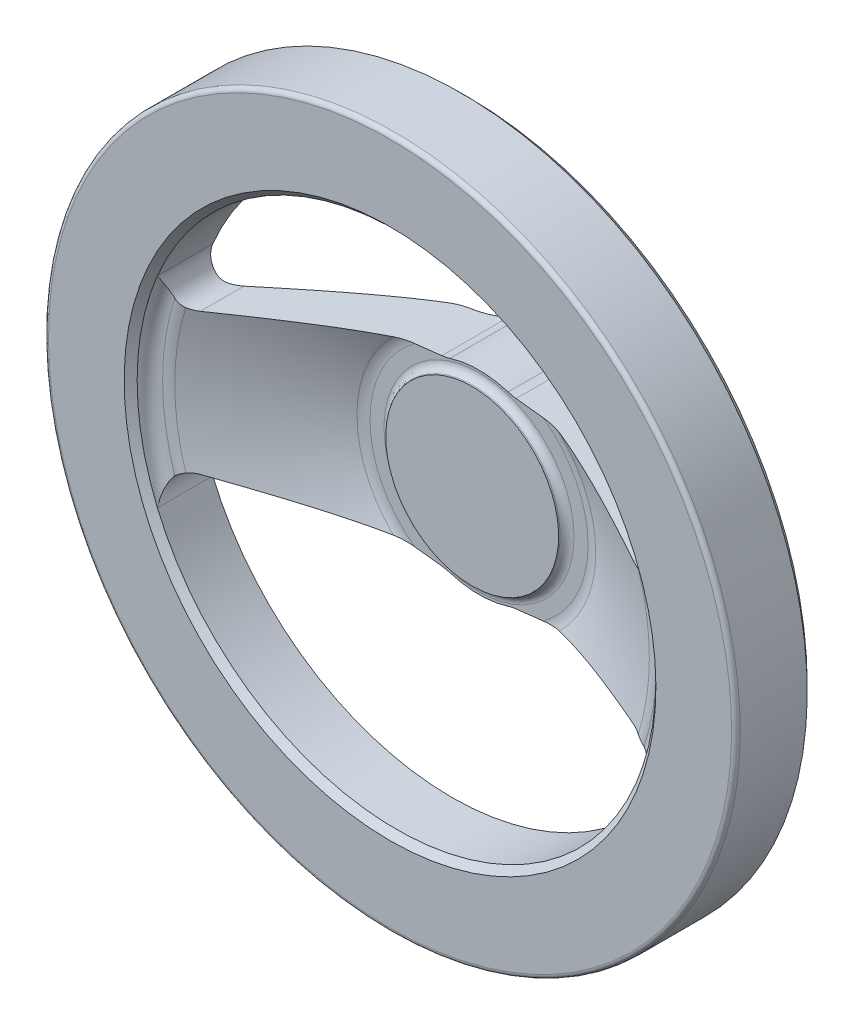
ISO-10303-21;
HEADER;
FILE_DESCRIPTION(('STEP AP214'),'2;1');
FILE_NAME('part.step','',(''),(''),'','','');
FILE_SCHEMA(('AUTOMOTIVE_DESIGN { 1 0 10303 214 1 1 1 1 }'));
ENDSEC;
DATA;
#1=APPLICATION_CONTEXT('core data for automotive mechanical design processes');
#2=APPLICATION_PROTOCOL_DEFINITION('international standard','automotive_design',2000,#1);
#3=PRODUCT_CONTEXT('',#1,'mechanical');
#4=PRODUCT('Part','Part','',(#3));
#5=PRODUCT_RELATED_PRODUCT_CATEGORY('part','',(#4));
#6=PRODUCT_DEFINITION_FORMATION('','',#4);
#7=PRODUCT_DEFINITION_CONTEXT('part definition',#1,'design');
#8=PRODUCT_DEFINITION('design','',#6,#7);
#9=PRODUCT_DEFINITION_SHAPE('','',#8);
#10=(LENGTH_UNIT() NAMED_UNIT(*) SI_UNIT(.MILLI.,.METRE.));
#11=(NAMED_UNIT(*) PLANE_ANGLE_UNIT() SI_UNIT($,.RADIAN.));
#12=(NAMED_UNIT(*) SI_UNIT($,.STERADIAN.) SOLID_ANGLE_UNIT());
#13=UNCERTAINTY_MEASURE_WITH_UNIT(LENGTH_MEASURE(1.E-05),#10,'distance_accuracy_value','');
#14=(GEOMETRIC_REPRESENTATION_CONTEXT(3) GLOBAL_UNCERTAINTY_ASSIGNED_CONTEXT((#13)) GLOBAL_UNIT_ASSIGNED_CONTEXT((#10,
#11,#12)) REPRESENTATION_CONTEXT('',''));
#15=CARTESIAN_POINT('',(0.,0.,0.));
#16=DIRECTION('',(0.,0.,1.));
#17=DIRECTION('',(1.,0.,0.));
#18=AXIS2_PLACEMENT_3D('',#15,#16,#17);
#19=CARTESIAN_POINT('',(0.,0.,21.829634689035));
#20=DIRECTION('',(0.,0.,-1.));
#21=DIRECTION('',(0.,-1.,0.));
#22=AXIS2_PLACEMENT_3D('',#19,#20,#21);
#23=TOROIDAL_SURFACE('',#22,24.9629876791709,5.00000000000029);
#24=CARTESIAN_POINT('',(-19.4327877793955,-19.8404974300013,17.6932115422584));
#25=CARTESIAN_POINT('',(-19.2942455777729,-19.8562865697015,17.6350509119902));
#26=CARTESIAN_POINT('',(-19.154225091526,-19.872244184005,17.5805806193));
#27=CARTESIAN_POINT('',(-18.8717748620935,-19.904433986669,17.4785768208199));
#28=CARTESIAN_POINT('',(-18.7293461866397,-19.9206660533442,17.4310403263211));
#29=CARTESIAN_POINT('',(-18.2996924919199,-19.9696320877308,17.2982832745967));
#30=CARTESIAN_POINT('',(-18.0095103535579,-20.0027030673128,17.2226734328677));
#31=CARTESIAN_POINT('',(-17.4275078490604,-20.0690317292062,17.0945050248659));
#32=CARTESIAN_POINT('',(-17.1357367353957,-20.1022837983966,17.0417125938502));
#33=CARTESIAN_POINT('',(-16.5493793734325,-20.1691087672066,16.9550776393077));
#34=CARTESIAN_POINT('',(-16.2547923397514,-20.2026817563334,16.9212405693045));
#35=CARTESIAN_POINT('',(-15.8061737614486,-20.2538091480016,16.8822546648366));
#36=CARTESIAN_POINT('',(-15.6526170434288,-20.2713094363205,16.8711333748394));
#37=CARTESIAN_POINT('',(-15.3448312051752,-20.3063866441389,16.852944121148));
#38=CARTESIAN_POINT('',(-15.1906014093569,-20.3239636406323,16.8458876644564));
#39=CARTESIAN_POINT('',(-15.0363074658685,-20.3415479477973,16.8407123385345));
#40=B_SPLINE_CURVE_WITH_KNOTS('',3,(#24,#25,#26,#27,#28,#29,#30,#31,#32,#33,#34,#35,#36,#37,#38,
#39),.UNSPECIFIED.,.F.,.F.,(4,2,2,2,2,2,2,4),(0.,0.453117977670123,0.906040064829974,
1.80996987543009,2.70440158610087,3.59909049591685,4.06389763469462,4.53001419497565),.UNSPECIFIED.);
#41=CARTESIAN_POINT('',(-19.432311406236,-19.8405517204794,17.6930115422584));
#42=VERTEX_POINT('',#41);
#43=CARTESIAN_POINT('',(-15.0422455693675,-20.3408712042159,16.840912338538));
#44=VERTEX_POINT('',#43);
#45=EDGE_CURVE('E290',#42,#44,#40,.T.);
#46=ORIENTED_EDGE('',*,*,#45,.F.);
#47=CARTESIAN_POINT('',(0.,0.,17.6930115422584));
#48=DIRECTION('',(0.,0.,-1.));
#49=DIRECTION('',(0.,-1.,0.));
#50=AXIS2_PLACEMENT_3D('',#47,#48,#49);
#51=CIRCLE('',#50,27.7716081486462);
#52=CARTESIAN_POINT('',(-19.432311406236,19.8405517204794,17.6930115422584));
#53=VERTEX_POINT('',#52);
#54=EDGE_CURVE('E289',#42,#53,#51,.T.);
#55=ORIENTED_EDGE('',*,*,#54,.T.);
#56=CARTESIAN_POINT('',(-19.4327877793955,19.8404974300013,17.6932115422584));
#57=CARTESIAN_POINT('',(-19.2942455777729,19.8562865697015,17.6350509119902));
#58=CARTESIAN_POINT('',(-19.154225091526,19.872244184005,17.5805806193));
#59=CARTESIAN_POINT('',(-18.8717748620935,19.904433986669,17.4785768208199));
#60=CARTESIAN_POINT('',(-18.7293461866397,19.9206660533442,17.4310403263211));
#61=CARTESIAN_POINT('',(-18.2996924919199,19.9696320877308,17.2982832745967));
#62=CARTESIAN_POINT('',(-18.0095103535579,20.0027030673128,17.2226734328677));
#63=CARTESIAN_POINT('',(-17.4275078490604,20.0690317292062,17.0945050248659));
#64=CARTESIAN_POINT('',(-17.1357367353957,20.1022837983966,17.0417125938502));
#65=CARTESIAN_POINT('',(-16.5493793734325,20.1691087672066,16.9550776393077));
#66=CARTESIAN_POINT('',(-16.2547923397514,20.2026817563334,16.9212405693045));
#67=CARTESIAN_POINT('',(-15.8061737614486,20.2538091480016,16.8822546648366));
#68=CARTESIAN_POINT('',(-15.6526170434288,20.2713094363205,16.8711333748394));
#69=CARTESIAN_POINT('',(-15.3448312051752,20.3063866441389,16.852944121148));
#70=CARTESIAN_POINT('',(-15.1906014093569,20.3239636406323,16.8458876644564));
#71=CARTESIAN_POINT('',(-15.0363074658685,20.3415479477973,16.8407123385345));
#72=B_SPLINE_CURVE_WITH_KNOTS('',3,(#56,#57,#58,#59,#60,#61,#62,#63,#64,#65,#66,#67,#68,#69,#70,
#71),.UNSPECIFIED.,.F.,.F.,(4,2,2,2,2,2,2,4),(0.,0.453117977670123,0.906040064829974,
1.80996987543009,2.70440158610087,3.59909049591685,4.06389763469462,4.53001419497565),.UNSPECIFIED.);
#73=CARTESIAN_POINT('',(-15.042245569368,20.3408712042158,16.8409123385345));
#74=VERTEX_POINT('',#73);
#75=EDGE_CURVE('E438',#53,#74,#72,.T.);
#76=ORIENTED_EDGE('',*,*,#75,.T.);
#77=CARTESIAN_POINT('',(0.,0.,16.8409123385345));
#78=DIRECTION('',(0.,0.,-1.));
#79=DIRECTION('',(0.,-1.,0.));
#80=AXIS2_PLACEMENT_3D('',#77,#78,#79);
#81=CIRCLE('',#80,25.29862037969);
#82=EDGE_CURVE('E789',#44,#74,#81,.T.);
#83=ORIENTED_EDGE('',*,*,#82,.F.);
#84=EDGE_LOOP('',(#46,#55,#76,#83));
#85=FACE_BOUND('',#84,.T.);
#86=ADVANCED_FACE('F14',(#85),#23,.T.);
#87=CARTESIAN_POINT('',(0.,0.,13.84767892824));
#88=DIRECTION('',(0.,0.,-1.));
#89=DIRECTION('',(0.,-1.,0.));
#90=AXIS2_PLACEMENT_3D('',#87,#88,#89);
#91=TOROIDAL_SURFACE('',#90,25.5000000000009,2.99999999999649);
#92=CARTESIAN_POINT('',(-7.62231417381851,-21.2347918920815,14.4514484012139));
#93=CARTESIAN_POINT('',(-7.70157602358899,-21.2177757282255,14.503827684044));
#94=CARTESIAN_POINT('',(-7.78116034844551,-21.2016968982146,14.5560253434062));
#95=CARTESIAN_POINT('',(-7.94095366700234,-21.1714412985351,14.6599274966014));
#96=CARTESIAN_POINT('',(-8.02116234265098,-21.1572636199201,14.7116322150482));
#97=CARTESIAN_POINT('',(-8.18226165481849,-21.1308210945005,14.8144700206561));
#98=CARTESIAN_POINT('',(-8.26315230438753,-21.1185562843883,14.8656030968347));
#99=CARTESIAN_POINT('',(-8.42567067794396,-21.0959622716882,14.9672082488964));
#100=CARTESIAN_POINT('',(-8.50729873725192,-21.0856340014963,15.0176799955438));
#101=CARTESIAN_POINT('',(-8.58928498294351,-21.0762911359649,15.0677522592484));
#102=B_SPLINE_CURVE_WITH_KNOTS('',3,(#92,#93,#94,#95,#96,#97,#98,#99,#100,#101),.UNSPECIFIED.,
.F.,.F.,(4,2,2,2,4),(0.,0.289547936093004,0.578956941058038,0.868371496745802,1.15792504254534),.UNSPECIFIED.);
#103=CARTESIAN_POINT('',(-7.62261681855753,-21.234726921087,14.4516484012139));
#104=VERTEX_POINT('',#103);
#105=CARTESIAN_POINT('',(-8.589084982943,-21.0763139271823,15.067630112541));
#106=VERTEX_POINT('',#105);
#107=EDGE_CURVE('E910',#104,#106,#102,.T.);
#108=ORIENTED_EDGE('',*,*,#107,.T.);
#109=CARTESIAN_POINT('',(-8.5888849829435,-21.0763367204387,15.0675079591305));
#110=CARTESIAN_POINT('',(-8.65868202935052,-21.0683822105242,15.1101016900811));
#111=CARTESIAN_POINT('',(-8.72930939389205,-21.0603330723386,15.1512815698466));
#112=CARTESIAN_POINT('',(-8.87190594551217,-21.0440818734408,15.2311669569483));
#113=CARTESIAN_POINT('',(-8.94387470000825,-21.0358798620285,15.2698732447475));
#114=CARTESIAN_POINT('',(-9.08880870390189,-21.0193622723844,15.3451543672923));
#115=CARTESIAN_POINT('',(-9.16177290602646,-21.0110468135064,15.3817312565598));
#116=CARTESIAN_POINT('',(-9.30859326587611,-20.9943142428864,15.4530366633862));
#117=CARTESIAN_POINT('',(-9.38244950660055,-20.9858971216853,15.4877650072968));
#118=CARTESIAN_POINT('',(-9.6048550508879,-20.9605503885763,15.5893389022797));
#119=CARTESIAN_POINT('',(-9.75452040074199,-20.9434935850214,15.6537161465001));
#120=CARTESIAN_POINT('',(-10.0561414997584,-20.909118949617,15.7768730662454));
#121=CARTESIAN_POINT('',(-10.2080979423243,-20.8918010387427,15.8356510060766));
#122=CARTESIAN_POINT('',(-10.5116305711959,-20.8572085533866,15.9473190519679));
#123=CARTESIAN_POINT('',(-10.6631802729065,-20.8399369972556,16.0002822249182));
#124=CARTESIAN_POINT('',(-10.9677815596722,-20.805222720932,16.1015637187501));
#125=CARTESIAN_POINT('',(-11.1208329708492,-20.7877800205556,16.1498825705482));
#126=CARTESIAN_POINT('',(-11.4283647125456,-20.7527317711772,16.2420370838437));
#127=CARTESIAN_POINT('',(-11.5828458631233,-20.7351261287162,16.2858699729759));
#128=CARTESIAN_POINT('',(-11.8929991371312,-20.6997791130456,16.3690285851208));
#129=CARTESIAN_POINT('',(-12.048671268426,-20.6820377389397,16.4083542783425));
#130=CARTESIAN_POINT('',(-12.436881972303,-20.6377948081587,16.5003974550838));
#131=CARTESIAN_POINT('',(-12.6700734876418,-20.6112188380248,16.550356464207));
#132=CARTESIAN_POINT('',(-13.1383281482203,-20.5578535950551,16.6396178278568));
#133=CARTESIAN_POINT('',(-13.3733901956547,-20.5310644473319,16.6789260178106));
#134=CARTESIAN_POINT('',(-13.8477088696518,-20.4770081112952,16.746450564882));
#135=CARTESIAN_POINT('',(-14.0869833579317,-20.4497388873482,16.7745422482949));
#136=CARTESIAN_POINT('',(-14.4468086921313,-20.4087309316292,16.8070256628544));
#137=CARTESIAN_POINT('',(-14.5669408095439,-20.3950399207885,16.816245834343));
#138=CARTESIAN_POINT('',(-14.8074252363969,-20.3676328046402,16.8312799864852));
#139=CARTESIAN_POINT('',(-14.927777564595,-20.3539166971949,16.8370936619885));
#140=CARTESIAN_POINT('',(-15.048199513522,-20.3401926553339,16.8411123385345));
#141=B_SPLINE_CURVE_WITH_KNOTS('',3,(#109,#110,#111,#112,#113,#114,#115,#116,#117,#118,#119,
#120,#121,#122,#123,#124,#125,#126,#127,#128,#129,#130,#131,#132,#133,#134,#135,#136,#137,#138,
#139,#140),.UNSPECIFIED.,.F.,.F.,(4,2,2,2,2,2,2,2,2,2,2,2,2,2,2,4),(0.,0.246416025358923,
0.492753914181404,0.738850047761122,0.984969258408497,1.47626285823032,1.96770825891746,
2.45202166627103,2.93627964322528,3.4208351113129,3.90539378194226,4.62502420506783,
5.34425955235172,6.07128052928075,6.43502076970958,6.79879358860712),.UNSPECIFIED.);
#142=EDGE_CURVE('E293',#106,#44,#141,.T.);
#143=ORIENTED_EDGE('',*,*,#142,.T.);
#144=ORIENTED_EDGE('',*,*,#82,.T.);
#145=CARTESIAN_POINT('',(-8.5888849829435,21.0763367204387,15.0675079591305));
#146=CARTESIAN_POINT('',(-8.65868202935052,21.0683822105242,15.1101016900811));
#147=CARTESIAN_POINT('',(-8.72930939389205,21.0603330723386,15.1512815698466));
#148=CARTESIAN_POINT('',(-8.87190594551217,21.0440818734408,15.2311669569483));
#149=CARTESIAN_POINT('',(-8.94387470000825,21.0358798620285,15.2698732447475));
#150=CARTESIAN_POINT('',(-9.08880870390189,21.0193622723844,15.3451543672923));
#151=CARTESIAN_POINT('',(-9.16177290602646,21.0110468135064,15.3817312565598));
#152=CARTESIAN_POINT('',(-9.30859326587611,20.9943142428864,15.4530366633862));
#153=CARTESIAN_POINT('',(-9.38244950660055,20.9858971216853,15.4877650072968));
#154=CARTESIAN_POINT('',(-9.6048550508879,20.9605503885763,15.5893389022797));
#155=CARTESIAN_POINT('',(-9.75452040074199,20.9434935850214,15.6537161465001));
#156=CARTESIAN_POINT('',(-10.0561414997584,20.909118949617,15.7768730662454));
#157=CARTESIAN_POINT('',(-10.2080979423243,20.8918010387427,15.8356510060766));
#158=CARTESIAN_POINT('',(-10.5116305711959,20.8572085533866,15.9473190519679));
#159=CARTESIAN_POINT('',(-10.6631802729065,20.8399369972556,16.0002822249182));
#160=CARTESIAN_POINT('',(-10.9677815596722,20.805222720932,16.1015637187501));
#161=CARTESIAN_POINT('',(-11.1208329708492,20.7877800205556,16.1498825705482));
#162=CARTESIAN_POINT('',(-11.4283647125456,20.7527317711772,16.2420370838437));
#163=CARTESIAN_POINT('',(-11.5828458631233,20.7351261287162,16.2858699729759));
#164=CARTESIAN_POINT('',(-11.8929991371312,20.6997791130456,16.3690285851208));
#165=CARTESIAN_POINT('',(-12.048671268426,20.6820377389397,16.4083542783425));
#166=CARTESIAN_POINT('',(-12.436881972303,20.6377948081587,16.5003974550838));
#167=CARTESIAN_POINT('',(-12.6700734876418,20.6112188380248,16.550356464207));
#168=CARTESIAN_POINT('',(-13.1383281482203,20.5578535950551,16.6396178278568));
#169=CARTESIAN_POINT('',(-13.3733901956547,20.5310644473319,16.6789260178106));
#170=CARTESIAN_POINT('',(-13.8477088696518,20.4770081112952,16.746450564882));
#171=CARTESIAN_POINT('',(-14.0869833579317,20.4497388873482,16.7745422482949));
#172=CARTESIAN_POINT('',(-14.4468086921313,20.4087309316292,16.8070256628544));
#173=CARTESIAN_POINT('',(-14.5669408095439,20.3950399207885,16.816245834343));
#174=CARTESIAN_POINT('',(-14.8074252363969,20.3676328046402,16.8312799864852));
#175=CARTESIAN_POINT('',(-14.927777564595,20.3539166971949,16.8370936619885));
#176=CARTESIAN_POINT('',(-15.048199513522,20.3401926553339,16.8411123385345));
#177=B_SPLINE_CURVE_WITH_KNOTS('',3,(#145,#146,#147,#148,#149,#150,#151,#152,#153,#154,#155,
#156,#157,#158,#159,#160,#161,#162,#163,#164,#165,#166,#167,#168,#169,#170,#171,#172,#173,#174,
#175,#176),.UNSPECIFIED.,.F.,.F.,(4,2,2,2,2,2,2,2,2,2,2,2,2,2,2,4),(0.,0.246416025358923,
0.492753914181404,0.738850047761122,0.984969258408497,1.47626285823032,1.96770825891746,
2.45202166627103,2.93627964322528,3.4208351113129,3.90539378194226,4.62502420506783,
5.34425955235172,6.07128052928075,6.43502076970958,6.79879358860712),.UNSPECIFIED.);
#178=CARTESIAN_POINT('',(-8.589084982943,21.0763139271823,15.067630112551));
#179=VERTEX_POINT('',#178);
#180=EDGE_CURVE('E985',#179,#74,#177,.T.);
#181=ORIENTED_EDGE('',*,*,#180,.F.);
#182=CARTESIAN_POINT('',(-7.62231417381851,21.2347918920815,14.4514484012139));
#183=CARTESIAN_POINT('',(-7.70157602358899,21.2177757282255,14.503827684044));
#184=CARTESIAN_POINT('',(-7.78116034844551,21.2016968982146,14.5560253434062));
#185=CARTESIAN_POINT('',(-7.94095366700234,21.1714412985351,14.6599274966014));
#186=CARTESIAN_POINT('',(-8.02116234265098,21.1572636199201,14.7116322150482));
#187=CARTESIAN_POINT('',(-8.18226165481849,21.1308210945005,14.8144700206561));
#188=CARTESIAN_POINT('',(-8.26315230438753,21.1185562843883,14.8656030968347));
#189=CARTESIAN_POINT('',(-8.42567067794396,21.0959622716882,14.9672082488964));
#190=CARTESIAN_POINT('',(-8.50729873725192,21.0856340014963,15.0176799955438));
#191=CARTESIAN_POINT('',(-8.58928498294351,21.0762911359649,15.0677522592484));
#192=B_SPLINE_CURVE_WITH_KNOTS('',3,(#182,#183,#184,#185,#186,#187,#188,#189,#190,#191),
.UNSPECIFIED.,.F.,.F.,(4,2,2,2,4),(0.,0.289547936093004,0.578956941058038,0.868371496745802,
1.15792504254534),.UNSPECIFIED.);
#193=CARTESIAN_POINT('',(-7.62261681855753,21.234726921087,14.4516484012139));
#194=VERTEX_POINT('',#193);
#195=EDGE_CURVE('E1009',#194,#179,#192,.T.);
#196=ORIENTED_EDGE('',*,*,#195,.F.);
#197=CARTESIAN_POINT('',(0.,0.,14.4516484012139));
#198=DIRECTION('',(0.,0.,-1.));
#199=DIRECTION('',(0.,-1.,0.));
#200=AXIS2_PLACEMENT_3D('',#197,#198,#199);
#201=CIRCLE('',#200,22.5614253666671);
#202=EDGE_CURVE('E785',#104,#194,#201,.T.);
#203=ORIENTED_EDGE('',*,*,#202,.F.);
#204=EDGE_LOOP('',(#108,#143,#144,#181,#196,#203));
#205=FACE_BOUND('',#204,.T.);
#206=ADVANCED_FACE('F433',(#205),#91,.F.);
#207=CARTESIAN_POINT('',(8.58888498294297,-21.0763367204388,15.0675079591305));
#208=CARTESIAN_POINT('',(8.65868202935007,-21.0683822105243,15.110101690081));
#209=CARTESIAN_POINT('',(8.72930939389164,-21.0603330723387,15.1512815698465));
#210=CARTESIAN_POINT('',(8.87190594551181,-21.0440818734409,15.2311669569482));
#211=CARTESIAN_POINT('',(8.94387470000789,-21.0358798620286,15.2698732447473));
#212=CARTESIAN_POINT('',(9.08880870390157,-21.0193622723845,15.3451543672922));
#213=CARTESIAN_POINT('',(9.16177290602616,-21.0110468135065,15.3817312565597));
#214=CARTESIAN_POINT('',(9.30859326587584,-20.9943142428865,15.4530366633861));
#215=CARTESIAN_POINT('',(9.38244950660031,-20.9858971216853,15.4877650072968));
#216=CARTESIAN_POINT('',(9.60485505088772,-20.9605503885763,15.5893389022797));
#217=CARTESIAN_POINT('',(9.75452040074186,-20.9434935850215,15.6537161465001));
#218=CARTESIAN_POINT('',(10.0561414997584,-20.909118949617,15.7768730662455));
#219=CARTESIAN_POINT('',(10.2080979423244,-20.8918010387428,15.8356510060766));
#220=CARTESIAN_POINT('',(10.511630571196,-20.8572085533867,15.9473190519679));
#221=CARTESIAN_POINT('',(10.6631802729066,-20.8399369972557,16.0002822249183));
#222=CARTESIAN_POINT('',(10.9677815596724,-20.805222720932,16.1015637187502));
#223=CARTESIAN_POINT('',(11.1208329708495,-20.7877800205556,16.1498825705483));
#224=CARTESIAN_POINT('',(11.428364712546,-20.7527317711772,16.2420370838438));
#225=CARTESIAN_POINT('',(11.5828458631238,-20.7351261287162,16.285869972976));
#226=CARTESIAN_POINT('',(11.8929991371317,-20.6997791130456,16.369028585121));
#227=CARTESIAN_POINT('',(12.0486712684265,-20.6820377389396,16.4083542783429));
#228=CARTESIAN_POINT('',(12.4368819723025,-20.6377948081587,16.5003974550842));
#229=CARTESIAN_POINT('',(12.6700734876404,-20.611218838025,16.5503564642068));
#230=CARTESIAN_POINT('',(13.1383281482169,-20.5578535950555,16.6396178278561));
#231=CARTESIAN_POINT('',(13.3733901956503,-20.5310644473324,16.6789260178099));
#232=CARTESIAN_POINT('',(13.8477088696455,-20.477008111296,16.7464505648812));
#233=CARTESIAN_POINT('',(14.0869833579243,-20.4497388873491,16.7745422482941));
#234=CARTESIAN_POINT('',(14.4468086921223,-20.4087309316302,16.8070256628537));
#235=CARTESIAN_POINT('',(14.5669408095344,-20.3950399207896,16.8162458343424));
#236=CARTESIAN_POINT('',(14.8074252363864,-20.3676328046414,16.8312799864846));
#237=CARTESIAN_POINT('',(14.927777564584,-20.3539166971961,16.837093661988));
#238=CARTESIAN_POINT('',(15.0481995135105,-20.3401926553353,16.841112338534));
#239=B_SPLINE_CURVE_WITH_KNOTS('',3,(#207,#208,#209,#210,#211,#212,#213,#214,#215,#216,#217,
#218,#219,#220,#221,#222,#223,#224,#225,#226,#227,#228,#229,#230,#231,#232,#233,#234,#235,#236,
#237,#238),.UNSPECIFIED.,.F.,.F.,(4,2,2,2,2,2,2,2,2,2,2,2,2,2,2,4),(0.,0.246416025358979,
0.492753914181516,0.738850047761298,0.984969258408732,1.47626285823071,1.96770825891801,
2.45202166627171,2.93627964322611,3.42083511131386,3.90539378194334,4.62502420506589,
5.34425955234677,6.0712805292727,6.43502076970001,6.79879358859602),.UNSPECIFIED.);
#240=CARTESIAN_POINT('',(8.58908498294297,-21.0763139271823,15.067630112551));
#241=VERTEX_POINT('',#240);
#242=CARTESIAN_POINT('',(15.0422455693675,-20.3408712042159,16.840912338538));
#243=VERTEX_POINT('',#242);
#244=EDGE_CURVE('E340',#241,#243,#239,.T.);
#245=ORIENTED_EDGE('',*,*,#244,.F.);
#246=CARTESIAN_POINT('',(8.58928498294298,-21.0762911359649,15.0677522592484));
#247=CARTESIAN_POINT('',(8.50729873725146,-21.0856340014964,15.0176799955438));
#248=CARTESIAN_POINT('',(8.42567067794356,-21.0959622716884,14.9672082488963));
#249=CARTESIAN_POINT('',(8.26315230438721,-21.1185562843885,14.8656030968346));
#250=CARTESIAN_POINT('',(8.1822616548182,-21.1308210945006,14.8144700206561));
#251=CARTESIAN_POINT('',(8.02116234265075,-21.1572636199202,14.7116322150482));
#252=CARTESIAN_POINT('',(7.94095366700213,-21.1714412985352,14.6599274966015));
#253=CARTESIAN_POINT('',(7.78116034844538,-21.2016968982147,14.5560253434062));
#254=CARTESIAN_POINT('',(7.70157602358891,-21.2177757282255,14.503827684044));
#255=CARTESIAN_POINT('',(7.62231417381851,-21.2347918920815,14.4514484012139));
#256=B_SPLINE_CURVE_WITH_KNOTS('',3,(#246,#247,#248,#249,#250,#251,#252,#253,#254,#255),
.UNSPECIFIED.,.F.,.F.,(4,2,2,2,4),(0.,0.289553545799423,0.578968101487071,0.868377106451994,
1.15792504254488),.UNSPECIFIED.);
#257=CARTESIAN_POINT('',(7.622616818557,-21.234726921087,14.4516484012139));
#258=VERTEX_POINT('',#257);
#259=EDGE_CURVE('E888',#241,#258,#256,.T.);
#260=ORIENTED_EDGE('',*,*,#259,.T.);
#261=CARTESIAN_POINT('',(7.622616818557,21.234726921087,14.4516484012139));
#262=VERTEX_POINT('',#261);
#263=EDGE_CURVE('E786',#262,#258,#201,.T.);
#264=ORIENTED_EDGE('',*,*,#263,.F.);
#265=CARTESIAN_POINT('',(8.58928498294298,21.0762911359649,15.0677522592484));
#266=CARTESIAN_POINT('',(8.50729873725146,21.0856340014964,15.0176799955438));
#267=CARTESIAN_POINT('',(8.42567067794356,21.0959622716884,14.9672082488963));
#268=CARTESIAN_POINT('',(8.26315230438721,21.1185562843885,14.8656030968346));
#269=CARTESIAN_POINT('',(8.1822616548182,21.1308210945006,14.8144700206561));
#270=CARTESIAN_POINT('',(8.02116234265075,21.1572636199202,14.7116322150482));
#271=CARTESIAN_POINT('',(7.94095366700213,21.1714412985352,14.6599274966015));
#272=CARTESIAN_POINT('',(7.78116034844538,21.2016968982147,14.5560253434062));
#273=CARTESIAN_POINT('',(7.70157602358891,21.2177757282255,14.503827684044));
#274=CARTESIAN_POINT('',(7.62231417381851,21.2347918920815,14.4514484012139));
#275=B_SPLINE_CURVE_WITH_KNOTS('',3,(#265,#266,#267,#268,#269,#270,#271,#272,#273,#274),
.UNSPECIFIED.,.F.,.F.,(4,2,2,2,4),(0.,0.289553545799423,0.578968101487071,0.868377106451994,
1.15792504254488),.UNSPECIFIED.);
#276=CARTESIAN_POINT('',(8.58908498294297,21.0763139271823,15.067630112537));
#277=VERTEX_POINT('',#276);
#278=EDGE_CURVE('E838',#277,#262,#275,.T.);
#279=ORIENTED_EDGE('',*,*,#278,.F.);
#280=CARTESIAN_POINT('',(8.58888498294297,21.0763367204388,15.0675079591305));
#281=CARTESIAN_POINT('',(8.65868202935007,21.0683822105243,15.110101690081));
#282=CARTESIAN_POINT('',(8.72930939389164,21.0603330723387,15.1512815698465));
#283=CARTESIAN_POINT('',(8.87190594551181,21.0440818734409,15.2311669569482));
#284=CARTESIAN_POINT('',(8.94387470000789,21.0358798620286,15.2698732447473));
#285=CARTESIAN_POINT('',(9.08880870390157,21.0193622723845,15.3451543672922));
#286=CARTESIAN_POINT('',(9.16177290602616,21.0110468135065,15.3817312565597));
#287=CARTESIAN_POINT('',(9.30859326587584,20.9943142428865,15.4530366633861));
#288=CARTESIAN_POINT('',(9.38244950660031,20.9858971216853,15.4877650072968));
#289=CARTESIAN_POINT('',(9.60485505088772,20.9605503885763,15.5893389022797));
#290=CARTESIAN_POINT('',(9.75452040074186,20.9434935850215,15.6537161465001));
#291=CARTESIAN_POINT('',(10.0561414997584,20.909118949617,15.7768730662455));
#292=CARTESIAN_POINT('',(10.2080979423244,20.8918010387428,15.8356510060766));
#293=CARTESIAN_POINT('',(10.511630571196,20.8572085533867,15.9473190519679));
#294=CARTESIAN_POINT('',(10.6631802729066,20.8399369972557,16.0002822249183));
#295=CARTESIAN_POINT('',(10.9677815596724,20.805222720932,16.1015637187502));
#296=CARTESIAN_POINT('',(11.1208329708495,20.7877800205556,16.1498825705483));
#297=CARTESIAN_POINT('',(11.428364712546,20.7527317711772,16.2420370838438));
#298=CARTESIAN_POINT('',(11.5828458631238,20.7351261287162,16.285869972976));
#299=CARTESIAN_POINT('',(11.8929991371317,20.6997791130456,16.369028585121));
#300=CARTESIAN_POINT('',(12.0486712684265,20.6820377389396,16.4083542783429));
#301=CARTESIAN_POINT('',(12.4368819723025,20.6377948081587,16.5003974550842));
#302=CARTESIAN_POINT('',(12.6700734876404,20.611218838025,16.5503564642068));
#303=CARTESIAN_POINT('',(13.1383281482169,20.5578535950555,16.6396178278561));
#304=CARTESIAN_POINT('',(13.3733901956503,20.5310644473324,16.6789260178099));
#305=CARTESIAN_POINT('',(13.8477088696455,20.477008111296,16.7464505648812));
#306=CARTESIAN_POINT('',(14.0869833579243,20.4497388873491,16.7745422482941));
#307=CARTESIAN_POINT('',(14.4468086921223,20.4087309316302,16.8070256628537));
#308=CARTESIAN_POINT('',(14.5669408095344,20.3950399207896,16.8162458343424));
#309=CARTESIAN_POINT('',(14.8074252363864,20.3676328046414,16.8312799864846));
#310=CARTESIAN_POINT('',(14.927777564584,20.3539166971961,16.837093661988));
#311=CARTESIAN_POINT('',(15.0481995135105,20.3401926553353,16.841112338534));
#312=B_SPLINE_CURVE_WITH_KNOTS('',3,(#280,#281,#282,#283,#284,#285,#286,#287,#288,#289,#290,
#291,#292,#293,#294,#295,#296,#297,#298,#299,#300,#301,#302,#303,#304,#305,#306,#307,#308,#309,
#310,#311),.UNSPECIFIED.,.F.,.F.,(4,2,2,2,2,2,2,2,2,2,2,2,2,2,2,4),(0.,0.246416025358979,
0.492753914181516,0.738850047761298,0.984969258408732,1.47626285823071,1.96770825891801,
2.45202166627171,2.93627964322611,3.42083511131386,3.90539378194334,4.62502420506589,
5.34425955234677,6.0712805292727,6.43502076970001,6.79879358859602),.UNSPECIFIED.);
#313=CARTESIAN_POINT('',(15.0422455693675,20.3408712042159,16.8409123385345));
#314=VERTEX_POINT('',#313);
#315=EDGE_CURVE('E454',#277,#314,#312,.T.);
#316=ORIENTED_EDGE('',*,*,#315,.T.);
#317=EDGE_CURVE('E790',#314,#243,#81,.T.);
#318=ORIENTED_EDGE('',*,*,#317,.T.);
#319=EDGE_LOOP('',(#245,#260,#264,#279,#316,#318));
#320=FACE_BOUND('',#319,.T.);
#321=ADVANCED_FACE('F892',(#320),#91,.F.);
#322=CARTESIAN_POINT('',(25.2252640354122,0.,30.423968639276));
#323=DIRECTION('',(0.,0.,1.));
#324=DIRECTION('',(0.,1.,0.));
#325=AXIS2_PLACEMENT_3D('',#322,#323,#324);
#326=PLANE('',#325);
#327=CARTESIAN_POINT('',(0.,0.,30.423968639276));
#328=DIRECTION('',(0.,0.,-1.));
#329=DIRECTION('',(0.,-1.,0.));
#330=AXIS2_PLACEMENT_3D('',#327,#328,#329);
#331=CIRCLE('',#330,21.9723067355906);
#332=CARTESIAN_POINT('',(0.,-21.9723067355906,30.423968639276));
#333=VERTEX_POINT('',#332);
#334=EDGE_CURVE('E767',#333,#333,#331,.T.);
#335=ORIENTED_EDGE('',*,*,#334,.T.);
#336=EDGE_LOOP('',(#335));
#337=FACE_BOUND('',#336,.T.);
#338=CARTESIAN_POINT('',(0.,0.,30.423968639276));
#339=DIRECTION('',(0.,0.,-1.));
#340=DIRECTION('',(0.,-1.,0.));
#341=AXIS2_PLACEMENT_3D('',#338,#339,#340);
#342=CIRCLE('',#341,25.2252640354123);
#343=CARTESIAN_POINT('',(-14.8957521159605,-20.3575665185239,30.423968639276));
#344=VERTEX_POINT('',#343);
#345=CARTESIAN_POINT('',(-14.8957521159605,20.3575665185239,30.423968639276));
#346=VERTEX_POINT('',#345);
#347=EDGE_CURVE('E763',#344,#346,#342,.T.);
#348=ORIENTED_EDGE('',*,*,#347,.F.);
#349=DIRECTION('',(0.99356842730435,-0.113233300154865,0.));
#350=VECTOR('',#349,1.);
#351=CARTESIAN_POINT('',(22.4205125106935,-24.6103624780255,30.423968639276));
#352=LINE('',#351,#350);
#353=CARTESIAN_POINT('',(-8.589084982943,-21.0763139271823,30.423968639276));
#354=VERTEX_POINT('',#353);
#355=EDGE_CURVE('E291',#344,#354,#352,.T.);
#356=ORIENTED_EDGE('',*,*,#355,.T.);
#357=CARTESIAN_POINT('',(-9.72141798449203,-31.0119982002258,30.423968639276));
#358=DIRECTION('',(0.,0.,1.));
#359=DIRECTION('',(0.,1.,0.));
#360=AXIS2_PLACEMENT_3D('',#357,#358,#359);
#361=CIRCLE('',#360,10.);
#362=CARTESIAN_POINT('',(-6.73021245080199,-21.4698449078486,30.423968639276));
#363=VERTEX_POINT('',#362);
#364=EDGE_CURVE('E917',#354,#363,#361,.F.);
#365=ORIENTED_EDGE('',*,*,#364,.T.);
#366=CARTESIAN_POINT('',(0.,0.,30.423968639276));
#367=DIRECTION('',(0.,0.,1.));
#368=DIRECTION('',(0.,1.,0.));
#369=AXIS2_PLACEMENT_3D('',#366,#367,#368);
#370=CIRCLE('',#369,22.5);
#371=CARTESIAN_POINT('',(6.73021245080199,-21.4698449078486,30.423968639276));
#372=VERTEX_POINT('',#371);
#373=EDGE_CURVE('E897',#372,#363,#370,.F.);
#374=ORIENTED_EDGE('',*,*,#373,.F.);
#375=CARTESIAN_POINT('',(9.7214179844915,-31.0119982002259,30.423968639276));
#376=DIRECTION('',(0.,0.,1.));
#377=DIRECTION('',(0.,1.,0.));
#378=AXIS2_PLACEMENT_3D('',#375,#376,#377);
#379=CIRCLE('',#378,10.);
#380=CARTESIAN_POINT('',(8.58908498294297,-21.0763139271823,30.423968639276));
#381=VERTEX_POINT('',#380);
#382=EDGE_CURVE('E894',#372,#381,#379,.F.);
#383=ORIENTED_EDGE('',*,*,#382,.T.);
#384=DIRECTION('',(-0.993568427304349,-0.113233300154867,0.));
#385=VECTOR('',#384,1.);
#386=CARTESIAN_POINT('',(27.383149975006,-18.934424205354,30.423968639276));
#387=LINE('',#386,#385);
#388=CARTESIAN_POINT('',(14.8957521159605,-20.3575665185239,30.423968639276));
#389=VERTEX_POINT('',#388);
#390=EDGE_CURVE('E389',#389,#381,#387,.T.);
#391=ORIENTED_EDGE('',*,*,#390,.F.);
#392=CARTESIAN_POINT('',(14.8957521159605,20.3575665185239,30.423968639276));
#393=VERTEX_POINT('',#392);
#394=EDGE_CURVE('E764',#393,#389,#342,.T.);
#395=ORIENTED_EDGE('',*,*,#394,.F.);
#396=DIRECTION('',(-0.993568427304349,0.113233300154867,0.));
#397=VECTOR('',#396,1.);
#398=CARTESIAN_POINT('',(27.383149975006,18.934424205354,30.423968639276));
#399=LINE('',#398,#397);
#400=CARTESIAN_POINT('',(8.58908498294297,21.0763139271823,30.423968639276));
#401=VERTEX_POINT('',#400);
#402=EDGE_CURVE('E973',#393,#401,#399,.T.);
#403=ORIENTED_EDGE('',*,*,#402,.T.);
#404=CARTESIAN_POINT('',(9.7214179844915,31.0119982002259,30.423968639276));
#405=DIRECTION('',(0.,0.,1.));
#406=DIRECTION('',(0.,1.,0.));
#407=AXIS2_PLACEMENT_3D('',#404,#405,#406);
#408=CIRCLE('',#407,10.);
#409=CARTESIAN_POINT('',(6.73021245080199,21.4698449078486,30.423968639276));
#410=VERTEX_POINT('',#409);
#411=EDGE_CURVE('E502',#410,#401,#408,.T.);
#412=ORIENTED_EDGE('',*,*,#411,.F.);
#413=CARTESIAN_POINT('',(0.,0.,30.423968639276));
#414=DIRECTION('',(0.,0.,1.));
#415=DIRECTION('',(0.,1.,0.));
#416=AXIS2_PLACEMENT_3D('',#413,#414,#415);
#417=CIRCLE('',#416,22.5);
#418=CARTESIAN_POINT('',(-6.73021245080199,21.4698449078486,30.423968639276));
#419=VERTEX_POINT('',#418);
#420=EDGE_CURVE('E499',#410,#419,#417,.T.);
#421=ORIENTED_EDGE('',*,*,#420,.T.);
#422=CARTESIAN_POINT('',(-9.72141798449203,31.0119982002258,30.423968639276));
#423=DIRECTION('',(0.,0.,1.));
#424=DIRECTION('',(0.,1.,0.));
#425=AXIS2_PLACEMENT_3D('',#422,#423,#424);
#426=CIRCLE('',#425,10.);
#427=CARTESIAN_POINT('',(-8.589084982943,21.0763139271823,30.423968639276));
#428=VERTEX_POINT('',#427);
#429=EDGE_CURVE('E491',#428,#419,#426,.T.);
#430=ORIENTED_EDGE('',*,*,#429,.F.);
#431=DIRECTION('',(0.99356842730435,0.113233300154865,0.));
#432=VECTOR('',#431,1.);
#433=CARTESIAN_POINT('',(22.4205125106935,24.6103624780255,30.423968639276));
#434=LINE('',#433,#432);
#435=EDGE_CURVE('E656',#346,#428,#434,.T.);
#436=ORIENTED_EDGE('',*,*,#435,.F.);
#437=EDGE_LOOP('',(#348,#356,#365,#374,#383,#391,#395,#403,#412,#421,#430,#436));
#438=FACE_BOUND('',#437,.T.);
#439=ADVANCED_FACE('F358',(#337,#438),#326,.T.);
#440=CARTESIAN_POINT('',(0.,0.,35.423968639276));
#441=DIRECTION('',(0.,0.,-1.));
#442=DIRECTION('',(0.,-1.,0.));
#443=AXIS2_PLACEMENT_3D('',#440,#441,#442);
#444=TOROIDAL_SURFACE('',#443,25.2252640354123,5.);
#445=CARTESIAN_POINT('',(0.,0.,31.0342802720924));
#446=DIRECTION('',(0.,0.,-1.));
#447=DIRECTION('',(0.,-1.,0.));
#448=AXIS2_PLACEMENT_3D('',#445,#446,#447);
#449=CIRCLE('',#448,27.6191387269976);
#450=CARTESIAN_POINT('',(-19.184583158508,-19.8687843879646,31.0342802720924));
#451=VERTEX_POINT('',#450);
#452=CARTESIAN_POINT('',(-19.184583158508,19.8687843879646,31.0342802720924));
#453=VERTEX_POINT('',#452);
#454=EDGE_CURVE('E759',#451,#453,#449,.T.);
#455=ORIENTED_EDGE('',*,*,#454,.F.);
#456=CARTESIAN_POINT('',(-19.1851817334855,-19.8687161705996,31.0344802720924));
#457=CARTESIAN_POINT('',(-19.0272959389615,-19.8867098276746,30.9817324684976));
#458=CARTESIAN_POINT('',(-18.8680808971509,-19.9048549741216,30.9331350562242));
#459=CARTESIAN_POINT('',(-18.5475859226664,-19.9413805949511,30.8436918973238));
#460=CARTESIAN_POINT('',(-18.3863069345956,-19.9597609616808,30.8028427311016));
#461=CARTESIAN_POINT('',(-18.0624980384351,-19.9966642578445,30.7283842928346));
#462=CARTESIAN_POINT('',(-17.8999717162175,-20.0151867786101,30.6947590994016));
#463=CARTESIAN_POINT('',(-17.5736999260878,-20.0523707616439,30.6341070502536));
#464=CARTESIAN_POINT('',(-17.4099543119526,-20.0710322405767,30.6070809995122));
#465=CARTESIAN_POINT('',(-16.9212091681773,-20.1267327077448,30.5357070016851));
#466=CARTESIAN_POINT('',(-16.5949103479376,-20.1639197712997,30.5002206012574));
#467=CARTESIAN_POINT('',(-15.940702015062,-20.2384774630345,30.449559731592));
#468=CARTESIAN_POINT('',(-15.612791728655,-20.2758481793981,30.4343962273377));
#469=CARTESIAN_POINT('',(-14.7507493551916,-20.3740919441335,30.4171142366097));
#470=CARTESIAN_POINT('',(-14.2163447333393,-20.4349960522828,30.4291545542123));
#471=CARTESIAN_POINT('',(-13.1491459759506,-20.556620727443,30.4867337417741));
#472=CARTESIAN_POINT('',(-12.616353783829,-20.61734107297,30.5323035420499));
#473=CARTESIAN_POINT('',(-11.5425949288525,-20.7397133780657,30.6473241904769));
#474=CARTESIAN_POINT('',(-11.0016796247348,-20.8013594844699,30.7172373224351));
#475=CARTESIAN_POINT('',(-10.1924026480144,-20.8935897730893,30.8314249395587));
#476=CARTESIAN_POINT('',(-9.92334509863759,-20.9242532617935,30.8709824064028));
#477=CARTESIAN_POINT('',(-9.38552884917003,-20.9855461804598,30.9518030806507));
#478=CARTESIAN_POINT('',(-9.11677010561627,-21.0161756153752,30.9930659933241));
#479=CARTESIAN_POINT('',(-8.84803359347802,-21.0468025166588,31.034480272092));
#480=B_SPLINE_CURVE_WITH_KNOTS('',3,(#456,#457,#458,#459,#460,#461,#462,#463,#464,#465,#466,
#467,#468,#469,#470,#471,#472,#473,#474,#475,#476,#477,#478,#479),.UNSPECIFIED.,.F.,.F.,(4,2,2,
2,2,2,2,2,2,2,2,4),(0.,0.502188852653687,1.00415555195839,1.5050043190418,2.00591414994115,
2.99604190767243,3.98670366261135,5.59907765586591,7.21294090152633,8.85929296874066,
9.68031453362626,10.5011948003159),.UNSPECIFIED.);
#481=EDGE_CURVE('E296',#451,#344,#480,.T.);
#482=ORIENTED_EDGE('',*,*,#481,.T.);
#483=ORIENTED_EDGE('',*,*,#347,.T.);
#484=CARTESIAN_POINT('',(-19.1851817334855,19.8687161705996,31.0344802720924));
#485=CARTESIAN_POINT('',(-19.0272959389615,19.8867098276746,30.9817324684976));
#486=CARTESIAN_POINT('',(-18.8680808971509,19.9048549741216,30.9331350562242));
#487=CARTESIAN_POINT('',(-18.5475859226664,19.9413805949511,30.8436918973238));
#488=CARTESIAN_POINT('',(-18.3863069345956,19.9597609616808,30.8028427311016));
#489=CARTESIAN_POINT('',(-18.0624980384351,19.9966642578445,30.7283842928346));
#490=CARTESIAN_POINT('',(-17.8999717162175,20.0151867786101,30.6947590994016));
#491=CARTESIAN_POINT('',(-17.5736999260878,20.0523707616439,30.6341070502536));
#492=CARTESIAN_POINT('',(-17.4099543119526,20.0710322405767,30.6070809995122));
#493=CARTESIAN_POINT('',(-16.9212091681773,20.1267327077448,30.5357070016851));
#494=CARTESIAN_POINT('',(-16.5949103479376,20.1639197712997,30.5002206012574));
#495=CARTESIAN_POINT('',(-15.940702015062,20.2384774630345,30.449559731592));
#496=CARTESIAN_POINT('',(-15.612791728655,20.2758481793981,30.4343962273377));
#497=CARTESIAN_POINT('',(-14.7507493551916,20.3740919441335,30.4171142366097));
#498=CARTESIAN_POINT('',(-14.2163447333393,20.4349960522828,30.4291545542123));
#499=CARTESIAN_POINT('',(-13.1491459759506,20.556620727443,30.4867337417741));
#500=CARTESIAN_POINT('',(-12.616353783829,20.61734107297,30.5323035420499));
#501=CARTESIAN_POINT('',(-11.5425949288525,20.7397133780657,30.6473241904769));
#502=CARTESIAN_POINT('',(-11.0016796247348,20.8013594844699,30.7172373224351));
#503=CARTESIAN_POINT('',(-10.1924026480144,20.8935897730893,30.8314249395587));
#504=CARTESIAN_POINT('',(-9.92334509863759,20.9242532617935,30.8709824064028));
#505=CARTESIAN_POINT('',(-9.38552884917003,20.9855461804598,30.9518030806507));
#506=CARTESIAN_POINT('',(-9.11677010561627,21.0161756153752,30.9930659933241));
#507=CARTESIAN_POINT('',(-8.84803359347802,21.0468025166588,31.034480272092));
#508=B_SPLINE_CURVE_WITH_KNOTS('',3,(#484,#485,#486,#487,#488,#489,#490,#491,#492,#493,#494,
#495,#496,#497,#498,#499,#500,#501,#502,#503,#504,#505,#506,#507),.UNSPECIFIED.,.F.,.F.,(4,2,2,
2,2,2,2,2,2,2,2,4),(0.,0.502188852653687,1.00415555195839,1.5050043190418,2.00591414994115,
2.99604190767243,3.98670366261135,5.59907765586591,7.21294090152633,8.85929296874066,
9.68031453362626,10.5011948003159),.UNSPECIFIED.);
#509=EDGE_CURVE('E363',#453,#346,#508,.T.);
#510=ORIENTED_EDGE('',*,*,#509,.F.);
#511=EDGE_LOOP('',(#455,#482,#483,#510));
#512=FACE_BOUND('',#511,.T.);
#513=ADVANCED_FACE('F354',(#512),#444,.F.);
#514=CARTESIAN_POINT('',(0.,0.,31.8590888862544));
#515=DIRECTION('',(0.,0.,-1.));
#516=DIRECTION('',(0.,-1.,0.));
#517=AXIS2_PLACEMENT_3D('',#514,#515,#516);
#518=TOROIDAL_SURFACE('',#517,58.7130607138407,5.);
#519=CARTESIAN_POINT('',(0.,0.,36.2377655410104));
#520=DIRECTION('',(0.,0.,-1.));
#521=DIRECTION('',(0.,-1.,0.));
#522=AXIS2_PLACEMENT_3D('',#519,#520,#521);
#523=CIRCLE('',#522,61.1270182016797);
#524=CARTESIAN_POINT('',(0.,-61.1270182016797,36.2377655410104));
#525=VERTEX_POINT('',#524);
#526=EDGE_CURVE('E806',#525,#525,#523,.T.);
#527=ORIENTED_EDGE('',*,*,#526,.T.);
#528=EDGE_LOOP('',(#527));
#529=FACE_BOUND('',#528,.T.);
#530=CARTESIAN_POINT('',(0.,0.,36.6906297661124));
#531=DIRECTION('',(0.,0.,-1.));
#532=DIRECTION('',(0.,-1.,0.));
#533=AXIS2_PLACEMENT_3D('',#530,#531,#532);
#534=CIRCLE('',#533,60.);
#535=CARTESIAN_POINT('',(-55.3138038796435,-23.2461416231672,36.6906297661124));
#536=VERTEX_POINT('',#535);
#537=CARTESIAN_POINT('',(55.3138038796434,-23.2461416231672,36.6906297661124));
#538=VERTEX_POINT('',#537);
#539=EDGE_CURVE('E628',#536,#538,#534,.F.);
#540=ORIENTED_EDGE('',*,*,#539,.T.);
#541=CARTESIAN_POINT('',(51.9904799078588,-16.4772146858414,34.6118480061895));
#542=CARTESIAN_POINT('',(52.0607658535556,-16.495929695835,34.7220528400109));
#543=CARTESIAN_POINT('',(52.1348669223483,-16.517291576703,34.8294177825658));
#544=CARTESIAN_POINT('',(52.2898162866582,-16.5663027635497,35.037828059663));
#545=CARTESIAN_POINT('',(52.3706718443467,-16.5939588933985,35.1388663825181));
#546=CARTESIAN_POINT('',(52.5383230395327,-16.6566028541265,35.3340116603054));
#547=CARTESIAN_POINT('',(52.6251345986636,-16.6916108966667,35.4280985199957));
#548=CARTESIAN_POINT('',(52.8032461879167,-16.7698047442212,35.6082167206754));
#549=CARTESIAN_POINT('',(52.8945438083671,-16.8129861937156,35.6942523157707));
#550=CARTESIAN_POINT('',(53.0643228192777,-16.9001234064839,35.8435882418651));
#551=CARTESIAN_POINT('',(53.1423207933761,-16.9426795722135,35.9082585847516));
#552=CARTESIAN_POINT('',(53.29952372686,-17.0342481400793,36.0312409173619));
#553=CARTESIAN_POINT('',(53.3787284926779,-17.0832595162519,36.0895539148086));
#554=CARTESIAN_POINT('',(53.5371508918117,-17.1877919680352,36.1994090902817));
#555=CARTESIAN_POINT('',(53.6163679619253,-17.2432958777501,36.2509683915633));
#556=CARTESIAN_POINT('',(53.7739801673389,-17.3609438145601,36.3473317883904));
#557=CARTESIAN_POINT('',(53.8523753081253,-17.4230877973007,36.3921359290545));
#558=CARTESIAN_POINT('',(54.0074481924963,-17.5540115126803,36.4750458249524));
#559=CARTESIAN_POINT('',(54.0841222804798,-17.6228039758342,36.5131383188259));
#560=CARTESIAN_POINT('',(54.2345818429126,-17.7666356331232,36.5826455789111));
#561=CARTESIAN_POINT('',(54.3083672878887,-17.8416748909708,36.6140602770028));
#562=CARTESIAN_POINT('',(54.452182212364,-17.9976502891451,36.6705139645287));
#563=CARTESIAN_POINT('',(54.5222084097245,-18.078591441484,36.695547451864));
#564=CARTESIAN_POINT('',(54.6576500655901,-18.2458326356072,36.7396255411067));
#565=CARTESIAN_POINT('',(54.7230637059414,-18.33213476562,36.7586677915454));
#566=CARTESIAN_POINT('',(54.8474655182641,-18.5079394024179,36.79098417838));
#567=CARTESIAN_POINT('',(54.9065466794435,-18.5973586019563,36.804354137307));
#568=CARTESIAN_POINT('',(55.0190778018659,-18.7802449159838,36.8263762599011));
#569=CARTESIAN_POINT('',(55.0725257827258,-18.8737134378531,36.8350267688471));
#570=CARTESIAN_POINT('',(55.2237436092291,-19.1592879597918,36.8547964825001));
#571=CARTESIAN_POINT('',(55.3124869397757,-19.3567034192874,36.8597574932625));
#572=CARTESIAN_POINT('',(55.4728017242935,-19.7857118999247,36.8581850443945));
#573=CARTESIAN_POINT('',(55.540985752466,-20.0185463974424,36.850184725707));
#574=CARTESIAN_POINT('',(55.6429582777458,-20.4914330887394,36.8266985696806));
#575=CARTESIAN_POINT('',(55.67672474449,-20.7314898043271,36.8112079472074));
#576=CARTESIAN_POINT('',(55.7022049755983,-21.1091209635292,36.7858338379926));
#577=CARTESIAN_POINT('',(55.705799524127,-21.2460391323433,36.7764284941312));
#578=CARTESIAN_POINT('',(55.7017472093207,-21.5197825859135,36.7581001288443));
#579=CARTESIAN_POINT('',(55.6940993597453,-21.6566078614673,36.7491771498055));
#580=CARTESIAN_POINT('',(55.6675875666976,-21.9292367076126,36.7326467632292));
#581=CARTESIAN_POINT('',(55.6487241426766,-22.0650403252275,36.7250392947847));
#582=CARTESIAN_POINT('',(55.5998869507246,-22.3347326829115,36.7118048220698));
#583=CARTESIAN_POINT('',(55.5699135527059,-22.468621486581,36.7061777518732));
#584=CARTESIAN_POINT('',(55.4982982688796,-22.7363280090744,36.6972932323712));
#585=CARTESIAN_POINT('',(55.456425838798,-22.8700858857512,36.6940877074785));
#586=CARTESIAN_POINT('',(55.3615846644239,-23.1336571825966,36.690519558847));
#587=CARTESIAN_POINT('',(55.3086152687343,-23.2634703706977,36.6901571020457));
#588=CARTESIAN_POINT('',(55.1918366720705,-23.5184640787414,36.6923229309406));
#589=CARTESIAN_POINT('',(55.1280025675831,-23.6436331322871,36.6948579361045));
#590=CARTESIAN_POINT('',(54.9900811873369,-23.8881101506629,36.7025571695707));
#591=CARTESIAN_POINT('',(54.9159935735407,-24.0074179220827,36.707721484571));
#592=CARTESIAN_POINT('',(54.8370317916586,-24.123336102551,36.7140641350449));
#593=B_SPLINE_CURVE_WITH_KNOTS('',3,(#541,#542,#543,#544,#545,#546,#547,#548,#549,#550,#551,
#552,#553,#554,#555,#556,#557,#558,#559,#560,#561,#562,#563,#564,#565,#566,#567,#568,#569,#570,
#571,#572,#573,#574,#575,#576,#577,#578,#579,#580,#581,#582,#583,#584,#585,#586,#587,#588,#589,
#590,#591,#592),.UNSPECIFIED.,.F.,.F.,(4,2,2,2,2,2,2,2,2,2,2,2,2,2,2,2,2,2,2,2,2,2,2,2,2,4),(0.,
0.396075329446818,0.792582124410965,1.19019359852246,1.58759378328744,1.91692302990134,
2.24619999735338,2.57462525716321,2.90304832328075,3.23211320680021,3.56118144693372,
3.89053246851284,4.22001259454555,4.54368079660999,4.86746240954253,5.51450956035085,
6.24002238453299,6.96599931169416,7.37746917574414,7.78897513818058,8.20046204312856,
8.6119352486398,9.03199898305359,9.45208738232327,9.87315198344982,10.2942304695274),.UNSPECIFIED.);
#594=CARTESIAN_POINT('',(55.373268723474,-19.519851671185,36.8590888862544));
#595=VERTEX_POINT('',#594);
#596=EDGE_CURVE('E390',#538,#595,#593,.F.);
#597=ORIENTED_EDGE('',*,*,#596,.T.);
#598=CARTESIAN_POINT('',(0.,0.,36.8590888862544));
#599=DIRECTION('',(0.,0.,-1.));
#600=DIRECTION('',(0.,-1.,0.));
#601=AXIS2_PLACEMENT_3D('',#598,#599,#600);
#602=CIRCLE('',#601,58.7130607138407);
#603=CARTESIAN_POINT('',(55.373268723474,19.519851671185,36.8590888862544));
#604=VERTEX_POINT('',#603);
#605=EDGE_CURVE('E803',#604,#595,#602,.T.);
#606=ORIENTED_EDGE('',*,*,#605,.F.);
#607=CARTESIAN_POINT('',(51.9904799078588,16.4772146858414,34.6118480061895));
#608=CARTESIAN_POINT('',(52.0607658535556,16.495929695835,34.7220528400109));
#609=CARTESIAN_POINT('',(52.1348669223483,16.517291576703,34.8294177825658));
#610=CARTESIAN_POINT('',(52.2898162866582,16.5663027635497,35.037828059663));
#611=CARTESIAN_POINT('',(52.3706718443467,16.5939588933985,35.1388663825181));
#612=CARTESIAN_POINT('',(52.5383230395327,16.6566028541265,35.3340116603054));
#613=CARTESIAN_POINT('',(52.6251345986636,16.6916108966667,35.4280985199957));
#614=CARTESIAN_POINT('',(52.8032461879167,16.7698047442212,35.6082167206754));
#615=CARTESIAN_POINT('',(52.8945438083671,16.8129861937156,35.6942523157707));
#616=CARTESIAN_POINT('',(53.0643228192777,16.9001234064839,35.8435882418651));
#617=CARTESIAN_POINT('',(53.1423207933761,16.9426795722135,35.9082585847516));
#618=CARTESIAN_POINT('',(53.29952372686,17.0342481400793,36.0312409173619));
#619=CARTESIAN_POINT('',(53.3787284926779,17.0832595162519,36.0895539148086));
#620=CARTESIAN_POINT('',(53.5371508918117,17.1877919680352,36.1994090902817));
#621=CARTESIAN_POINT('',(53.6163679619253,17.2432958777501,36.2509683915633));
#622=CARTESIAN_POINT('',(53.7739801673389,17.3609438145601,36.3473317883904));
#623=CARTESIAN_POINT('',(53.8523753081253,17.4230877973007,36.3921359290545));
#624=CARTESIAN_POINT('',(54.0074481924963,17.5540115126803,36.4750458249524));
#625=CARTESIAN_POINT('',(54.0841222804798,17.6228039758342,36.5131383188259));
#626=CARTESIAN_POINT('',(54.2345818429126,17.7666356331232,36.5826455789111));
#627=CARTESIAN_POINT('',(54.3083672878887,17.8416748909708,36.6140602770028));
#628=CARTESIAN_POINT('',(54.452182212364,17.9976502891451,36.6705139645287));
#629=CARTESIAN_POINT('',(54.5222084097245,18.078591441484,36.695547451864));
#630=CARTESIAN_POINT('',(54.6576500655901,18.2458326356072,36.7396255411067));
#631=CARTESIAN_POINT('',(54.7230637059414,18.33213476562,36.7586677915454));
#632=CARTESIAN_POINT('',(54.8474655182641,18.5079394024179,36.79098417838));
#633=CARTESIAN_POINT('',(54.9065466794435,18.5973586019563,36.804354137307));
#634=CARTESIAN_POINT('',(55.0190778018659,18.7802449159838,36.8263762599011));
#635=CARTESIAN_POINT('',(55.0725257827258,18.8737134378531,36.8350267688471));
#636=CARTESIAN_POINT('',(55.2237436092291,19.1592879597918,36.8547964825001));
#637=CARTESIAN_POINT('',(55.3124869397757,19.3567034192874,36.8597574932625));
#638=CARTESIAN_POINT('',(55.4728017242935,19.7857118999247,36.8581850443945));
#639=CARTESIAN_POINT('',(55.540985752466,20.0185463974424,36.850184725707));
#640=CARTESIAN_POINT('',(55.6429582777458,20.4914330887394,36.8266985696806));
#641=CARTESIAN_POINT('',(55.67672474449,20.7314898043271,36.8112079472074));
#642=CARTESIAN_POINT('',(55.7022049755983,21.1091209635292,36.7858338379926));
#643=CARTESIAN_POINT('',(55.705799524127,21.2460391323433,36.7764284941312));
#644=CARTESIAN_POINT('',(55.7017472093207,21.5197825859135,36.7581001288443));
#645=CARTESIAN_POINT('',(55.6940993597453,21.6566078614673,36.7491771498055));
#646=CARTESIAN_POINT('',(55.6675875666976,21.9292367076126,36.7326467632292));
#647=CARTESIAN_POINT('',(55.6487241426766,22.0650403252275,36.7250392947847));
#648=CARTESIAN_POINT('',(55.5998869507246,22.3347326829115,36.7118048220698));
#649=CARTESIAN_POINT('',(55.5699135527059,22.468621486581,36.7061777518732));
#650=CARTESIAN_POINT('',(55.4982982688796,22.7363280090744,36.6972932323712));
#651=CARTESIAN_POINT('',(55.456425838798,22.8700858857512,36.6940877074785));
#652=CARTESIAN_POINT('',(55.3615846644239,23.1336571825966,36.690519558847));
#653=CARTESIAN_POINT('',(55.3086152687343,23.2634703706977,36.6901571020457));
#654=CARTESIAN_POINT('',(55.1918366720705,23.5184640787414,36.6923229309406));
#655=CARTESIAN_POINT('',(55.1280025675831,23.6436331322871,36.6948579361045));
#656=CARTESIAN_POINT('',(54.9900811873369,23.8881101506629,36.7025571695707));
#657=CARTESIAN_POINT('',(54.9159935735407,24.0074179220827,36.707721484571));
#658=CARTESIAN_POINT('',(54.8370317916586,24.123336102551,36.7140641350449));
#659=B_SPLINE_CURVE_WITH_KNOTS('',3,(#607,#608,#609,#610,#611,#612,#613,#614,#615,#616,#617,
#618,#619,#620,#621,#622,#623,#624,#625,#626,#627,#628,#629,#630,#631,#632,#633,#634,#635,#636,
#637,#638,#639,#640,#641,#642,#643,#644,#645,#646,#647,#648,#649,#650,#651,#652,#653,#654,#655,
#656,#657,#658),.UNSPECIFIED.,.F.,.F.,(4,2,2,2,2,2,2,2,2,2,2,2,2,2,2,2,2,2,2,2,2,2,2,2,2,4),(0.,
0.396075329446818,0.792582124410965,1.19019359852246,1.58759378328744,1.91692302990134,
2.24619999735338,2.57462525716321,2.90304832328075,3.23211320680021,3.56118144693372,
3.89053246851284,4.22001259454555,4.54368079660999,4.86746240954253,5.51450956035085,
6.24002238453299,6.96599931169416,7.37746917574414,7.78897513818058,8.20046204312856,
8.6119352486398,9.03199898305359,9.45208738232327,9.87315198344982,10.2942304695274),.UNSPECIFIED.);
#660=CARTESIAN_POINT('',(55.3138038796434,23.2461416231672,36.6906297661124));
#661=VERTEX_POINT('',#660);
#662=EDGE_CURVE('E640',#661,#604,#659,.F.);
#663=ORIENTED_EDGE('',*,*,#662,.F.);
#664=CARTESIAN_POINT('',(0.,0.,36.6906297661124));
#665=DIRECTION('',(0.,0.,-1.));
#666=DIRECTION('',(0.,-1.,0.));
#667=AXIS2_PLACEMENT_3D('',#664,#665,#666);
#668=CIRCLE('',#667,60.);
#669=CARTESIAN_POINT('',(-55.3138038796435,23.2461416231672,36.6906297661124));
#670=VERTEX_POINT('',#669);
#671=EDGE_CURVE('E668',#670,#661,#668,.T.);
#672=ORIENTED_EDGE('',*,*,#671,.F.);
#673=CARTESIAN_POINT('',(-51.990479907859,16.4772146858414,34.6118480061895));
#674=CARTESIAN_POINT('',(-52.0607658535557,16.495929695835,34.722052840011));
#675=CARTESIAN_POINT('',(-52.1348669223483,16.5172915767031,34.8294177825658));
#676=CARTESIAN_POINT('',(-52.2898162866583,16.5663027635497,35.0378280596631));
#677=CARTESIAN_POINT('',(-52.3706718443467,16.5939588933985,35.1388663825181));
#678=CARTESIAN_POINT('',(-52.5383230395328,16.6566028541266,35.3340116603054));
#679=CARTESIAN_POINT('',(-52.6251345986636,16.6916108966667,35.4280985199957));
#680=CARTESIAN_POINT('',(-52.8032461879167,16.7698047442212,35.6082167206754));
#681=CARTESIAN_POINT('',(-52.8945438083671,16.8129861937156,35.6942523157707));
#682=CARTESIAN_POINT('',(-53.0643228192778,16.9001234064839,35.8435882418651));
#683=CARTESIAN_POINT('',(-53.1423207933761,16.9426795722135,35.9082585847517));
#684=CARTESIAN_POINT('',(-53.29952372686,17.0342481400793,36.0312409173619));
#685=CARTESIAN_POINT('',(-53.3787284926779,17.0832595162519,36.0895539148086));
#686=CARTESIAN_POINT('',(-53.5371508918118,17.1877919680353,36.1994090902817));
#687=CARTESIAN_POINT('',(-53.6163679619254,17.2432958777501,36.2509683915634));
#688=CARTESIAN_POINT('',(-53.773980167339,17.3609438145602,36.3473317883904));
#689=CARTESIAN_POINT('',(-53.8523753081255,17.4230877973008,36.3921359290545));
#690=CARTESIAN_POINT('',(-54.0074481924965,17.5540115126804,36.4750458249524));
#691=CARTESIAN_POINT('',(-54.0841222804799,17.6228039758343,36.513138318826));
#692=CARTESIAN_POINT('',(-54.2345818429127,17.7666356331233,36.5826455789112));
#693=CARTESIAN_POINT('',(-54.3083672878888,17.8416748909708,36.6140602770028));
#694=CARTESIAN_POINT('',(-54.4521822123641,17.9976502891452,36.6705139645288));
#695=CARTESIAN_POINT('',(-54.5222084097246,18.0785914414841,36.695547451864));
#696=CARTESIAN_POINT('',(-54.6576500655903,18.2458326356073,36.7396255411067));
#697=CARTESIAN_POINT('',(-54.7230637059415,18.3321347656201,36.7586677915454));
#698=CARTESIAN_POINT('',(-54.8474655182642,18.507939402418,36.79098417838));
#699=CARTESIAN_POINT('',(-54.9065466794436,18.5973586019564,36.804354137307));
#700=CARTESIAN_POINT('',(-55.0190778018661,18.7802449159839,36.8263762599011));
#701=CARTESIAN_POINT('',(-55.072525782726,18.8737134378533,36.8350267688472));
#702=CARTESIAN_POINT('',(-55.2237436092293,19.159287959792,36.8547964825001));
#703=CARTESIAN_POINT('',(-55.3124869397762,19.3567034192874,36.8597574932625));
#704=CARTESIAN_POINT('',(-55.472801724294,19.7857118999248,36.8581850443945));
#705=CARTESIAN_POINT('',(-55.5409857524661,20.0185463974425,36.8501847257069));
#706=CARTESIAN_POINT('',(-55.642958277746,20.4914330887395,36.8266985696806));
#707=CARTESIAN_POINT('',(-55.6767247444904,20.7314898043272,36.8112079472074));
#708=CARTESIAN_POINT('',(-55.7022049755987,21.1091209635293,36.7858338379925));
#709=CARTESIAN_POINT('',(-55.7057995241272,21.2460391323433,36.7764284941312));
#710=CARTESIAN_POINT('',(-55.7017472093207,21.5197825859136,36.7581001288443));
#711=CARTESIAN_POINT('',(-55.6940993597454,21.6566078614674,36.7491771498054));
#712=CARTESIAN_POINT('',(-55.6675875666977,21.9292367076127,36.7326467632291));
#713=CARTESIAN_POINT('',(-55.6487241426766,22.0650403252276,36.7250392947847));
#714=CARTESIAN_POINT('',(-55.5998869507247,22.3347326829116,36.7118048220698));
#715=CARTESIAN_POINT('',(-55.5699135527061,22.4686214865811,36.7061777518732));
#716=CARTESIAN_POINT('',(-55.4982982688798,22.7363280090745,36.6972932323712));
#717=CARTESIAN_POINT('',(-55.4564258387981,22.8700858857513,36.6940877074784));
#718=CARTESIAN_POINT('',(-55.361584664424,23.1336571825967,36.6905195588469));
#719=CARTESIAN_POINT('',(-55.3086152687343,23.2634703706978,36.6901571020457));
#720=CARTESIAN_POINT('',(-55.1918366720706,23.5184640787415,36.6923229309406));
#721=CARTESIAN_POINT('',(-55.1280025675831,23.6436331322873,36.6948579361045));
#722=CARTESIAN_POINT('',(-54.9900811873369,23.8881101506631,36.7025571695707));
#723=CARTESIAN_POINT('',(-54.9159935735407,24.0074179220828,36.707721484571));
#724=CARTESIAN_POINT('',(-54.8370317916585,24.1233361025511,36.7140641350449));
#725=B_SPLINE_CURVE_WITH_KNOTS('',3,(#673,#674,#675,#676,#677,#678,#679,#680,#681,#682,#683,
#684,#685,#686,#687,#688,#689,#690,#691,#692,#693,#694,#695,#696,#697,#698,#699,#700,#701,#702,
#703,#704,#705,#706,#707,#708,#709,#710,#711,#712,#713,#714,#715,#716,#717,#718,#719,#720,#721,
#722,#723,#724),.UNSPECIFIED.,.F.,.F.,(4,2,2,2,2,2,2,2,2,2,2,2,2,2,2,2,2,2,2,2,2,2,2,2,2,4),(0.,
0.39607532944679,0.792582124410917,1.19019359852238,1.58759378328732,1.91692302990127,
2.24619999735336,2.57462525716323,2.90304832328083,3.23211320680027,3.56118144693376,
3.89053246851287,4.22001259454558,4.54368079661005,4.86746240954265,5.51450956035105,
6.24002238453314,6.96599931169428,7.37746917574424,7.7889751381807,8.20046204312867,
8.6119352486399,9.0319989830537,9.45208738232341,9.87315198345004,10.2942304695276),.UNSPECIFIED.);
#726=CARTESIAN_POINT('',(-55.373268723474,19.519851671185,36.8590888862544));
#727=VERTEX_POINT('',#726);
#728=EDGE_CURVE('E646',#727,#670,#725,.T.);
#729=ORIENTED_EDGE('',*,*,#728,.F.);
#730=CARTESIAN_POINT('',(-55.373268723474,-19.519851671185,36.8590888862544));
#731=VERTEX_POINT('',#730);
#732=EDGE_CURVE('E666',#731,#727,#602,.T.);
#733=ORIENTED_EDGE('',*,*,#732,.F.);
#734=CARTESIAN_POINT('',(-51.990479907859,-16.4772146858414,34.6118480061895));
#735=CARTESIAN_POINT('',(-52.0607658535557,-16.495929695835,34.722052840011));
#736=CARTESIAN_POINT('',(-52.1348669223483,-16.5172915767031,34.8294177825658));
#737=CARTESIAN_POINT('',(-52.2898162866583,-16.5663027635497,35.0378280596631));
#738=CARTESIAN_POINT('',(-52.3706718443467,-16.5939588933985,35.1388663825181));
#739=CARTESIAN_POINT('',(-52.5383230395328,-16.6566028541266,35.3340116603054));
#740=CARTESIAN_POINT('',(-52.6251345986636,-16.6916108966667,35.4280985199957));
#741=CARTESIAN_POINT('',(-52.8032461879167,-16.7698047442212,35.6082167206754));
#742=CARTESIAN_POINT('',(-52.8945438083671,-16.8129861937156,35.6942523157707));
#743=CARTESIAN_POINT('',(-53.0643228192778,-16.9001234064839,35.8435882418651));
#744=CARTESIAN_POINT('',(-53.1423207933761,-16.9426795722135,35.9082585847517));
#745=CARTESIAN_POINT('',(-53.29952372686,-17.0342481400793,36.0312409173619));
#746=CARTESIAN_POINT('',(-53.3787284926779,-17.0832595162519,36.0895539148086));
#747=CARTESIAN_POINT('',(-53.5371508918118,-17.1877919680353,36.1994090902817));
#748=CARTESIAN_POINT('',(-53.6163679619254,-17.2432958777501,36.2509683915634));
#749=CARTESIAN_POINT('',(-53.773980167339,-17.3609438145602,36.3473317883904));
#750=CARTESIAN_POINT('',(-53.8523753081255,-17.4230877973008,36.3921359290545));
#751=CARTESIAN_POINT('',(-54.0074481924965,-17.5540115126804,36.4750458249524));
#752=CARTESIAN_POINT('',(-54.0841222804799,-17.6228039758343,36.513138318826));
#753=CARTESIAN_POINT('',(-54.2345818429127,-17.7666356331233,36.5826455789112));
#754=CARTESIAN_POINT('',(-54.3083672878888,-17.8416748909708,36.6140602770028));
#755=CARTESIAN_POINT('',(-54.4521822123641,-17.9976502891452,36.6705139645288));
#756=CARTESIAN_POINT('',(-54.5222084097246,-18.0785914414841,36.695547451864));
#757=CARTESIAN_POINT('',(-54.6576500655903,-18.2458326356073,36.7396255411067));
#758=CARTESIAN_POINT('',(-54.7230637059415,-18.3321347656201,36.7586677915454));
#759=CARTESIAN_POINT('',(-54.8474655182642,-18.507939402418,36.79098417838));
#760=CARTESIAN_POINT('',(-54.9065466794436,-18.5973586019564,36.804354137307));
#761=CARTESIAN_POINT('',(-55.0190778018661,-18.7802449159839,36.8263762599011));
#762=CARTESIAN_POINT('',(-55.072525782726,-18.8737134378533,36.8350267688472));
#763=CARTESIAN_POINT('',(-55.2237436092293,-19.159287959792,36.8547964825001));
#764=CARTESIAN_POINT('',(-55.3124869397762,-19.3567034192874,36.8597574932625));
#765=CARTESIAN_POINT('',(-55.472801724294,-19.7857118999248,36.8581850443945));
#766=CARTESIAN_POINT('',(-55.5409857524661,-20.0185463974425,36.8501847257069));
#767=CARTESIAN_POINT('',(-55.642958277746,-20.4914330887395,36.8266985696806));
#768=CARTESIAN_POINT('',(-55.6767247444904,-20.7314898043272,36.8112079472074));
#769=CARTESIAN_POINT('',(-55.7022049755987,-21.1091209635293,36.7858338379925));
#770=CARTESIAN_POINT('',(-55.7057995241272,-21.2460391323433,36.7764284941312));
#771=CARTESIAN_POINT('',(-55.7017472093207,-21.5197825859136,36.7581001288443));
#772=CARTESIAN_POINT('',(-55.6940993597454,-21.6566078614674,36.7491771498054));
#773=CARTESIAN_POINT('',(-55.6675875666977,-21.9292367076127,36.7326467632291));
#774=CARTESIAN_POINT('',(-55.6487241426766,-22.0650403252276,36.7250392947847));
#775=CARTESIAN_POINT('',(-55.5998869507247,-22.3347326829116,36.7118048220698));
#776=CARTESIAN_POINT('',(-55.5699135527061,-22.4686214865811,36.7061777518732));
#777=CARTESIAN_POINT('',(-55.4982982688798,-22.7363280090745,36.6972932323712));
#778=CARTESIAN_POINT('',(-55.4564258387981,-22.8700858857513,36.6940877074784));
#779=CARTESIAN_POINT('',(-55.361584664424,-23.1336571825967,36.6905195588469));
#780=CARTESIAN_POINT('',(-55.3086152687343,-23.2634703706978,36.6901571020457));
#781=CARTESIAN_POINT('',(-55.1918366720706,-23.5184640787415,36.6923229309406));
#782=CARTESIAN_POINT('',(-55.1280025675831,-23.6436331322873,36.6948579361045));
#783=CARTESIAN_POINT('',(-54.9900811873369,-23.8881101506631,36.7025571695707));
#784=CARTESIAN_POINT('',(-54.9159935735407,-24.0074179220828,36.707721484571));
#785=CARTESIAN_POINT('',(-54.8370317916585,-24.1233361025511,36.7140641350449));
#786=B_SPLINE_CURVE_WITH_KNOTS('',3,(#734,#735,#736,#737,#738,#739,#740,#741,#742,#743,#744,
#745,#746,#747,#748,#749,#750,#751,#752,#753,#754,#755,#756,#757,#758,#759,#760,#761,#762,#763,
#764,#765,#766,#767,#768,#769,#770,#771,#772,#773,#774,#775,#776,#777,#778,#779,#780,#781,#782,
#783,#784,#785),.UNSPECIFIED.,.F.,.F.,(4,2,2,2,2,2,2,2,2,2,2,2,2,2,2,2,2,2,2,2,2,2,2,2,2,4),(0.,
0.39607532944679,0.792582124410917,1.19019359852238,1.58759378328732,1.91692302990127,
2.24619999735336,2.57462525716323,2.90304832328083,3.23211320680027,3.56118144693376,
3.89053246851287,4.22001259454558,4.54368079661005,4.86746240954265,5.51450956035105,
6.24002238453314,6.96599931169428,7.37746917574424,7.7889751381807,8.20046204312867,
8.6119352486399,9.0319989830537,9.45208738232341,9.87315198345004,10.2942304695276),.UNSPECIFIED.);
#787=EDGE_CURVE('E621',#731,#536,#786,.T.);
#788=ORIENTED_EDGE('',*,*,#787,.T.);
#789=EDGE_LOOP('',(#540,#597,#606,#663,#672,#729,#733,#788));
#790=FACE_BOUND('',#789,.T.);
#791=ADVANCED_FACE('F630',(#529,#790),#518,.F.);
#792=CARTESIAN_POINT('',(57.5370123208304,0.,36.8590888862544));
#793=DIRECTION('',(0.,0.,-1.));
#794=DIRECTION('',(0.,-1.,0.));
#795=AXIS2_PLACEMENT_3D('',#792,#793,#794);
#796=PLANE('',#795);
#797=ORIENTED_EDGE('',*,*,#605,.T.);
#798=CARTESIAN_POINT('',(50.7043202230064,-21.3089631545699,36.8590888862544));
#799=DIRECTION('',(0.,0.,-1.));
#800=DIRECTION('',(0.,-1.,0.));
#801=AXIS2_PLACEMENT_3D('',#798,#799,#800);
#802=CIRCLE('',#801,5.);
#803=CARTESIAN_POINT('',(54.5937025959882,-18.1668771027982,36.8590888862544));
#804=VERTEX_POINT('',#803);
#805=EDGE_CURVE('E1400',#595,#804,#802,.F.);
#806=ORIENTED_EDGE('',*,*,#805,.T.);
#807=CARTESIAN_POINT('',(0.,0.,36.8590888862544));
#808=DIRECTION('',(0.,0.,-1.));
#809=DIRECTION('',(0.,-1.,0.));
#810=AXIS2_PLACEMENT_3D('',#807,#808,#809);
#811=CIRCLE('',#810,57.5370123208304);
#812=CARTESIAN_POINT('',(54.5937025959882,18.1668771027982,36.8590888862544));
#813=VERTEX_POINT('',#812);
#814=EDGE_CURVE('E800',#813,#804,#811,.T.);
#815=ORIENTED_EDGE('',*,*,#814,.F.);
#816=CARTESIAN_POINT('',(50.7043202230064,21.3089631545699,36.8590888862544));
#817=DIRECTION('',(0.,0.,-1.));
#818=DIRECTION('',(0.,-1.,0.));
#819=AXIS2_PLACEMENT_3D('',#816,#817,#818);
#820=CIRCLE('',#819,5.);
#821=EDGE_CURVE('E674',#604,#813,#820,.T.);
#822=ORIENTED_EDGE('',*,*,#821,.F.);
#823=EDGE_LOOP('',(#797,#806,#815,#822));
#824=FACE_BOUND('',#823,.T.);
#825=ADVANCED_FACE('F594',(#824),#796,.T.);
#826=CARTESIAN_POINT('',(-54.5937025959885,-18.1668771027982,36.8590888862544));
#827=VERTEX_POINT('',#826);
#828=CARTESIAN_POINT('',(-54.5937025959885,18.1668771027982,36.8590888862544));
#829=VERTEX_POINT('',#828);
#830=EDGE_CURVE('E799',#827,#829,#811,.T.);
#831=ORIENTED_EDGE('',*,*,#830,.F.);
#832=CARTESIAN_POINT('',(-50.7043202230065,-21.3089631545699,36.8590888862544));
#833=DIRECTION('',(0.,0.,-1.));
#834=DIRECTION('',(0.,-1.,0.));
#835=AXIS2_PLACEMENT_3D('',#832,#833,#834);
#836=CIRCLE('',#835,5.);
#837=EDGE_CURVE('E613',#827,#731,#836,.F.);
#838=ORIENTED_EDGE('',*,*,#837,.T.);
#839=ORIENTED_EDGE('',*,*,#732,.T.);
#840=CARTESIAN_POINT('',(-50.7043202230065,21.3089631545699,36.8590888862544));
#841=DIRECTION('',(0.,0.,-1.));
#842=DIRECTION('',(0.,-1.,0.));
#843=AXIS2_PLACEMENT_3D('',#840,#841,#842);
#844=CIRCLE('',#843,5.);
#845=EDGE_CURVE('E586',#829,#727,#844,.T.);
#846=ORIENTED_EDGE('',*,*,#845,.F.);
#847=EDGE_LOOP('',(#831,#838,#839,#846));
#848=FACE_BOUND('',#847,.T.);
#849=ADVANCED_FACE('F592',(#848),#796,.T.);
#850=CARTESIAN_POINT('',(0.,0.,31.8590888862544));
#851=DIRECTION('',(0.,0.,-1.));
#852=DIRECTION('',(0.,-1.,0.));
#853=AXIS2_PLACEMENT_3D('',#850,#851,#852);
#854=TOROIDAL_SURFACE('',#853,57.5370123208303,5.);
#855=ORIENTED_EDGE('',*,*,#814,.T.);
#856=CARTESIAN_POINT('',(55.313719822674,-23.2463416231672,36.2103750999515));
#857=CARTESIAN_POINT('',(55.3659044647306,-23.1222436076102,36.2103159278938));
#858=CARTESIAN_POINT('',(55.4130254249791,-22.9960446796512,36.2131888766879));
#859=CARTESIAN_POINT('',(55.4968675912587,-22.7405672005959,36.2243780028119));
#860=CARTESIAN_POINT('',(55.5335960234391,-22.6112908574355,36.2326903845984));
#861=CARTESIAN_POINT('',(55.5962820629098,-22.3513186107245,36.2542791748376));
#862=CARTESIAN_POINT('',(55.6222975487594,-22.2206343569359,36.2675281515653));
#863=CARTESIAN_POINT('',(55.6637840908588,-21.9581107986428,36.2982398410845));
#864=CARTESIAN_POINT('',(55.6792536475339,-21.8262713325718,36.3157031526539));
#865=CARTESIAN_POINT('',(55.7097938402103,-21.4309767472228,36.3729941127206));
#866=CARTESIAN_POINT('',(55.7091981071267,-21.166896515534,36.4178033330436));
#867=CARTESIAN_POINT('',(55.6667058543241,-20.6425382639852,36.5124295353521));
#868=CARTESIAN_POINT('',(55.6247263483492,-20.3822689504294,36.5622563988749));
#869=CARTESIAN_POINT('',(55.5291055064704,-19.9893229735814,36.6356519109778));
#870=CARTESIAN_POINT('',(55.4898319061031,-19.8532955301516,36.6607088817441));
#871=CARTESIAN_POINT('',(55.3997288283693,-19.5846700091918,36.7081887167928));
#872=CARTESIAN_POINT('',(55.3489040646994,-19.4520705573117,36.7306126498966));
#873=CARTESIAN_POINT('',(55.2359377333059,-19.1912703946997,36.7713423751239));
#874=CARTESIAN_POINT('',(55.1738066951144,-19.0630657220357,36.7896519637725));
#875=CARTESIAN_POINT('',(55.0385001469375,-18.8119228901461,36.8206813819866));
#876=CARTESIAN_POINT('',(54.9653280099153,-18.6889831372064,36.8334029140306));
#877=CARTESIAN_POINT('',(54.8259821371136,-18.4762495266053,36.8497094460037));
#878=CARTESIAN_POINT('',(54.7618989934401,-18.3851883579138,36.854700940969));
#879=CARTESIAN_POINT('',(54.6277275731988,-18.2074694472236,36.859728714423));
#880=CARTESIAN_POINT('',(54.5576406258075,-18.1208107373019,36.8597660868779));
#881=CARTESIAN_POINT('',(54.4120000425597,-17.9525548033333,36.8542433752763));
#882=CARTESIAN_POINT('',(54.3364523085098,-17.8709522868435,36.8486892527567));
#883=CARTESIAN_POINT('',(54.1804335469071,-17.713280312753,36.8314158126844));
#884=CARTESIAN_POINT('',(54.0999624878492,-17.6372108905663,36.8196964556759));
#885=CARTESIAN_POINT('',(53.9344913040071,-17.4908157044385,36.7895497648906));
#886=CARTESIAN_POINT('',(53.8494728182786,-17.4205166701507,36.7710931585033));
#887=CARTESIAN_POINT('',(53.6761354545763,-17.2864865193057,36.7271316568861));
#888=CARTESIAN_POINT('',(53.5878164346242,-17.2227556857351,36.7016264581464));
#889=CARTESIAN_POINT('',(53.4088096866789,-17.1021364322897,36.6433490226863));
#890=CARTESIAN_POINT('',(53.3181200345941,-17.0452537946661,36.6105707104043));
#891=CARTESIAN_POINT('',(53.135552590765,-16.9385743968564,36.5377566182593));
#892=CARTESIAN_POINT('',(53.043675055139,-16.8887761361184,36.4977223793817));
#893=CARTESIAN_POINT('',(52.8200296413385,-16.7762540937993,36.3916482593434));
#894=CARTESIAN_POINT('',(52.6881489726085,-16.7172196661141,36.3218394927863));
#895=CARTESIAN_POINT('',(52.4925568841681,-16.63915042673,36.2068953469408));
#896=CARTESIAN_POINT('',(52.4277890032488,-16.6148917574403,36.1669165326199));
#897=CARTESIAN_POINT('',(52.2992314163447,-16.5696706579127,36.0836591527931));
#898=CARTESIAN_POINT('',(52.2354416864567,-16.5487081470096,36.0403806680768));
#899=CARTESIAN_POINT('',(52.1722780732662,-16.5293083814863,35.9955120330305));
#900=B_SPLINE_CURVE_WITH_KNOTS('',3,(#856,#857,#858,#859,#860,#861,#862,#863,#864,#865,#866,
#867,#868,#869,#870,#871,#872,#873,#874,#875,#876,#877,#878,#879,#880,#881,#882,#883,#884,#885,
#886,#887,#888,#889,#890,#891,#892,#893,#894,#895,#896,#897,#898,#899),.UNSPECIFIED.,.F.,.F.,(4,
2,2,2,2,2,2,2,2,2,2,2,2,2,2,2,2,2,2,2,2,4),(0.,0.403688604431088,0.807095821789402,
1.20829402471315,1.60954926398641,2.40946363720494,3.21098533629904,3.64189119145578,
4.07262152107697,4.50295274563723,4.9331527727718,5.2672094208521,5.60119230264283,
5.93481947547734,6.26844878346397,6.60354527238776,6.93865619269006,7.27404810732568,
7.60936887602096,8.08932101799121,8.32886101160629,8.5683951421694),.UNSPECIFIED.);
#901=CARTESIAN_POINT('',(52.1725596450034,-16.5293948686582,35.9957120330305));
#902=VERTEX_POINT('',#901);
#903=EDGE_CURVE('E1394',#804,#902,#900,.T.);
#904=ORIENTED_EDGE('',*,*,#903,.T.);
#905=CARTESIAN_POINT('',(0.,0.,35.9957120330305));
#906=DIRECTION('',(0.,0.,-1.));
#907=DIRECTION('',(0.,-1.,0.));
#908=AXIS2_PLACEMENT_3D('',#905,#906,#907);
#909=CIRCLE('',#908,54.7283918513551);
#910=CARTESIAN_POINT('',(52.1725596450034,16.5293948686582,35.9957120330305));
#911=VERTEX_POINT('',#910);
#912=EDGE_CURVE('E797',#911,#902,#909,.T.);
#913=ORIENTED_EDGE('',*,*,#912,.F.);
#914=CARTESIAN_POINT('',(55.313719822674,23.2463416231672,36.2103750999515));
#915=CARTESIAN_POINT('',(55.3659044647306,23.1222436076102,36.2103159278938));
#916=CARTESIAN_POINT('',(55.4130254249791,22.9960446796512,36.2131888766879));
#917=CARTESIAN_POINT('',(55.4968675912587,22.7405672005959,36.2243780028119));
#918=CARTESIAN_POINT('',(55.5335960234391,22.6112908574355,36.2326903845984));
#919=CARTESIAN_POINT('',(55.5962820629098,22.3513186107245,36.2542791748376));
#920=CARTESIAN_POINT('',(55.6222975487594,22.2206343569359,36.2675281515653));
#921=CARTESIAN_POINT('',(55.6637840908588,21.9581107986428,36.2982398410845));
#922=CARTESIAN_POINT('',(55.6792536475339,21.8262713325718,36.3157031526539));
#923=CARTESIAN_POINT('',(55.7097938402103,21.4309767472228,36.3729941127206));
#924=CARTESIAN_POINT('',(55.7091981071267,21.1668965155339,36.4178033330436));
#925=CARTESIAN_POINT('',(55.6667058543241,20.6425382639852,36.5124295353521));
#926=CARTESIAN_POINT('',(55.6247263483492,20.3822689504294,36.5622563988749));
#927=CARTESIAN_POINT('',(55.5291055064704,19.9893229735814,36.6356519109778));
#928=CARTESIAN_POINT('',(55.4898319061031,19.8532955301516,36.6607088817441));
#929=CARTESIAN_POINT('',(55.3997288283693,19.5846700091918,36.7081887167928));
#930=CARTESIAN_POINT('',(55.3489040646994,19.4520705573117,36.7306126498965));
#931=CARTESIAN_POINT('',(55.2359377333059,19.1912703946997,36.7713423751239));
#932=CARTESIAN_POINT('',(55.1738066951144,19.0630657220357,36.7896519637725));
#933=CARTESIAN_POINT('',(55.0385001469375,18.8119228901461,36.8206813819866));
#934=CARTESIAN_POINT('',(54.9653280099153,18.6889831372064,36.8334029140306));
#935=CARTESIAN_POINT('',(54.8259821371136,18.4762495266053,36.8497094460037));
#936=CARTESIAN_POINT('',(54.7618989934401,18.3851883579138,36.854700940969));
#937=CARTESIAN_POINT('',(54.6277275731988,18.2074694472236,36.859728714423));
#938=CARTESIAN_POINT('',(54.5576406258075,18.1208107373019,36.8597660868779));
#939=CARTESIAN_POINT('',(54.4120000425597,17.9525548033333,36.8542433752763));
#940=CARTESIAN_POINT('',(54.3364523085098,17.8709522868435,36.8486892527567));
#941=CARTESIAN_POINT('',(54.1804335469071,17.713280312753,36.8314158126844));
#942=CARTESIAN_POINT('',(54.0999624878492,17.6372108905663,36.8196964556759));
#943=CARTESIAN_POINT('',(53.9344913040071,17.4908157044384,36.7895497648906));
#944=CARTESIAN_POINT('',(53.8494728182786,17.4205166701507,36.7710931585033));
#945=CARTESIAN_POINT('',(53.6761354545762,17.2864865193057,36.7271316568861));
#946=CARTESIAN_POINT('',(53.5878164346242,17.2227556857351,36.7016264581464));
#947=CARTESIAN_POINT('',(53.4088096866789,17.1021364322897,36.6433490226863));
#948=CARTESIAN_POINT('',(53.3181200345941,17.0452537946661,36.6105707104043));
#949=CARTESIAN_POINT('',(53.135552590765,16.9385743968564,36.5377566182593));
#950=CARTESIAN_POINT('',(53.043675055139,16.8887761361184,36.4977223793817));
#951=CARTESIAN_POINT('',(52.8200296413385,16.7762540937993,36.3916482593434));
#952=CARTESIAN_POINT('',(52.6881489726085,16.7172196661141,36.3218394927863));
#953=CARTESIAN_POINT('',(52.4925568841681,16.63915042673,36.2068953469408));
#954=CARTESIAN_POINT('',(52.4277890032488,16.6148917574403,36.1669165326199));
#955=CARTESIAN_POINT('',(52.2992314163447,16.5696706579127,36.0836591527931));
#956=CARTESIAN_POINT('',(52.2354416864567,16.5487081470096,36.0403806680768));
#957=CARTESIAN_POINT('',(52.1722780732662,16.5293083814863,35.9955120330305));
#958=B_SPLINE_CURVE_WITH_KNOTS('',3,(#914,#915,#916,#917,#918,#919,#920,#921,#922,#923,#924,
#925,#926,#927,#928,#929,#930,#931,#932,#933,#934,#935,#936,#937,#938,#939,#940,#941,#942,#943,
#944,#945,#946,#947,#948,#949,#950,#951,#952,#953,#954,#955,#956,#957),.UNSPECIFIED.,.F.,.F.,(4,
2,2,2,2,2,2,2,2,2,2,2,2,2,2,2,2,2,2,2,2,4),(0.,0.403688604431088,0.807095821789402,
1.20829402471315,1.60954926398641,2.40946363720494,3.21098533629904,3.6418911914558,
4.07262152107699,4.50295274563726,4.93315277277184,5.26720942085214,5.60119230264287,
5.93481947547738,6.26844878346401,6.60354527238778,6.93865619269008,7.27404810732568,
7.60936887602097,8.08932101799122,8.32886101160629,8.5683951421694),.UNSPECIFIED.);
#959=EDGE_CURVE('E598',#813,#911,#958,.T.);
#960=ORIENTED_EDGE('',*,*,#959,.F.);
#961=EDGE_LOOP('',(#855,#904,#913,#960));
#962=FACE_BOUND('',#961,.T.);
#963=ADVANCED_FACE('F587',(#962),#854,.F.);
#964=CARTESIAN_POINT('',(-52.1725596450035,-16.5293948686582,35.9957120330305));
#965=VERTEX_POINT('',#964);
#966=CARTESIAN_POINT('',(-52.1725596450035,16.5293948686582,35.9957120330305));
#967=VERTEX_POINT('',#966);
#968=EDGE_CURVE('E796',#965,#967,#909,.T.);
#969=ORIENTED_EDGE('',*,*,#968,.F.);
#970=CARTESIAN_POINT('',(-52.1722780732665,-16.5293083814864,35.9955120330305));
#971=CARTESIAN_POINT('',(-52.2568377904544,-16.5552652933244,36.0555988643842));
#972=CARTESIAN_POINT('',(-52.3425771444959,-16.5840669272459,36.11284139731));
#973=CARTESIAN_POINT('',(-52.5156507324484,-16.6476808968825,36.2213494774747));
#974=CARTESIAN_POINT('',(-52.6029856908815,-16.6824960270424,36.2726122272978));
#975=CARTESIAN_POINT('',(-52.7783274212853,-16.7584007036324,36.3687727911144));
#976=CARTESIAN_POINT('',(-52.866333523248,-16.7994846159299,36.4136762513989));
#977=CARTESIAN_POINT('',(-53.0421779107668,-16.888091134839,36.4969439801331));
#978=CARTESIAN_POINT('',(-53.1300162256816,-16.9356124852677,36.5353095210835));
#979=CARTESIAN_POINT('',(-53.304903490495,-17.0372853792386,36.6055144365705));
#980=CARTESIAN_POINT('',(-53.3919487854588,-17.0914587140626,36.6373313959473));
#981=CARTESIAN_POINT('',(-53.5640053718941,-17.2061724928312,36.6942911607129));
#982=CARTESIAN_POINT('',(-53.6490166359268,-17.266713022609,36.7194338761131));
#983=CARTESIAN_POINT('',(-53.8160261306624,-17.3938273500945,36.7631783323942));
#984=CARTESIAN_POINT('',(-53.8980271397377,-17.4603953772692,36.7817862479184));
#985=CARTESIAN_POINT('',(-54.058286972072,-17.5992262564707,36.812782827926));
#986=CARTESIAN_POINT('',(-54.136545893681,-17.6714889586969,36.8251716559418));
#987=CARTESIAN_POINT('',(-54.2863082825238,-17.8189682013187,36.8438473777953));
#988=CARTESIAN_POINT('',(-54.3579449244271,-17.894027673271,36.8503086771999));
#989=CARTESIAN_POINT('',(-54.4965373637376,-18.0486129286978,36.8582251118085));
#990=CARTESIAN_POINT('',(-54.5634916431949,-18.1281401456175,36.8596786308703));
#991=CARTESIAN_POINT('',(-54.756712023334,-18.3727703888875,36.857275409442));
#992=CARTESIAN_POINT('',(-54.8753524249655,-18.5439385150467,36.8466567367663));
#993=CARTESIAN_POINT('',(-55.1013246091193,-18.9175108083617,36.8099795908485));
#994=CARTESIAN_POINT('',(-55.2060909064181,-19.1212979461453,36.7823916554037));
#995=CARTESIAN_POINT('',(-55.3864317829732,-19.5398232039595,36.7167812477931));
#996=CARTESIAN_POINT('',(-55.4619846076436,-19.7545693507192,36.67875103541));
#997=CARTESIAN_POINT('',(-55.593660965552,-20.2295739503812,36.5912619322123));
#998=CARTESIAN_POINT('',(-55.644150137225,-20.4912713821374,36.540964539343));
#999=CARTESIAN_POINT('',(-55.688294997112,-20.8874308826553,36.4680450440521));
#1000=CARTESIAN_POINT('',(-55.6977445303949,-21.0200990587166,36.4441574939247));
#1001=CARTESIAN_POINT('',(-55.7060374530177,-21.2861452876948,36.3983177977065));
#1002=CARTESIAN_POINT('',(-55.7048803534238,-21.4195233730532,36.3763657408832));
#1003=CARTESIAN_POINT('',(-55.691342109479,-21.6967158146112,36.3338770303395));
#1004=CARTESIAN_POINT('',(-55.6780858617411,-21.8405264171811,36.3135872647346));
#1005=CARTESIAN_POINT('',(-55.6390613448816,-22.1270271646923,36.2777511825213));
#1006=CARTESIAN_POINT('',(-55.6132945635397,-22.2697174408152,36.2622043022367));
#1007=CARTESIAN_POINT('',(-55.549127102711,-22.5536005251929,36.2367852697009));
#1008=CARTESIAN_POINT('',(-55.5106590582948,-22.6947811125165,36.2269441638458));
#1009=CARTESIAN_POINT('',(-55.4437036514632,-22.9038345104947,36.2170357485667));
#1010=CARTESIAN_POINT('',(-55.4198268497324,-22.9731044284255,36.2145417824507));
#1011=CARTESIAN_POINT('',(-55.3690376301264,-23.1105681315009,36.2112088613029));
#1012=CARTESIAN_POINT('',(-55.34212499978,-23.1787618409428,36.210370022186));
#1013=CARTESIAN_POINT('',(-55.313719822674,-23.2463416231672,36.2103750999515));
#1014=B_SPLINE_CURVE_WITH_KNOTS('',3,(#970,#971,#972,#973,#974,#975,#976,#977,#978,#979,#980,
#981,#982,#983,#984,#985,#986,#987,#988,#989,#990,#991,#992,#993,#994,#995,#996,#997,#998,#999,
#1000,#1001,#1002,#1003,#1004,#1005,#1006,#1007,#1008,#1009,#1010,#1011,#1012,#1013),
.UNSPECIFIED.,.F.,.F.,(4,2,2,2,2,2,2,2,2,2,2,2,2,2,2,2,2,2,2,2,2,4),(0.,0.320754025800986,
0.641657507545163,0.962274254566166,1.28282852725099,1.60446241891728,1.92610064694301,
2.24743414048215,2.56875918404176,2.88029455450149,3.19193045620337,3.81513223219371,
4.50496817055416,5.19531682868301,6.00527560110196,6.4103320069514,6.81540708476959,
7.25232260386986,7.68918617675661,8.12840503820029,8.34826303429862,8.56813642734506),.UNSPECIFIED.);
#1015=EDGE_CURVE('E270',#965,#827,#1014,.T.);
#1016=ORIENTED_EDGE('',*,*,#1015,.T.);
#1017=ORIENTED_EDGE('',*,*,#830,.T.);
#1018=CARTESIAN_POINT('',(-52.1722780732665,16.5293083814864,35.9955120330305));
#1019=CARTESIAN_POINT('',(-52.2568377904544,16.5552652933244,36.0555988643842));
#1020=CARTESIAN_POINT('',(-52.3425771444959,16.5840669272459,36.11284139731));
#1021=CARTESIAN_POINT('',(-52.5156507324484,16.6476808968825,36.2213494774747));
#1022=CARTESIAN_POINT('',(-52.6029856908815,16.6824960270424,36.2726122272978));
#1023=CARTESIAN_POINT('',(-52.7783274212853,16.7584007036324,36.3687727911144));
#1024=CARTESIAN_POINT('',(-52.866333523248,16.7994846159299,36.4136762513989));
#1025=CARTESIAN_POINT('',(-53.0421779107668,16.888091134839,36.4969439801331));
#1026=CARTESIAN_POINT('',(-53.1300162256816,16.9356124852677,36.5353095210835));
#1027=CARTESIAN_POINT('',(-53.304903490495,17.0372853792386,36.6055144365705));
#1028=CARTESIAN_POINT('',(-53.3919487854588,17.0914587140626,36.6373313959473));
#1029=CARTESIAN_POINT('',(-53.5640053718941,17.2061724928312,36.6942911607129));
#1030=CARTESIAN_POINT('',(-53.6490166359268,17.266713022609,36.7194338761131));
#1031=CARTESIAN_POINT('',(-53.8160261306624,17.3938273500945,36.7631783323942));
#1032=CARTESIAN_POINT('',(-53.8980271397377,17.4603953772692,36.7817862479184));
#1033=CARTESIAN_POINT('',(-54.058286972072,17.5992262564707,36.812782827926));
#1034=CARTESIAN_POINT('',(-54.136545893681,17.6714889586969,36.8251716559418));
#1035=CARTESIAN_POINT('',(-54.2863082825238,17.8189682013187,36.8438473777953));
#1036=CARTESIAN_POINT('',(-54.3579449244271,17.894027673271,36.8503086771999));
#1037=CARTESIAN_POINT('',(-54.4965373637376,18.0486129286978,36.8582251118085));
#1038=CARTESIAN_POINT('',(-54.5634916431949,18.1281401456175,36.8596786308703));
#1039=CARTESIAN_POINT('',(-54.756712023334,18.3727703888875,36.857275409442));
#1040=CARTESIAN_POINT('',(-54.8753524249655,18.5439385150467,36.8466567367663));
#1041=CARTESIAN_POINT('',(-55.1013246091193,18.9175108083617,36.8099795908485));
#1042=CARTESIAN_POINT('',(-55.2060909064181,19.1212979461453,36.7823916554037));
#1043=CARTESIAN_POINT('',(-55.3864317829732,19.5398232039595,36.7167812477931));
#1044=CARTESIAN_POINT('',(-55.4619846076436,19.7545693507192,36.67875103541));
#1045=CARTESIAN_POINT('',(-55.593660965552,20.2295739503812,36.5912619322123));
#1046=CARTESIAN_POINT('',(-55.644150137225,20.4912713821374,36.540964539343));
#1047=CARTESIAN_POINT('',(-55.688294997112,20.8874308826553,36.4680450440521));
#1048=CARTESIAN_POINT('',(-55.6977445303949,21.0200990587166,36.4441574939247));
#1049=CARTESIAN_POINT('',(-55.7060374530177,21.2861452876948,36.3983177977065));
#1050=CARTESIAN_POINT('',(-55.7048803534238,21.4195233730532,36.3763657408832));
#1051=CARTESIAN_POINT('',(-55.691342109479,21.6967158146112,36.3338770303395));
#1052=CARTESIAN_POINT('',(-55.6780858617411,21.8405264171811,36.3135872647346));
#1053=CARTESIAN_POINT('',(-55.6390613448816,22.1270271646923,36.2777511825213));
#1054=CARTESIAN_POINT('',(-55.6132945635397,22.2697174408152,36.2622043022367));
#1055=CARTESIAN_POINT('',(-55.549127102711,22.5536005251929,36.2367852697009));
#1056=CARTESIAN_POINT('',(-55.5106590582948,22.6947811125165,36.2269441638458));
#1057=CARTESIAN_POINT('',(-55.4437036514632,22.9038345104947,36.2170357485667));
#1058=CARTESIAN_POINT('',(-55.4198268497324,22.9731044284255,36.2145417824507));
#1059=CARTESIAN_POINT('',(-55.3690376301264,23.1105681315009,36.2112088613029));
#1060=CARTESIAN_POINT('',(-55.34212499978,23.1787618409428,36.210370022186));
#1061=CARTESIAN_POINT('',(-55.313719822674,23.2463416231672,36.2103750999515));
#1062=B_SPLINE_CURVE_WITH_KNOTS('',3,(#1018,#1019,#1020,#1021,#1022,#1023,#1024,#1025,#1026,
#1027,#1028,#1029,#1030,#1031,#1032,#1033,#1034,#1035,#1036,#1037,#1038,#1039,#1040,#1041,#1042,
#1043,#1044,#1045,#1046,#1047,#1048,#1049,#1050,#1051,#1052,#1053,#1054,#1055,#1056,#1057,#1058,
#1059,#1060,#1061),.UNSPECIFIED.,.F.,.F.,(4,2,2,2,2,2,2,2,2,2,2,2,2,2,2,2,2,2,2,2,2,4),(0.,
0.320754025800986,0.641657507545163,0.962274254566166,1.28282852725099,1.60446241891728,
1.92610064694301,2.24743414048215,2.56875918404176,2.88029455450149,3.19193045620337,
3.81513223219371,4.50496817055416,5.19531682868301,6.00527560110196,6.4103320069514,
6.81540708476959,7.25232260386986,7.68918617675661,8.12840503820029,8.34826303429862,
8.56813642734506),.UNSPECIFIED.);
#1063=EDGE_CURVE('E579',#967,#829,#1062,.T.);
#1064=ORIENTED_EDGE('',*,*,#1063,.F.);
#1065=EDGE_LOOP('',(#969,#1016,#1017,#1064));
#1066=FACE_BOUND('',#1065,.T.);
#1067=ADVANCED_FACE('F591',(#1066),#854,.F.);
#1068=CARTESIAN_POINT('',(0.,0.,35.9957120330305));
#1069=DIRECTION('',(0.,0.,1.));
#1070=DIRECTION('',(0.,1.,0.));
#1071=AXIS2_PLACEMENT_3D('',#1068,#1069,#1070);
#1072=CONICAL_SURFACE('',#1071,54.7283918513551,0.974328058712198);
#1073=CARTESIAN_POINT('',(-52.1728412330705,-16.5294813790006,35.9959120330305));
#1074=CARTESIAN_POINT('',(-52.0098569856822,-16.4794130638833,35.8801580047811));
#1075=CARTESIAN_POINT('',(-51.8442889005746,-16.4376560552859,35.764424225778));
#1076=CARTESIAN_POINT('',(-51.5103835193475,-16.3714496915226,35.534736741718));
#1077=CARTESIAN_POINT('',(-51.342075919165,-16.3468741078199,35.4207762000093));
#1078=CARTESIAN_POINT('',(-51.0026212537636,-16.3149586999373,35.1946203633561));
#1079=CARTESIAN_POINT('',(-50.8314739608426,-16.3076202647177,35.0824252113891));
#1080=CARTESIAN_POINT('',(-50.4862773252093,-16.3107190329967,34.8599735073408));
#1081=CARTESIAN_POINT('',(-50.3122158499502,-16.3212896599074,34.7497377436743));
#1082=CARTESIAN_POINT('',(-50.137953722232,-16.3411438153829,34.6414144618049));
#1083=B_SPLINE_CURVE_WITH_KNOTS('',3,(#1073,#1074,#1075,#1076,#1077,#1078,#1079,#1080,#1081,
#1082),.UNSPECIFIED.,.F.,.F.,(4,2,2,2,4),(0.,0.61807962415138,1.23156921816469,1.84510824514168,
2.46323829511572),.UNSPECIFIED.);
#1084=CARTESIAN_POINT('',(-50.138153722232,-16.3411210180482,34.6415387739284));
#1085=VERTEX_POINT('',#1084);
#1086=EDGE_CURVE('E264',#965,#1085,#1083,.T.);
#1087=ORIENTED_EDGE('',*,*,#1086,.F.);
#1088=ORIENTED_EDGE('',*,*,#968,.T.);
#1089=CARTESIAN_POINT('',(-52.1728412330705,16.5294813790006,35.9959120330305));
#1090=CARTESIAN_POINT('',(-52.0098569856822,16.4794130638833,35.8801580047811));
#1091=CARTESIAN_POINT('',(-51.8442889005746,16.4376560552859,35.764424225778));
#1092=CARTESIAN_POINT('',(-51.5103835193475,16.3714496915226,35.534736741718));
#1093=CARTESIAN_POINT('',(-51.342075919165,16.3468741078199,35.4207762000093));
#1094=CARTESIAN_POINT('',(-51.0026212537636,16.3149586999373,35.1946203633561));
#1095=CARTESIAN_POINT('',(-50.8314739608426,16.3076202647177,35.0824252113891));
#1096=CARTESIAN_POINT('',(-50.4862773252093,16.3107190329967,34.8599735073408));
#1097=CARTESIAN_POINT('',(-50.3122158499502,16.3212896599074,34.7497377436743));
#1098=CARTESIAN_POINT('',(-50.137953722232,16.3411438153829,34.6414144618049));
#1099=B_SPLINE_CURVE_WITH_KNOTS('',3,(#1089,#1090,#1091,#1092,#1093,#1094,#1095,#1096,#1097,
#1098),.UNSPECIFIED.,.F.,.F.,(4,2,2,2,4),(0.,0.61807962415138,1.23156921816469,1.84510824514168,
2.46323829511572),.UNSPECIFIED.);
#1100=CARTESIAN_POINT('',(-50.138153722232,16.3411210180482,34.6415387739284));
#1101=VERTEX_POINT('',#1100);
#1102=EDGE_CURVE('E573',#967,#1101,#1099,.T.);
#1103=ORIENTED_EDGE('',*,*,#1102,.T.);
#1104=CARTESIAN_POINT('',(-50.138353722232,16.3410982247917,34.6416630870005));
#1105=CARTESIAN_POINT('',(-49.5170190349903,16.4119094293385,34.2554701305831));
#1106=CARTESIAN_POINT('',(-48.8951106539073,16.4827860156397,33.8702104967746));
#1107=CARTESIAN_POINT('',(-47.6500104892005,16.6246854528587,33.1017921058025));
#1108=CARTESIAN_POINT('',(-47.0268187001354,16.6957083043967,32.7186333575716));
#1109=CARTESIAN_POINT('',(-45.7790304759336,16.8379140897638,31.9546600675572));
#1110=CARTESIAN_POINT('',(-45.1544340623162,16.9090970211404,31.57384549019));
#1111=CARTESIAN_POINT('',(-43.9036697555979,17.0516419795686,30.8148415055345));
#1112=CARTESIAN_POINT('',(-43.2775018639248,17.1230040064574,30.4366520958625));
#1113=CARTESIAN_POINT('',(-41.3979629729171,17.3372080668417,29.3074448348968));
#1114=CARTESIAN_POINT('',(-40.1419802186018,17.4803477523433,28.5608206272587));
#1115=CARTESIAN_POINT('',(-37.6212415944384,17.7676269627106,27.0825017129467));
#1116=CARTESIAN_POINT('',(-36.356485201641,17.9117665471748,26.3508079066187));
#1117=CARTESIAN_POINT('',(-34.4503344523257,18.1290034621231,25.267557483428));
#1118=CARTESIAN_POINT('',(-33.8130649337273,18.2016307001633,24.9086456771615));
#1119=CARTESIAN_POINT('',(-32.5353949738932,18.3472419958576,24.1965102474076));
#1120=CARTESIAN_POINT('',(-31.8949945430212,18.4202260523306,23.8432866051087));
#1121=CARTESIAN_POINT('',(-30.6107479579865,18.566586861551,23.1434738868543));
#1122=CARTESIAN_POINT('',(-29.9669023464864,18.6399635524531,22.7968838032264));
#1123=CARTESIAN_POINT('',(-28.6751956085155,18.7871745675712,22.1113711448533));
#1124=CARTESIAN_POINT('',(-28.0273345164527,18.8610088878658,21.7724485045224));
#1125=CARTESIAN_POINT('',(-26.7261896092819,19.009295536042,21.1031411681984));
#1126=CARTESIAN_POINT('',(-26.072899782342,19.0837485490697,20.7727682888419));
#1127=CARTESIAN_POINT('',(-24.7611487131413,19.2332439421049,20.1226462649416));
#1128=CARTESIAN_POINT('',(-24.1026876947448,19.3082862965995,19.8028966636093));
#1129=CARTESIAN_POINT('',(-22.7794950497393,19.4590856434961,19.1757862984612));
#1130=CARTESIAN_POINT('',(-22.1147601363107,19.5348430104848,18.8684325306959));
#1131=CARTESIAN_POINT('',(-21.1126283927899,19.6490522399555,18.4186299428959));
#1132=CARTESIAN_POINT('',(-20.7777201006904,19.6872204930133,18.2705560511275));
#1133=CARTESIAN_POINT('',(-20.1061307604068,19.76375903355,17.978513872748));
#1134=CARTESIAN_POINT('',(-19.7694496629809,19.8021293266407,17.8345457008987));
#1135=CARTESIAN_POINT('',(-19.4318349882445,19.8406060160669,17.6928115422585));
#1136=B_SPLINE_CURVE_WITH_KNOTS('',3,(#1104,#1105,#1106,#1107,#1108,#1109,#1110,#1111,#1112,
#1113,#1114,#1115,#1116,#1117,#1118,#1119,#1120,#1121,#1122,#1123,#1124,#1125,#1126,#1127,#1128,
#1129,#1130,#1131,#1132,#1133,#1134,#1135),.UNSPECIFIED.,.F.,.F.,(4,2,2,2,2,2,2,2,2,2,2,2,2,2,2,
4),(0.,2.20498210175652,4.40997357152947,6.61493148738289,8.81988740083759,13.2242243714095,
17.6288261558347,19.8337619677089,22.0386904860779,24.2432813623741,26.4478533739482,
28.6553251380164,30.8627018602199,33.0713074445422,34.1757814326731,35.2802862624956),.UNSPECIFIED.);
#1137=EDGE_CURVE('E982',#1101,#53,#1136,.T.);
#1138=ORIENTED_EDGE('',*,*,#1137,.T.);
#1139=ORIENTED_EDGE('',*,*,#54,.F.);
#1140=CARTESIAN_POINT('',(-50.138353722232,-16.3410982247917,34.6416630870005));
#1141=CARTESIAN_POINT('',(-49.5170190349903,-16.4119094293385,34.2554701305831));
#1142=CARTESIAN_POINT('',(-48.8951106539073,-16.4827860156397,33.8702104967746));
#1143=CARTESIAN_POINT('',(-47.6500104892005,-16.6246854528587,33.1017921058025));
#1144=CARTESIAN_POINT('',(-47.0268187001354,-16.6957083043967,32.7186333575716));
#1145=CARTESIAN_POINT('',(-45.7790304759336,-16.8379140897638,31.9546600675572));
#1146=CARTESIAN_POINT('',(-45.1544340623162,-16.9090970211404,31.57384549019));
#1147=CARTESIAN_POINT('',(-43.9036697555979,-17.0516419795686,30.8148415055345));
#1148=CARTESIAN_POINT('',(-43.2775018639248,-17.1230040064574,30.4366520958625));
#1149=CARTESIAN_POINT('',(-41.3979629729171,-17.3372080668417,29.3074448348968));
#1150=CARTESIAN_POINT('',(-40.1419802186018,-17.4803477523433,28.5608206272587));
#1151=CARTESIAN_POINT('',(-37.6212415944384,-17.7676269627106,27.0825017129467));
#1152=CARTESIAN_POINT('',(-36.356485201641,-17.9117665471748,26.3508079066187));
#1153=CARTESIAN_POINT('',(-34.4503344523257,-18.1290034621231,25.267557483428));
#1154=CARTESIAN_POINT('',(-33.8130649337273,-18.2016307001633,24.9086456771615));
#1155=CARTESIAN_POINT('',(-32.5353949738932,-18.3472419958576,24.1965102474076));
#1156=CARTESIAN_POINT('',(-31.8949945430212,-18.4202260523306,23.8432866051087));
#1157=CARTESIAN_POINT('',(-30.6107479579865,-18.566586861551,23.1434738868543));
#1158=CARTESIAN_POINT('',(-29.9669023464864,-18.6399635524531,22.7968838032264));
#1159=CARTESIAN_POINT('',(-28.6751956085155,-18.7871745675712,22.1113711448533));
#1160=CARTESIAN_POINT('',(-28.0273345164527,-18.8610088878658,21.7724485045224));
#1161=CARTESIAN_POINT('',(-26.7261896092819,-19.009295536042,21.1031411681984));
#1162=CARTESIAN_POINT('',(-26.072899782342,-19.0837485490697,20.7727682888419));
#1163=CARTESIAN_POINT('',(-24.7611487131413,-19.2332439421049,20.1226462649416));
#1164=CARTESIAN_POINT('',(-24.1026876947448,-19.3082862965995,19.8028966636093));
#1165=CARTESIAN_POINT('',(-22.7794950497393,-19.4590856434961,19.1757862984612));
#1166=CARTESIAN_POINT('',(-22.1147601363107,-19.5348430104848,18.8684325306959));
#1167=CARTESIAN_POINT('',(-21.1126283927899,-19.6490522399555,18.4186299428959));
#1168=CARTESIAN_POINT('',(-20.7777201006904,-19.6872204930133,18.2705560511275));
#1169=CARTESIAN_POINT('',(-20.1061307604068,-19.76375903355,17.978513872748));
#1170=CARTESIAN_POINT('',(-19.7694496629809,-19.8021293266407,17.8345457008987));
#1171=CARTESIAN_POINT('',(-19.4318349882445,-19.8406060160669,17.6928115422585));
#1172=B_SPLINE_CURVE_WITH_KNOTS('',3,(#1140,#1141,#1142,#1143,#1144,#1145,#1146,#1147,#1148,
#1149,#1150,#1151,#1152,#1153,#1154,#1155,#1156,#1157,#1158,#1159,#1160,#1161,#1162,#1163,#1164,
#1165,#1166,#1167,#1168,#1169,#1170,#1171),.UNSPECIFIED.,.F.,.F.,(4,2,2,2,2,2,2,2,2,2,2,2,2,2,2,
4),(0.,2.20498210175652,4.40997357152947,6.61493148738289,8.81988740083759,13.2242243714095,
17.6288261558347,19.8337619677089,22.0386904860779,24.2432813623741,26.4478533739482,
28.6553251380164,30.8627018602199,33.0713074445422,34.1757814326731,35.2802862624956),.UNSPECIFIED.);
#1173=EDGE_CURVE('E279',#1085,#42,#1172,.T.);
#1174=ORIENTED_EDGE('',*,*,#1173,.F.);
#1175=EDGE_LOOP('',(#1087,#1088,#1103,#1138,#1139,#1174));
#1176=FACE_BOUND('',#1175,.T.);
#1177=ADVANCED_FACE('F287',(#1176),#1072,.T.);
#1178=CARTESIAN_POINT('',(50.137953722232,-16.3411438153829,34.6414144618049));
#1179=CARTESIAN_POINT('',(50.3122158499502,-16.3212896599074,34.7497377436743));
#1180=CARTESIAN_POINT('',(50.4862773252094,-16.3107190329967,34.8599735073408));
#1181=CARTESIAN_POINT('',(50.8314739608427,-16.3076202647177,35.0824252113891));
#1182=CARTESIAN_POINT('',(51.0026212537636,-16.3149586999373,35.1946203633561));
#1183=CARTESIAN_POINT('',(51.3420759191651,-16.3468741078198,35.4207762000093));
#1184=CARTESIAN_POINT('',(51.5103835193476,-16.3714496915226,35.534736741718));
#1185=CARTESIAN_POINT('',(51.8442889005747,-16.4376560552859,35.7644242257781));
#1186=CARTESIAN_POINT('',(52.0098569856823,-16.4794130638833,35.8801580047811));
#1187=CARTESIAN_POINT('',(52.1728412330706,-16.5294813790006,35.9959120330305));
#1188=B_SPLINE_CURVE_WITH_KNOTS('',3,(#1178,#1179,#1180,#1181,#1182,#1183,#1184,#1185,#1186,
#1187),.UNSPECIFIED.,.F.,.F.,(4,2,2,2,4),(0.,0.618130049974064,1.23166907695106,1.8451586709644,
2.4632382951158),.UNSPECIFIED.);
#1189=CARTESIAN_POINT('',(50.138153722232,-16.3411210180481,34.6415387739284));
#1190=VERTEX_POINT('',#1189);
#1191=EDGE_CURVE('E977',#1190,#902,#1188,.T.);
#1192=ORIENTED_EDGE('',*,*,#1191,.F.);
#1193=CARTESIAN_POINT('',(50.138353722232,-16.3410982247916,34.6416630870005));
#1194=CARTESIAN_POINT('',(49.5170190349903,-16.4119094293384,34.2554701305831));
#1195=CARTESIAN_POINT('',(48.8951106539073,-16.4827860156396,33.8702104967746));
#1196=CARTESIAN_POINT('',(47.6500104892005,-16.6246854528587,33.1017921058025));
#1197=CARTESIAN_POINT('',(47.0268187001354,-16.6957083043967,32.7186333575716));
#1198=CARTESIAN_POINT('',(45.7790304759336,-16.8379140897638,31.9546600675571));
#1199=CARTESIAN_POINT('',(45.1544340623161,-16.9090970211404,31.57384549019));
#1200=CARTESIAN_POINT('',(43.9036697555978,-17.0516419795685,30.8148415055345));
#1201=CARTESIAN_POINT('',(43.2775018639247,-17.1230040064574,30.4366520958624));
#1202=CARTESIAN_POINT('',(41.397962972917,-17.3372080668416,29.3074448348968));
#1203=CARTESIAN_POINT('',(40.1419802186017,-17.4803477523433,28.5608206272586));
#1204=CARTESIAN_POINT('',(37.6212415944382,-17.7676269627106,27.0825017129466));
#1205=CARTESIAN_POINT('',(36.3564852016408,-17.9117665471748,26.3508079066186));
#1206=CARTESIAN_POINT('',(34.4503344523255,-18.1290034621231,25.2675574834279));
#1207=CARTESIAN_POINT('',(33.813064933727,-18.2016307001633,24.9086456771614));
#1208=CARTESIAN_POINT('',(32.535394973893,-18.3472419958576,24.1965102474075));
#1209=CARTESIAN_POINT('',(31.8949945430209,-18.4202260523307,23.8432866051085));
#1210=CARTESIAN_POINT('',(30.6107479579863,-18.5665868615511,23.1434738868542));
#1211=CARTESIAN_POINT('',(29.9669023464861,-18.6399635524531,22.7968838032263));
#1212=CARTESIAN_POINT('',(28.6751956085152,-18.7871745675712,22.1113711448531));
#1213=CARTESIAN_POINT('',(28.0273345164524,-18.8610088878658,21.7724485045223));
#1214=CARTESIAN_POINT('',(26.7261896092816,-19.009295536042,21.1031411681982));
#1215=CARTESIAN_POINT('',(26.0728997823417,-19.0837485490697,20.7727682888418));
#1216=CARTESIAN_POINT('',(24.761148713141,-19.233243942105,20.1226462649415));
#1217=CARTESIAN_POINT('',(24.1026876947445,-19.3082862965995,19.8028966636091));
#1218=CARTESIAN_POINT('',(22.7794950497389,-19.4590856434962,19.175786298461));
#1219=CARTESIAN_POINT('',(22.1147601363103,-19.5348430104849,18.8684325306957));
#1220=CARTESIAN_POINT('',(21.1126283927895,-19.6490522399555,18.4186299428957));
#1221=CARTESIAN_POINT('',(20.77772010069,-19.6872204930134,18.2705560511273));
#1222=CARTESIAN_POINT('',(20.1061307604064,-19.76375903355,17.9785138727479));
#1223=CARTESIAN_POINT('',(19.7694496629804,-19.8021293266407,17.8345457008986));
#1224=CARTESIAN_POINT('',(19.431834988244,-19.8406060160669,17.6928115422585));
#1225=B_SPLINE_CURVE_WITH_KNOTS('',3,(#1193,#1194,#1195,#1196,#1197,#1198,#1199,#1200,#1201,
#1202,#1203,#1204,#1205,#1206,#1207,#1208,#1209,#1210,#1211,#1212,#1213,#1214,#1215,#1216,#1217,
#1218,#1219,#1220,#1221,#1222,#1223,#1224),.UNSPECIFIED.,.F.,.F.,(4,2,2,2,2,2,2,2,2,2,2,2,2,2,2,
4),(0.,2.20498210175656,4.40997357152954,6.61493148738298,8.81988740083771,13.2242243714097,
17.6288261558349,19.8337619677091,22.0386904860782,24.2432813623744,26.4478533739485,
28.6553251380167,30.8627018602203,33.0713074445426,34.1757814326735,35.280286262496),.UNSPECIFIED.);
#1226=CARTESIAN_POINT('',(19.432311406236,-19.8405517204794,17.6930115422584));
#1227=VERTEX_POINT('',#1226);
#1228=EDGE_CURVE('E418',#1190,#1227,#1225,.T.);
#1229=ORIENTED_EDGE('',*,*,#1228,.T.);
#1230=CARTESIAN_POINT('',(19.432311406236,19.8405517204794,17.6930115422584));
#1231=VERTEX_POINT('',#1230);
#1232=EDGE_CURVE('E793',#1231,#1227,#51,.T.);
#1233=ORIENTED_EDGE('',*,*,#1232,.F.);
#1234=CARTESIAN_POINT('',(50.138353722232,16.3410982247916,34.6416630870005));
#1235=CARTESIAN_POINT('',(49.5170190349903,16.4119094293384,34.2554701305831));
#1236=CARTESIAN_POINT('',(48.8951106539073,16.4827860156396,33.8702104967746));
#1237=CARTESIAN_POINT('',(47.6500104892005,16.6246854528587,33.1017921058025));
#1238=CARTESIAN_POINT('',(47.0268187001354,16.6957083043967,32.7186333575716));
#1239=CARTESIAN_POINT('',(45.7790304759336,16.8379140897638,31.9546600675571));
#1240=CARTESIAN_POINT('',(45.1544340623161,16.9090970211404,31.57384549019));
#1241=CARTESIAN_POINT('',(43.9036697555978,17.0516419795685,30.8148415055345));
#1242=CARTESIAN_POINT('',(43.2775018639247,17.1230040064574,30.4366520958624));
#1243=CARTESIAN_POINT('',(41.397962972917,17.3372080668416,29.3074448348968));
#1244=CARTESIAN_POINT('',(40.1419802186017,17.4803477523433,28.5608206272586));
#1245=CARTESIAN_POINT('',(37.6212415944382,17.7676269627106,27.0825017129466));
#1246=CARTESIAN_POINT('',(36.3564852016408,17.9117665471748,26.3508079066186));
#1247=CARTESIAN_POINT('',(34.4503344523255,18.1290034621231,25.2675574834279));
#1248=CARTESIAN_POINT('',(33.813064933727,18.2016307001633,24.9086456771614));
#1249=CARTESIAN_POINT('',(32.535394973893,18.3472419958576,24.1965102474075));
#1250=CARTESIAN_POINT('',(31.8949945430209,18.4202260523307,23.8432866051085));
#1251=CARTESIAN_POINT('',(30.6107479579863,18.5665868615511,23.1434738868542));
#1252=CARTESIAN_POINT('',(29.9669023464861,18.6399635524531,22.7968838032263));
#1253=CARTESIAN_POINT('',(28.6751956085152,18.7871745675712,22.1113711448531));
#1254=CARTESIAN_POINT('',(28.0273345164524,18.8610088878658,21.7724485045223));
#1255=CARTESIAN_POINT('',(26.7261896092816,19.009295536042,21.1031411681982));
#1256=CARTESIAN_POINT('',(26.0728997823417,19.0837485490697,20.7727682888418));
#1257=CARTESIAN_POINT('',(24.761148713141,19.233243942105,20.1226462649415));
#1258=CARTESIAN_POINT('',(24.1026876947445,19.3082862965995,19.8028966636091));
#1259=CARTESIAN_POINT('',(22.7794950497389,19.4590856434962,19.175786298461));
#1260=CARTESIAN_POINT('',(22.1147601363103,19.5348430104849,18.8684325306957));
#1261=CARTESIAN_POINT('',(21.1126283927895,19.6490522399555,18.4186299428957));
#1262=CARTESIAN_POINT('',(20.77772010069,19.6872204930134,18.2705560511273));
#1263=CARTESIAN_POINT('',(20.1061307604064,19.76375903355,17.9785138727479));
#1264=CARTESIAN_POINT('',(19.7694496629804,19.8021293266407,17.8345457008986));
#1265=CARTESIAN_POINT('',(19.431834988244,19.8406060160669,17.6928115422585));
#1266=B_SPLINE_CURVE_WITH_KNOTS('',3,(#1234,#1235,#1236,#1237,#1238,#1239,#1240,#1241,#1242,
#1243,#1244,#1245,#1246,#1247,#1248,#1249,#1250,#1251,#1252,#1253,#1254,#1255,#1256,#1257,#1258,
#1259,#1260,#1261,#1262,#1263,#1264,#1265),.UNSPECIFIED.,.F.,.F.,(4,2,2,2,2,2,2,2,2,2,2,2,2,2,2,
4),(0.,2.20498210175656,4.40997357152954,6.61493148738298,8.81988740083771,13.2242243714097,
17.6288261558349,19.8337619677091,22.0386904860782,24.2432813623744,26.4478533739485,
28.6553251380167,30.8627018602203,33.0713074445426,34.1757814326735,35.280286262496),.UNSPECIFIED.);
#1267=CARTESIAN_POINT('',(50.138153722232,16.3411210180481,34.6415387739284));
#1268=VERTEX_POINT('',#1267);
#1269=EDGE_CURVE('E453',#1268,#1231,#1266,.T.);
#1270=ORIENTED_EDGE('',*,*,#1269,.F.);
#1271=CARTESIAN_POINT('',(50.137953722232,16.3411438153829,34.6414144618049));
#1272=CARTESIAN_POINT('',(50.3122158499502,16.3212896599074,34.7497377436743));
#1273=CARTESIAN_POINT('',(50.4862773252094,16.3107190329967,34.8599735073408));
#1274=CARTESIAN_POINT('',(50.8314739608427,16.3076202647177,35.0824252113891));
#1275=CARTESIAN_POINT('',(51.0026212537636,16.3149586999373,35.1946203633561));
#1276=CARTESIAN_POINT('',(51.3420759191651,16.3468741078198,35.4207762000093));
#1277=CARTESIAN_POINT('',(51.5103835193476,16.3714496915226,35.534736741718));
#1278=CARTESIAN_POINT('',(51.8442889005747,16.4376560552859,35.7644242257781));
#1279=CARTESIAN_POINT('',(52.0098569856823,16.4794130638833,35.8801580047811));
#1280=CARTESIAN_POINT('',(52.1728412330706,16.5294813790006,35.9959120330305));
#1281=B_SPLINE_CURVE_WITH_KNOTS('',3,(#1271,#1272,#1273,#1274,#1275,#1276,#1277,#1278,#1279,
#1280),.UNSPECIFIED.,.F.,.F.,(4,2,2,2,4),(0.,0.618130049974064,1.23166907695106,1.8451586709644,
2.4632382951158),.UNSPECIFIED.);
#1282=EDGE_CURVE('E678',#1268,#911,#1281,.T.);
#1283=ORIENTED_EDGE('',*,*,#1282,.T.);
#1284=ORIENTED_EDGE('',*,*,#912,.T.);
#1285=EDGE_LOOP('',(#1192,#1229,#1233,#1270,#1283,#1284));
#1286=FACE_BOUND('',#1285,.T.);
#1287=ADVANCED_FACE('F858',(#1286),#1072,.T.);
#1288=CARTESIAN_POINT('',(0.,0.,14.));
#1289=DIRECTION('',(0.,0.,1.));
#1290=DIRECTION('',(0.,1.,0.));
#1291=AXIS2_PLACEMENT_3D('',#1288,#1289,#1290);
#1292=CONICAL_SURFACE('',#1291,20.000000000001,1.39626340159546);
#1293=CARTESIAN_POINT('',(0.,0.,14.));
#1294=DIRECTION('',(0.,0.,-1.));
#1295=DIRECTION('',(0.,-1.,0.));
#1296=AXIS2_PLACEMENT_3D('',#1293,#1294,#1295);
#1297=CIRCLE('',#1296,20.000000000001);
#1298=CARTESIAN_POINT('',(0.,-20.000000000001,14.));
#1299=VERTEX_POINT('',#1298);
#1300=EDGE_CURVE('E782',#1299,#1299,#1297,.T.);
#1301=ORIENTED_EDGE('',*,*,#1300,.F.);
#1302=EDGE_LOOP('',(#1301));
#1303=FACE_BOUND('',#1302,.T.);
#1304=CARTESIAN_POINT('',(0.,0.,14.4408174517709));
#1305=DIRECTION('',(0.,0.,1.));
#1306=DIRECTION('',(0.,1.,0.));
#1307=AXIS2_PLACEMENT_3D('',#1304,#1305,#1306);
#1308=CIRCLE('',#1307,22.5);
#1309=CARTESIAN_POINT('',(-6.73021245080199,-21.4698449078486,14.4408174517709));
#1310=VERTEX_POINT('',#1309);
#1311=CARTESIAN_POINT('',(6.73021245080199,-21.4698449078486,14.4408174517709));
#1312=VERTEX_POINT('',#1311);
#1313=EDGE_CURVE('E28',#1310,#1312,#1308,.T.);
#1314=ORIENTED_EDGE('',*,*,#1313,.F.);
#1315=CARTESIAN_POINT('',(-6.73001245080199,-21.4699076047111,14.4408174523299));
#1316=CARTESIAN_POINT('',(-6.87834598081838,-21.423410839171,14.4408197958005));
#1317=CARTESIAN_POINT('',(-7.02758926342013,-21.3804156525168,14.4417402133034));
#1318=CARTESIAN_POINT('',(-7.32789532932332,-21.3014284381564,14.4454171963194));
#1319=CARTESIAN_POINT('',(-7.47895811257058,-21.2654364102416,14.4481737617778));
#1320=CARTESIAN_POINT('',(-7.63093064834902,-21.2329459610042,14.4518484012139));
#1321=B_SPLINE_CURVE_WITH_KNOTS('',3,(#1315,#1316,#1317,#1318,#1319,#1320),.UNSPECIFIED.,.F.,
.F.,(4,2,4),(0.,0.46594733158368,0.931894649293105),.UNSPECIFIED.);
#1322=EDGE_CURVE('E9',#1310,#104,#1321,.T.);
#1323=ORIENTED_EDGE('',*,*,#1322,.T.);
#1324=ORIENTED_EDGE('',*,*,#202,.T.);
#1325=CARTESIAN_POINT('',(-6.73001245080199,21.4699076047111,14.4408174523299));
#1326=CARTESIAN_POINT('',(-6.87834598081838,21.423410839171,14.4408197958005));
#1327=CARTESIAN_POINT('',(-7.02758926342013,21.3804156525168,14.4417402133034));
#1328=CARTESIAN_POINT('',(-7.32789532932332,21.3014284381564,14.4454171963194));
#1329=CARTESIAN_POINT('',(-7.47895811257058,21.2654364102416,14.4481737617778));
#1330=CARTESIAN_POINT('',(-7.63093064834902,21.2329459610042,14.4518484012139));
#1331=B_SPLINE_CURVE_WITH_KNOTS('',3,(#1325,#1326,#1327,#1328,#1329,#1330),.UNSPECIFIED.,.F.,
.F.,(4,2,4),(0.,0.46594733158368,0.931894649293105),.UNSPECIFIED.);
#1332=CARTESIAN_POINT('',(-6.73021245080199,21.4698449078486,14.4408174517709));
#1333=VERTEX_POINT('',#1332);
#1334=EDGE_CURVE('E864',#1333,#194,#1331,.T.);
#1335=ORIENTED_EDGE('',*,*,#1334,.F.);
#1336=CARTESIAN_POINT('',(0.,0.,14.4408174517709));
#1337=DIRECTION('',(0.,0.,1.));
#1338=DIRECTION('',(0.,1.,0.));
#1339=AXIS2_PLACEMENT_3D('',#1336,#1337,#1338);
#1340=CIRCLE('',#1339,22.5);
#1341=CARTESIAN_POINT('',(6.73021245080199,21.4698449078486,14.4408174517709));
#1342=VERTEX_POINT('',#1341);
#1343=EDGE_CURVE('E852',#1333,#1342,#1340,.F.);
#1344=ORIENTED_EDGE('',*,*,#1343,.T.);
#1345=CARTESIAN_POINT('',(7.63093064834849,21.2329459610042,14.4518484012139));
#1346=CARTESIAN_POINT('',(7.47895811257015,21.2654364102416,14.4481737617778));
#1347=CARTESIAN_POINT('',(7.32789532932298,21.3014284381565,14.4454171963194));
#1348=CARTESIAN_POINT('',(7.02758926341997,21.3804156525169,14.4417402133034));
#1349=CARTESIAN_POINT('',(6.8783459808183,21.423410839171,14.4408197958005));
#1350=CARTESIAN_POINT('',(6.73001245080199,21.4699076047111,14.4408174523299));
#1351=B_SPLINE_CURVE_WITH_KNOTS('',3,(#1345,#1346,#1347,#1348,#1349,#1350),.UNSPECIFIED.,.F.,
.F.,(4,2,4),(0.,0.465947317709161,0.931894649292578),.UNSPECIFIED.);
#1352=EDGE_CURVE('E846',#262,#1342,#1351,.T.);
#1353=ORIENTED_EDGE('',*,*,#1352,.F.);
#1354=ORIENTED_EDGE('',*,*,#263,.T.);
#1355=CARTESIAN_POINT('',(7.63093064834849,-21.2329459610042,14.4518484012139));
#1356=CARTESIAN_POINT('',(7.47895811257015,-21.2654364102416,14.4481737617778));
#1357=CARTESIAN_POINT('',(7.32789532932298,-21.3014284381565,14.4454171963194));
#1358=CARTESIAN_POINT('',(7.02758926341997,-21.3804156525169,14.4417402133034));
#1359=CARTESIAN_POINT('',(6.8783459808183,-21.423410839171,14.4408197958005));
#1360=CARTESIAN_POINT('',(6.73001245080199,-21.4699076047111,14.4408174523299));
#1361=B_SPLINE_CURVE_WITH_KNOTS('',3,(#1355,#1356,#1357,#1358,#1359,#1360),.UNSPECIFIED.,.F.,
.F.,(4,2,4),(0.,0.465947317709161,0.931894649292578),.UNSPECIFIED.);
#1362=EDGE_CURVE('E870',#258,#1312,#1361,.T.);
#1363=ORIENTED_EDGE('',*,*,#1362,.T.);
#1364=EDGE_LOOP('',(#1314,#1323,#1324,#1335,#1344,#1353,#1354,#1363));
#1365=FACE_BOUND('',#1364,.T.);
#1366=ADVANCED_FACE('F854',(#1303,#1365),#1292,.T.);
#1367=CARTESIAN_POINT('',(0.,0.,45.9062426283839));
#1368=DIRECTION('',(0.,0.,1.));
#1369=DIRECTION('',(0.,1.,0.));
#1370=AXIS2_PLACEMENT_3D('',#1367,#1368,#1369);
#1371=CONICAL_SURFACE('',#1370,54.8901067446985,1.0715375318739);
#1372=CARTESIAN_POINT('',(0.,0.,45.9062426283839));
#1373=DIRECTION('',(0.,0.,-1.));
#1374=DIRECTION('',(0.,-1.,0.));
#1375=AXIS2_PLACEMENT_3D('',#1372,#1373,#1374);
#1376=CIRCLE('',#1375,54.8901067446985);
#1377=CARTESIAN_POINT('',(-52.326361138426,-16.5793772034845,45.9062426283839));
#1378=VERTEX_POINT('',#1377);
#1379=CARTESIAN_POINT('',(-52.326361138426,16.5793772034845,45.9062426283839));
#1380=VERTEX_POINT('',#1379);
#1381=EDGE_CURVE('E738',#1378,#1380,#1376,.T.);
#1382=ORIENTED_EDGE('',*,*,#1381,.F.);
#1383=CARTESIAN_POINT('',(-52.3267081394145,-16.5794962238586,45.906442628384));
#1384=CARTESIAN_POINT('',(-52.1520046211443,-16.5195637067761,45.8057540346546));
#1385=CARTESIAN_POINT('',(-51.9740304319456,-16.4693341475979,45.7049508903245));
#1386=CARTESIAN_POINT('',(-51.6149451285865,-16.3891791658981,45.5050729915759));
#1387=CARTESIAN_POINT('',(-51.4338804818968,-16.3590635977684,45.4059909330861));
#1388=CARTESIAN_POINT('',(-51.0685890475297,-16.3188658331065,45.2095357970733));
#1389=CARTESIAN_POINT('',(-50.8843620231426,-16.3087851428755,45.1121628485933));
#1390=CARTESIAN_POINT('',(-50.512695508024,-16.3091477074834,44.9192792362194));
#1391=CARTESIAN_POINT('',(-50.3252421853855,-16.3197907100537,44.8237957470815));
#1392=CARTESIAN_POINT('',(-50.137953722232,-16.3411438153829,44.730288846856));
#1393=B_SPLINE_CURVE_WITH_KNOTS('',3,(#1383,#1384,#1385,#1386,#1387,#1388,#1389,#1390,#1391,
#1392),.UNSPECIFIED.,.F.,.F.,(4,2,2,2,4),(0.,0.630841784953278,1.25563221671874,
1.88046962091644,2.51135941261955),.UNSPECIFIED.);
#1394=CARTESIAN_POINT('',(-50.138153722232,-16.3411210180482,44.730388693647));
#1395=VERTEX_POINT('',#1394);
#1396=EDGE_CURVE('E274',#1378,#1395,#1393,.T.);
#1397=ORIENTED_EDGE('',*,*,#1396,.T.);
#1398=CARTESIAN_POINT('',(-50.138353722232,-16.3410982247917,44.730488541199));
#1399=CARTESIAN_POINT('',(-49.5068185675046,-16.4130719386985,44.4152061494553));
#1400=CARTESIAN_POINT('',(-48.8748589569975,-16.4850940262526,44.1007854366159));
#1401=CARTESIAN_POINT('',(-47.609991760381,-16.6292462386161,43.473875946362));
#1402=CARTESIAN_POINT('',(-46.9770841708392,-16.7013763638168,43.1613871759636));
#1403=CARTESIAN_POINT('',(-45.0768104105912,-16.9179435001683,42.227141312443));
#1404=CARTESIAN_POINT('',(-43.8078805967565,-17.0625587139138,41.6085983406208));
#1405=CARTESIAN_POINT('',(-41.2661339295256,-17.3522321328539,40.3828806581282));
#1406=CARTESIAN_POINT('',(-39.9933220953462,-17.497289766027,39.7756954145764));
#1407=CARTESIAN_POINT('',(-37.4413277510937,-17.7881310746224,38.5750302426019));
#1408=CARTESIAN_POINT('',(-36.1621453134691,-17.933914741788,37.9815501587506));
#1409=CARTESIAN_POINT('',(-34.2367249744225,-18.1533477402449,37.1044285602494));
#1410=CARTESIAN_POINT('',(-33.5934934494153,-18.2266544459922,36.8140986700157));
#1411=CARTESIAN_POINT('',(-32.3047612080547,-18.373526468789,36.2385900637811));
#1412=CARTESIAN_POINT('',(-31.659260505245,-18.447091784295,35.9534113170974));
#1413=CARTESIAN_POINT('',(-30.3657738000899,-18.5945056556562,35.3890174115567));
#1414=CARTESIAN_POINT('',(-29.7177880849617,-18.6683541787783,35.1098015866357));
#1415=CARTESIAN_POINT('',(-28.4189392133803,-18.8163791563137,34.5582438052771));
#1416=CARTESIAN_POINT('',(-27.7680760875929,-18.8905556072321,34.285901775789));
#1417=CARTESIAN_POINT('',(-26.4624172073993,-19.0393566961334,33.7489316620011));
#1418=CARTESIAN_POINT('',(-25.8076180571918,-19.1139817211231,33.4843119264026));
#1419=CARTESIAN_POINT('',(-24.4943752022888,-19.2636471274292,32.9644443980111));
#1420=CARTESIAN_POINT('',(-23.8359316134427,-19.3386874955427,32.7091963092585));
#1421=CARTESIAN_POINT('',(-22.5146497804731,-19.4892690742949,32.209573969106));
#1422=CARTESIAN_POINT('',(-21.851809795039,-19.5648104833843,31.9652043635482));
#1423=CARTESIAN_POINT('',(-20.8540900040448,-19.6785168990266,31.6083446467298));
#1424=CARTESIAN_POINT('',(-20.520921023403,-19.7164869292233,31.4910007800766));
#1425=CARTESIAN_POINT('',(-19.853373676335,-19.7925648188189,31.2598307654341));
#1426=CARTESIAN_POINT('',(-19.5189952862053,-19.8306726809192,31.1460046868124));
#1427=CARTESIAN_POINT('',(-19.183984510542,-19.8688526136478,31.0340802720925));
#1428=B_SPLINE_CURVE_WITH_KNOTS('',3,(#1398,#1399,#1400,#1401,#1402,#1403,#1404,#1405,#1406,
#1407,#1408,#1409,#1410,#1411,#1412,#1413,#1414,#1415,#1416,#1417,#1418,#1419,#1420,#1421,#1422,
#1423,#1424,#1425,#1426,#1427),.UNSPECIFIED.,.F.,.F.,(4,2,2,2,2,2,2,2,2,2,2,2,2,2,4),(0.,
2.12856117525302,4.25713007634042,8.51422522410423,12.7671542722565,17.0200350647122,
19.1485634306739,21.2770791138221,23.4053557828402,25.5336098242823,27.6640853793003,
29.79449359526,31.9258030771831,32.9915792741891,34.0573764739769),.UNSPECIFIED.);
#1429=EDGE_CURVE('E282',#1395,#451,#1428,.T.);
#1430=ORIENTED_EDGE('',*,*,#1429,.T.);
#1431=ORIENTED_EDGE('',*,*,#454,.T.);
#1432=CARTESIAN_POINT('',(-50.138353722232,16.3410982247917,44.730488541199));
#1433=CARTESIAN_POINT('',(-49.5068185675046,16.4130719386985,44.4152061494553));
#1434=CARTESIAN_POINT('',(-48.8748589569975,16.4850940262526,44.1007854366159));
#1435=CARTESIAN_POINT('',(-47.609991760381,16.6292462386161,43.473875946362));
#1436=CARTESIAN_POINT('',(-46.9770841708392,16.7013763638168,43.1613871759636));
#1437=CARTESIAN_POINT('',(-45.0768104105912,16.9179435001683,42.227141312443));
#1438=CARTESIAN_POINT('',(-43.8078805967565,17.0625587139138,41.6085983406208));
#1439=CARTESIAN_POINT('',(-41.2661339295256,17.3522321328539,40.3828806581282));
#1440=CARTESIAN_POINT('',(-39.9933220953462,17.497289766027,39.7756954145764));
#1441=CARTESIAN_POINT('',(-37.4413277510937,17.7881310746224,38.5750302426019));
#1442=CARTESIAN_POINT('',(-36.1621453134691,17.933914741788,37.9815501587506));
#1443=CARTESIAN_POINT('',(-34.2367249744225,18.1533477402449,37.1044285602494));
#1444=CARTESIAN_POINT('',(-33.5934934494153,18.2266544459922,36.8140986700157));
#1445=CARTESIAN_POINT('',(-32.3047612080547,18.373526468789,36.2385900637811));
#1446=CARTESIAN_POINT('',(-31.659260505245,18.447091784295,35.9534113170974));
#1447=CARTESIAN_POINT('',(-30.3657738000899,18.5945056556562,35.3890174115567));
#1448=CARTESIAN_POINT('',(-29.7177880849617,18.6683541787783,35.1098015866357));
#1449=CARTESIAN_POINT('',(-28.4189392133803,18.8163791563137,34.5582438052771));
#1450=CARTESIAN_POINT('',(-27.7680760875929,18.8905556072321,34.285901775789));
#1451=CARTESIAN_POINT('',(-26.4624172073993,19.0393566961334,33.7489316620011));
#1452=CARTESIAN_POINT('',(-25.8076180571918,19.1139817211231,33.4843119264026));
#1453=CARTESIAN_POINT('',(-24.4943752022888,19.2636471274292,32.9644443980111));
#1454=CARTESIAN_POINT('',(-23.8359316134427,19.3386874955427,32.7091963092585));
#1455=CARTESIAN_POINT('',(-22.5146497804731,19.4892690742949,32.209573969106));
#1456=CARTESIAN_POINT('',(-21.851809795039,19.5648104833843,31.9652043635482));
#1457=CARTESIAN_POINT('',(-20.8540900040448,19.6785168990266,31.6083446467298));
#1458=CARTESIAN_POINT('',(-20.520921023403,19.7164869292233,31.4910007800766));
#1459=CARTESIAN_POINT('',(-19.853373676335,19.7925648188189,31.2598307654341));
#1460=CARTESIAN_POINT('',(-19.5189952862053,19.8306726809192,31.1460046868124));
#1461=CARTESIAN_POINT('',(-19.183984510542,19.8688526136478,31.0340802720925));
#1462=B_SPLINE_CURVE_WITH_KNOTS('',3,(#1432,#1433,#1434,#1435,#1436,#1437,#1438,#1439,#1440,
#1441,#1442,#1443,#1444,#1445,#1446,#1447,#1448,#1449,#1450,#1451,#1452,#1453,#1454,#1455,#1456,
#1457,#1458,#1459,#1460,#1461),.UNSPECIFIED.,.F.,.F.,(4,2,2,2,2,2,2,2,2,2,2,2,2,2,4),(0.,
2.12856117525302,4.25713007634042,8.51422522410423,12.7671542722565,17.0200350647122,
19.1485634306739,21.2770791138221,23.4053557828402,25.5336098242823,27.6640853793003,
29.79449359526,31.9258030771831,32.9915792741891,34.0573764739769),.UNSPECIFIED.);
#1463=CARTESIAN_POINT('',(-50.138153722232,16.3411210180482,44.730388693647));
#1464=VERTEX_POINT('',#1463);
#1465=EDGE_CURVE('E492',#1464,#453,#1462,.T.);
#1466=ORIENTED_EDGE('',*,*,#1465,.F.);
#1467=CARTESIAN_POINT('',(-52.3267081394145,16.5794962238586,45.906442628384));
#1468=CARTESIAN_POINT('',(-52.1520046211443,16.5195637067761,45.8057540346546));
#1469=CARTESIAN_POINT('',(-51.9740304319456,16.4693341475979,45.7049508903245));
#1470=CARTESIAN_POINT('',(-51.6149451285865,16.3891791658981,45.5050729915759));
#1471=CARTESIAN_POINT('',(-51.4338804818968,16.3590635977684,45.4059909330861));
#1472=CARTESIAN_POINT('',(-51.0685890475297,16.3188658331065,45.2095357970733));
#1473=CARTESIAN_POINT('',(-50.8843620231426,16.3087851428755,45.1121628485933));
#1474=CARTESIAN_POINT('',(-50.512695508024,16.3091477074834,44.9192792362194));
#1475=CARTESIAN_POINT('',(-50.3252421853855,16.3197907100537,44.8237957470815));
#1476=CARTESIAN_POINT('',(-50.137953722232,16.3411438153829,44.730288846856));
#1477=B_SPLINE_CURVE_WITH_KNOTS('',3,(#1467,#1468,#1469,#1470,#1471,#1472,#1473,#1474,#1475,
#1476),.UNSPECIFIED.,.F.,.F.,(4,2,2,2,4),(0.,0.630841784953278,1.25563221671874,
1.88046962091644,2.51135941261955),.UNSPECIFIED.);
#1478=EDGE_CURVE('E567',#1380,#1464,#1477,.T.);
#1479=ORIENTED_EDGE('',*,*,#1478,.F.);
#1480=EDGE_LOOP('',(#1382,#1397,#1430,#1431,#1466,#1479));
#1481=FACE_BOUND('',#1480,.T.);
#1482=ADVANCED_FACE('F355',(#1481),#1371,.F.);
#1483=CARTESIAN_POINT('',(50.138353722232,-16.3410982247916,44.730488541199));
#1484=CARTESIAN_POINT('',(49.5068185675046,-16.4130719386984,44.4152061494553));
#1485=CARTESIAN_POINT('',(48.8748589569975,-16.4850940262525,44.1007854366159));
#1486=CARTESIAN_POINT('',(47.609991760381,-16.6292462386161,43.473875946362));
#1487=CARTESIAN_POINT('',(46.9770841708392,-16.7013763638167,43.1613871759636));
#1488=CARTESIAN_POINT('',(45.0768104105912,-16.9179435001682,42.227141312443));
#1489=CARTESIAN_POINT('',(43.8078805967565,-17.0625587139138,41.6085983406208));
#1490=CARTESIAN_POINT('',(41.2661339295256,-17.3522321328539,40.3828806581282));
#1491=CARTESIAN_POINT('',(39.9933220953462,-17.497289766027,39.7756954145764));
#1492=CARTESIAN_POINT('',(37.4413277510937,-17.7881310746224,38.5750302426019));
#1493=CARTESIAN_POINT('',(36.1621453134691,-17.933914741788,37.9815501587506));
#1494=CARTESIAN_POINT('',(34.2367249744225,-18.1533477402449,37.1044285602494));
#1495=CARTESIAN_POINT('',(33.5934934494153,-18.2266544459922,36.8140986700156));
#1496=CARTESIAN_POINT('',(32.3047612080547,-18.373526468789,36.2385900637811));
#1497=CARTESIAN_POINT('',(31.659260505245,-18.447091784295,35.9534113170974));
#1498=CARTESIAN_POINT('',(30.3657738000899,-18.5945056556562,35.3890174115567));
#1499=CARTESIAN_POINT('',(29.7177880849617,-18.6683541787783,35.1098015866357));
#1500=CARTESIAN_POINT('',(28.4189392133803,-18.8163791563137,34.5582438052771));
#1501=CARTESIAN_POINT('',(27.7680760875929,-18.8905556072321,34.285901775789));
#1502=CARTESIAN_POINT('',(26.4624172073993,-19.0393566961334,33.7489316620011));
#1503=CARTESIAN_POINT('',(25.8076180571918,-19.1139817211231,33.4843119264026));
#1504=CARTESIAN_POINT('',(24.4943752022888,-19.2636471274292,32.9644443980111));
#1505=CARTESIAN_POINT('',(23.8359316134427,-19.3386874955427,32.7091963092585));
#1506=CARTESIAN_POINT('',(22.5146497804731,-19.4892690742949,32.209573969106));
#1507=CARTESIAN_POINT('',(21.851809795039,-19.5648104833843,31.9652043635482));
#1508=CARTESIAN_POINT('',(20.8540900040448,-19.6785168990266,31.6083446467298));
#1509=CARTESIAN_POINT('',(20.520921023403,-19.7164869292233,31.4910007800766));
#1510=CARTESIAN_POINT('',(19.853373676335,-19.792564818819,31.2598307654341));
#1511=CARTESIAN_POINT('',(19.5189952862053,-19.8306726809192,31.1460046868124));
#1512=CARTESIAN_POINT('',(19.183984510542,-19.8688526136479,31.0340802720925));
#1513=B_SPLINE_CURVE_WITH_KNOTS('',3,(#1483,#1484,#1485,#1486,#1487,#1488,#1489,#1490,#1491,
#1492,#1493,#1494,#1495,#1496,#1497,#1498,#1499,#1500,#1501,#1502,#1503,#1504,#1505,#1506,#1507,
#1508,#1509,#1510,#1511,#1512),.UNSPECIFIED.,.F.,.F.,(4,2,2,2,2,2,2,2,2,2,2,2,2,2,4),(0.,
2.12856117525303,4.25713007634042,8.51422522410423,12.7671542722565,17.0200350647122,
19.1485634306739,21.2770791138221,23.4053557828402,25.5336098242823,27.6640853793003,
29.79449359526,31.9258030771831,32.9915792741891,34.0573764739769),.UNSPECIFIED.);
#1514=CARTESIAN_POINT('',(50.138153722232,-16.3411210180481,44.730388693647));
#1515=VERTEX_POINT('',#1514);
#1516=CARTESIAN_POINT('',(19.184583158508,-19.8687843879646,31.0342802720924));
#1517=VERTEX_POINT('',#1516);
#1518=EDGE_CURVE('E410',#1515,#1517,#1513,.T.);
#1519=ORIENTED_EDGE('',*,*,#1518,.F.);
#1520=CARTESIAN_POINT('',(50.137953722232,-16.3411438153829,44.730288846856));
#1521=CARTESIAN_POINT('',(50.3252421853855,-16.3197907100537,44.8237957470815));
#1522=CARTESIAN_POINT('',(50.512695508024,-16.3091477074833,44.9192792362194));
#1523=CARTESIAN_POINT('',(50.8843620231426,-16.3087851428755,45.1121628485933));
#1524=CARTESIAN_POINT('',(51.0685890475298,-16.3188658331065,45.2095357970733));
#1525=CARTESIAN_POINT('',(51.4338804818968,-16.3590635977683,45.4059909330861));
#1526=CARTESIAN_POINT('',(51.6149451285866,-16.3891791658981,45.5050729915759));
#1527=CARTESIAN_POINT('',(51.9740304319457,-16.4693341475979,45.7049508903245));
#1528=CARTESIAN_POINT('',(52.1520046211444,-16.519563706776,45.8057540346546));
#1529=CARTESIAN_POINT('',(52.3267081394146,-16.5794962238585,45.906442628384));
#1530=B_SPLINE_CURVE_WITH_KNOTS('',3,(#1520,#1521,#1522,#1523,#1524,#1525,#1526,#1527,#1528,
#1529),.UNSPECIFIED.,.F.,.F.,(4,2,2,2,4),(0.,0.630889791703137,1.25572719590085,
1.88051762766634,2.51135941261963),.UNSPECIFIED.);
#1531=CARTESIAN_POINT('',(52.326361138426,-16.5793772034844,45.9062426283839));
#1532=VERTEX_POINT('',#1531);
#1533=EDGE_CURVE('E945',#1515,#1532,#1530,.T.);
#1534=ORIENTED_EDGE('',*,*,#1533,.T.);
#1535=CARTESIAN_POINT('',(52.326361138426,16.5793772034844,45.9062426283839));
#1536=VERTEX_POINT('',#1535);
#1537=EDGE_CURVE('E756',#1536,#1532,#1376,.T.);
#1538=ORIENTED_EDGE('',*,*,#1537,.F.);
#1539=CARTESIAN_POINT('',(50.137953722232,16.3411438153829,44.730288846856));
#1540=CARTESIAN_POINT('',(50.3252421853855,16.3197907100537,44.8237957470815));
#1541=CARTESIAN_POINT('',(50.512695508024,16.3091477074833,44.9192792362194));
#1542=CARTESIAN_POINT('',(50.8843620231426,16.3087851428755,45.1121628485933));
#1543=CARTESIAN_POINT('',(51.0685890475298,16.3188658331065,45.2095357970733));
#1544=CARTESIAN_POINT('',(51.4338804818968,16.3590635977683,45.4059909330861));
#1545=CARTESIAN_POINT('',(51.6149451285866,16.3891791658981,45.5050729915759));
#1546=CARTESIAN_POINT('',(51.9740304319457,16.4693341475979,45.7049508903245));
#1547=CARTESIAN_POINT('',(52.1520046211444,16.519563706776,45.8057540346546));
#1548=CARTESIAN_POINT('',(52.3267081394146,16.5794962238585,45.906442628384));
#1549=B_SPLINE_CURVE_WITH_KNOTS('',3,(#1539,#1540,#1541,#1542,#1543,#1544,#1545,#1546,#1547,
#1548),.UNSPECIFIED.,.F.,.F.,(4,2,2,2,4),(0.,0.630889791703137,1.25572719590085,
1.88051762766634,2.51135941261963),.UNSPECIFIED.);
#1550=CARTESIAN_POINT('',(50.138153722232,16.3411210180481,44.730388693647));
#1551=VERTEX_POINT('',#1550);
#1552=EDGE_CURVE('E680',#1551,#1536,#1549,.T.);
#1553=ORIENTED_EDGE('',*,*,#1552,.F.);
#1554=CARTESIAN_POINT('',(50.138353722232,16.3410982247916,44.730488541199));
#1555=CARTESIAN_POINT('',(49.5068185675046,16.4130719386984,44.4152061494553));
#1556=CARTESIAN_POINT('',(48.8748589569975,16.4850940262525,44.1007854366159));
#1557=CARTESIAN_POINT('',(47.609991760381,16.6292462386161,43.473875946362));
#1558=CARTESIAN_POINT('',(46.9770841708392,16.7013763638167,43.1613871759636));
#1559=CARTESIAN_POINT('',(45.0768104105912,16.9179435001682,42.227141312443));
#1560=CARTESIAN_POINT('',(43.8078805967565,17.0625587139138,41.6085983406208));
#1561=CARTESIAN_POINT('',(41.2661339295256,17.3522321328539,40.3828806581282));
#1562=CARTESIAN_POINT('',(39.9933220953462,17.497289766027,39.7756954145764));
#1563=CARTESIAN_POINT('',(37.4413277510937,17.7881310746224,38.5750302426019));
#1564=CARTESIAN_POINT('',(36.1621453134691,17.933914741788,37.9815501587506));
#1565=CARTESIAN_POINT('',(34.2367249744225,18.1533477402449,37.1044285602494));
#1566=CARTESIAN_POINT('',(33.5934934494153,18.2266544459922,36.8140986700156));
#1567=CARTESIAN_POINT('',(32.3047612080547,18.373526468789,36.2385900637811));
#1568=CARTESIAN_POINT('',(31.659260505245,18.447091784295,35.9534113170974));
#1569=CARTESIAN_POINT('',(30.3657738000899,18.5945056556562,35.3890174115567));
#1570=CARTESIAN_POINT('',(29.7177880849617,18.6683541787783,35.1098015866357));
#1571=CARTESIAN_POINT('',(28.4189392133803,18.8163791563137,34.5582438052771));
#1572=CARTESIAN_POINT('',(27.7680760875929,18.8905556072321,34.285901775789));
#1573=CARTESIAN_POINT('',(26.4624172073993,19.0393566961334,33.7489316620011));
#1574=CARTESIAN_POINT('',(25.8076180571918,19.1139817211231,33.4843119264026));
#1575=CARTESIAN_POINT('',(24.4943752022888,19.2636471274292,32.9644443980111));
#1576=CARTESIAN_POINT('',(23.8359316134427,19.3386874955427,32.7091963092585));
#1577=CARTESIAN_POINT('',(22.5146497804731,19.4892690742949,32.209573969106));
#1578=CARTESIAN_POINT('',(21.851809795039,19.5648104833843,31.9652043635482));
#1579=CARTESIAN_POINT('',(20.8540900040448,19.6785168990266,31.6083446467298));
#1580=CARTESIAN_POINT('',(20.520921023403,19.7164869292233,31.4910007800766));
#1581=CARTESIAN_POINT('',(19.853373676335,19.792564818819,31.2598307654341));
#1582=CARTESIAN_POINT('',(19.5189952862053,19.8306726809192,31.1460046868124));
#1583=CARTESIAN_POINT('',(19.183984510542,19.8688526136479,31.0340802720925));
#1584=B_SPLINE_CURVE_WITH_KNOTS('',3,(#1554,#1555,#1556,#1557,#1558,#1559,#1560,#1561,#1562,
#1563,#1564,#1565,#1566,#1567,#1568,#1569,#1570,#1571,#1572,#1573,#1574,#1575,#1576,#1577,#1578,
#1579,#1580,#1581,#1582,#1583),.UNSPECIFIED.,.F.,.F.,(4,2,2,2,2,2,2,2,2,2,2,2,2,2,4),(0.,
2.12856117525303,4.25713007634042,8.51422522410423,12.7671542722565,17.0200350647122,
19.1485634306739,21.2770791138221,23.4053557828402,25.5336098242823,27.6640853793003,
29.79449359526,31.9258030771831,32.9915792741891,34.0573764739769),.UNSPECIFIED.);
#1585=CARTESIAN_POINT('',(19.184583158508,19.8687843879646,31.0342802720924));
#1586=VERTEX_POINT('',#1585);
#1587=EDGE_CURVE('E481',#1551,#1586,#1584,.T.);
#1588=ORIENTED_EDGE('',*,*,#1587,.T.);
#1589=EDGE_CURVE('E760',#1586,#1517,#449,.T.);
#1590=ORIENTED_EDGE('',*,*,#1589,.T.);
#1591=EDGE_LOOP('',(#1519,#1534,#1538,#1553,#1588,#1590));
#1592=FACE_BOUND('',#1591,.T.);
#1593=ADVANCED_FACE('F712',(#1592),#1371,.F.);
#1594=CARTESIAN_POINT('',(0.,0.,41.5165542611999));
#1595=DIRECTION('',(0.,0.,-1.));
#1596=DIRECTION('',(0.,-1.,0.));
#1597=AXIS2_PLACEMENT_3D('',#1594,#1595,#1596);
#1598=TOROIDAL_SURFACE('',#1597,57.2839814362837,5.);
#1599=CARTESIAN_POINT('',(54.2672071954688,-17.8009955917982,46.5136030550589));
#1600=CARTESIAN_POINT('',(54.1924428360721,-17.7250285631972,46.5103646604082));
#1601=CARTESIAN_POINT('',(54.1152631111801,-17.6515292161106,46.5043455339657));
#1602=CARTESIAN_POINT('',(53.9567481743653,-17.5098906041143,46.4863634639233));
#1603=CARTESIAN_POINT('',(53.8754116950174,-17.4417529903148,46.4743986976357));
#1604=CARTESIAN_POINT('',(53.7115574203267,-17.3130783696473,46.4445547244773));
#1605=CARTESIAN_POINT('',(53.6291314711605,-17.2523853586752,46.4268447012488));
#1606=CARTESIAN_POINT('',(53.4618133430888,-17.1368462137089,46.3852278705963));
#1607=CARTESIAN_POINT('',(53.376921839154,-17.0819984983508,46.3613227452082));
#1608=CARTESIAN_POINT('',(53.2128409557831,-16.9827971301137,46.3095390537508));
#1609=CARTESIAN_POINT('',(53.1337876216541,-16.9379468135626,46.2821777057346));
#1610=CARTESIAN_POINT('',(52.9749286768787,-16.8533557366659,46.2222033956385));
#1611=CARTESIAN_POINT('',(52.8951229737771,-16.8136156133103,46.189589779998));
#1612=CARTESIAN_POINT('',(52.733380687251,-16.7382884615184,46.1183039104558));
#1613=CARTESIAN_POINT('',(52.6514416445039,-16.7028331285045,46.0794984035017));
#1614=CARTESIAN_POINT('',(52.4881380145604,-16.6371573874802,45.9966519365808));
#1615=CARTESIAN_POINT('',(52.4067733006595,-16.6069357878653,45.9526121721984));
#1616=CARTESIAN_POINT('',(52.3260141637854,-16.5792582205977,45.9060426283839));
#1617=B_SPLINE_CURVE_WITH_KNOTS('',3,(#1599,#1600,#1601,#1602,#1603,#1604,#1605,#1606,#1607,
#1608,#1609,#1610,#1611,#1612,#1613,#1614,#1615,#1616),.UNSPECIFIED.,.F.,.F.,(4,2,2,2,2,2,2,2,
4),(0.,0.319847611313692,0.639793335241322,0.951062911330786,1.26224806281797,1.54672135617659,
1.8312300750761,2.12299148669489,2.41468638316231),.UNSPECIFIED.);
#1618=CARTESIAN_POINT('',(54.2626878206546,-17.7964113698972,46.5134030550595));
#1619=VERTEX_POINT('',#1618);
#1620=EDGE_CURVE('E948',#1619,#1532,#1617,.T.);
#1621=ORIENTED_EDGE('',*,*,#1620,.F.);
#1622=CARTESIAN_POINT('',(0.,0.,46.5134030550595));
#1623=DIRECTION('',(0.,0.,-1.));
#1624=DIRECTION('',(0.,-1.,0.));
#1625=AXIS2_PLACEMENT_3D('',#1622,#1623,#1624);
#1626=CIRCLE('',#1625,57.1064930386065);
#1627=CARTESIAN_POINT('',(54.2626878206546,17.7964113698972,46.5134030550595));
#1628=VERTEX_POINT('',#1627);
#1629=EDGE_CURVE('E747',#1628,#1619,#1626,.T.);
#1630=ORIENTED_EDGE('',*,*,#1629,.F.);
#1631=CARTESIAN_POINT('',(54.2672071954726,17.8009955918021,46.5136030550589));
#1632=CARTESIAN_POINT('',(54.192442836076,17.725028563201,46.5103646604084));
#1633=CARTESIAN_POINT('',(54.1152631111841,17.6515292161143,46.5043455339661));
#1634=CARTESIAN_POINT('',(53.9567481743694,17.5098906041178,46.4863634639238));
#1635=CARTESIAN_POINT('',(53.8754116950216,17.4417529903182,46.4743986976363));
#1636=CARTESIAN_POINT('',(53.711557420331,17.3130783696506,46.4445547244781));
#1637=CARTESIAN_POINT('',(53.6291314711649,17.2523853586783,46.4268447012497));
#1638=CARTESIAN_POINT('',(53.4618133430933,17.1368462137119,46.3852278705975));
#1639=CARTESIAN_POINT('',(53.3769218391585,17.0819984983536,46.3613227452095));
#1640=CARTESIAN_POINT('',(53.2128409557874,16.982797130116,46.3095390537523));
#1641=CARTESIAN_POINT('',(53.133787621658,16.9379468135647,46.282177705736));
#1642=CARTESIAN_POINT('',(52.9749286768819,16.8533557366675,46.2222033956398));
#1643=CARTESIAN_POINT('',(52.8951229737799,16.8136156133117,46.1895897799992));
#1644=CARTESIAN_POINT('',(52.733380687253,16.7382884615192,46.1183039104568));
#1645=CARTESIAN_POINT('',(52.6514416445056,16.7028331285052,46.0794984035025));
#1646=CARTESIAN_POINT('',(52.4881380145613,16.6371573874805,45.9966519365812));
#1647=CARTESIAN_POINT('',(52.4067733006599,16.6069357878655,45.9526121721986));
#1648=CARTESIAN_POINT('',(52.3260141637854,16.5792582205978,45.9060426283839));
#1649=B_SPLINE_CURVE_WITH_KNOTS('',3,(#1631,#1632,#1633,#1634,#1635,#1636,#1637,#1638,#1639,
#1640,#1641,#1642,#1643,#1644,#1645,#1646,#1647,#1648),.UNSPECIFIED.,.F.,.F.,(4,2,2,2,2,2,2,2,
4),(0.,0.319847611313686,0.639793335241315,0.951062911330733,1.26224806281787,1.54672135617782,
1.83123007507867,2.12299148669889,2.41468638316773),.UNSPECIFIED.);
#1650=EDGE_CURVE('E685',#1628,#1536,#1649,.T.);
#1651=ORIENTED_EDGE('',*,*,#1650,.T.);
#1652=ORIENTED_EDGE('',*,*,#1537,.T.);
#1653=EDGE_LOOP('',(#1621,#1630,#1651,#1652));
#1654=FACE_BOUND('',#1653,.T.);
#1655=ADVANCED_FACE('F708',(#1654),#1598,.T.);
#1656=CARTESIAN_POINT('',(-52.3260141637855,-16.5792582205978,45.9060426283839));
#1657=CARTESIAN_POINT('',(-52.4145802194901,-16.6096062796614,45.9571196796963));
#1658=CARTESIAN_POINT('',(-52.5038792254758,-16.6430228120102,46.0051488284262));
#1659=CARTESIAN_POINT('',(-52.6831022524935,-16.7161703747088,46.0948961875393));
#1660=CARTESIAN_POINT('',(-52.7730264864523,-16.7559036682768,46.1366121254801));
#1661=CARTESIAN_POINT('',(-52.9501572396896,-16.8406744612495,46.2124376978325));
#1662=CARTESIAN_POINT('',(-53.0373712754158,-16.8855387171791,46.2467230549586));
#1663=CARTESIAN_POINT('',(-53.2106611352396,-16.9813713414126,46.3089836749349));
#1664=CARTESIAN_POINT('',(-53.2967372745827,-17.0323379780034,46.3369607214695));
#1665=CARTESIAN_POINT('',(-53.4595928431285,-17.1356007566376,46.3844944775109));
#1666=CARTESIAN_POINT('',(-53.5365344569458,-17.187404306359,46.4045688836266));
#1667=CARTESIAN_POINT('',(-53.6881771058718,-17.2958236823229,46.4395839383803));
#1668=CARTESIAN_POINT('',(-53.7628778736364,-17.3524400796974,46.4545239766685));
#1669=CARTESIAN_POINT('',(-53.9113269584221,-17.4717253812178,46.4797678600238));
#1670=CARTESIAN_POINT('',(-53.9850024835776,-17.5345117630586,46.489943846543));
#1671=CARTESIAN_POINT('',(-54.128854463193,-17.6645149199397,46.5053823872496));
#1672=CARTESIAN_POINT('',(-54.1990315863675,-17.7317308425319,46.5106458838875));
#1673=CARTESIAN_POINT('',(-54.267207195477,-17.8009955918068,46.5136030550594));
#1674=B_SPLINE_CURVE_WITH_KNOTS('',3,(#1656,#1657,#1658,#1659,#1660,#1661,#1662,#1663,#1664,
#1665,#1666,#1667,#1668,#1669,#1670,#1671,#1672,#1673),.UNSPECIFIED.,.F.,.F.,(4,2,2,2,2,2,2,2,
4),(0.,0.31988977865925,0.639894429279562,0.951213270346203,1.26244397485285,1.54686861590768,
1.83132705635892,2.12303501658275,2.41468700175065),.UNSPECIFIED.);
#1675=CARTESIAN_POINT('',(-54.2626878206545,-17.7964113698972,46.5134030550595));
#1676=VERTEX_POINT('',#1675);
#1677=EDGE_CURVE('E719',#1378,#1676,#1674,.T.);
#1678=ORIENTED_EDGE('',*,*,#1677,.F.);
#1679=ORIENTED_EDGE('',*,*,#1381,.T.);
#1680=CARTESIAN_POINT('',(-52.3260141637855,16.5792582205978,45.9060426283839));
#1681=CARTESIAN_POINT('',(-52.4145802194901,16.6096062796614,45.9571196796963));
#1682=CARTESIAN_POINT('',(-52.5038792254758,16.6430228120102,46.0051488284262));
#1683=CARTESIAN_POINT('',(-52.6831022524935,16.7161703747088,46.0948961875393));
#1684=CARTESIAN_POINT('',(-52.7730264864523,16.7559036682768,46.1366121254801));
#1685=CARTESIAN_POINT('',(-52.9501572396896,16.8406744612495,46.2124376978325));
#1686=CARTESIAN_POINT('',(-53.0373712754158,16.8855387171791,46.2467230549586));
#1687=CARTESIAN_POINT('',(-53.2106611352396,16.9813713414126,46.3089836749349));
#1688=CARTESIAN_POINT('',(-53.2967372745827,17.0323379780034,46.3369607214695));
#1689=CARTESIAN_POINT('',(-53.4595928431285,17.1356007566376,46.3844944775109));
#1690=CARTESIAN_POINT('',(-53.5365344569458,17.187404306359,46.4045688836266));
#1691=CARTESIAN_POINT('',(-53.6881771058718,17.2958236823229,46.4395839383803));
#1692=CARTESIAN_POINT('',(-53.7628778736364,17.3524400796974,46.4545239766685));
#1693=CARTESIAN_POINT('',(-53.9113269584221,17.4717253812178,46.4797678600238));
#1694=CARTESIAN_POINT('',(-53.9850024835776,17.5345117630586,46.489943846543));
#1695=CARTESIAN_POINT('',(-54.128854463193,17.6645149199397,46.5053823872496));
#1696=CARTESIAN_POINT('',(-54.1990315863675,17.7317308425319,46.5106458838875));
#1697=CARTESIAN_POINT('',(-54.267207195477,17.8009955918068,46.5136030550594));
#1698=B_SPLINE_CURVE_WITH_KNOTS('',3,(#1680,#1681,#1682,#1683,#1684,#1685,#1686,#1687,#1688,
#1689,#1690,#1691,#1692,#1693,#1694,#1695,#1696,#1697),.UNSPECIFIED.,.F.,.F.,(4,2,2,2,2,2,2,2,
4),(0.,0.31988977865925,0.639894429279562,0.951213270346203,1.26244397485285,1.54686861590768,
1.83132705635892,2.12303501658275,2.41468700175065),.UNSPECIFIED.);
#1699=CARTESIAN_POINT('',(-54.2626878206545,17.7964113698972,46.5134030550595));
#1700=VERTEX_POINT('',#1699);
#1701=EDGE_CURVE('E560',#1380,#1700,#1698,.T.);
#1702=ORIENTED_EDGE('',*,*,#1701,.T.);
#1703=EDGE_CURVE('E744',#1676,#1700,#1626,.T.);
#1704=ORIENTED_EDGE('',*,*,#1703,.F.);
#1705=EDGE_LOOP('',(#1678,#1679,#1702,#1704));
#1706=FACE_BOUND('',#1705,.T.);
#1707=ADVANCED_FACE('F711',(#1706),#1598,.T.);
#1708=CARTESIAN_POINT('',(0.,0.,49.511512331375));
#1709=DIRECTION('',(0.,0.,-1.));
#1710=DIRECTION('',(0.,-1.,0.));
#1711=AXIS2_PLACEMENT_3D('',#1708,#1709,#1710);
#1712=TOROIDAL_SURFACE('',#1711,57.,3.00000000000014);
#1713=ORIENTED_EDGE('',*,*,#1629,.T.);
#1714=CARTESIAN_POINT('',(54.2581139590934,-17.7917838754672,46.513203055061));
#1715=CARTESIAN_POINT('',(54.3296294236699,-17.8640130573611,46.5162368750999));
#1716=CARTESIAN_POINT('',(54.3987781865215,-17.9383170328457,46.5233244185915));
#1717=CARTESIAN_POINT('',(54.5318560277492,-18.0902534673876,46.5447927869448));
#1718=CARTESIAN_POINT('',(54.5957936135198,-18.1678801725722,46.5591614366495));
#1719=CARTESIAN_POINT('',(54.7176084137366,-18.325117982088,46.5942219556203));
#1720=CARTESIAN_POINT('',(54.7755385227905,-18.4047024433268,46.6148509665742));
#1721=CARTESIAN_POINT('',(54.8859264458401,-18.566022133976,46.6617438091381));
#1722=CARTESIAN_POINT('',(54.9383813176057,-18.6477584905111,46.6880106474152));
#1723=CARTESIAN_POINT('',(55.051215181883,-18.8352020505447,46.7532714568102));
#1724=CARTESIAN_POINT('',(55.1098925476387,-18.9414057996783,46.7937856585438));
#1725=CARTESIAN_POINT('',(55.2184481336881,-19.155575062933,46.8815506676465));
#1726=CARTESIAN_POINT('',(55.2683199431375,-19.2635417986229,46.9288063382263));
#1727=CARTESIAN_POINT('',(55.3596675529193,-19.4809312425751,47.0291681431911));
#1728=CARTESIAN_POINT('',(55.4011062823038,-19.5903582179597,47.082298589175));
#1729=CARTESIAN_POINT('',(55.4756161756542,-19.8095837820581,47.1932905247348));
#1730=CARTESIAN_POINT('',(55.5086897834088,-19.9193822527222,47.2511506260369));
#1731=CARTESIAN_POINT('',(55.5772883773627,-20.1784642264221,47.3923912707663));
#1732=CARTESIAN_POINT('',(55.6094118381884,-20.3277367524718,47.477462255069));
#1733=CARTESIAN_POINT('',(55.659649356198,-20.625226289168,47.6533123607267));
#1734=CARTESIAN_POINT('',(55.6777584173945,-20.7734429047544,47.7440935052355));
#1735=CARTESIAN_POINT('',(55.7121828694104,-21.2156238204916,48.0231791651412));
#1736=CARTESIAN_POINT('',(55.7086039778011,-21.5071526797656,48.2182445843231));
#1737=CARTESIAN_POINT('',(55.6686765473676,-21.918170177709,48.5059350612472));
#1738=CARTESIAN_POINT('',(55.6517751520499,-22.0426877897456,48.5948367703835));
#1739=CARTESIAN_POINT('',(55.6088924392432,-22.2891700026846,48.774056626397));
#1740=CARTESIAN_POINT('',(55.5829113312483,-22.4111346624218,48.8643747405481));
#1741=CARTESIAN_POINT('',(55.5223042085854,-22.6514658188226,49.045391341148));
#1742=CARTESIAN_POINT('',(55.4877277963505,-22.7698487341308,49.1360848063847));
#1743=CARTESIAN_POINT('',(55.4100561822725,-23.0034151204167,49.3179087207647));
#1744=CARTESIAN_POINT('',(55.3669621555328,-23.118599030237,49.4090391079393));
#1745=CARTESIAN_POINT('',(55.3197037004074,-23.2320428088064,49.5001778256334));
#1746=B_SPLINE_CURVE_WITH_KNOTS('',3,(#1714,#1715,#1716,#1717,#1718,#1719,#1720,#1721,#1722,
#1723,#1724,#1725,#1726,#1727,#1728,#1729,#1730,#1731,#1732,#1733,#1734,#1735,#1736,#1737,#1738,
#1739,#1740,#1741,#1742,#1743,#1744,#1745),.UNSPECIFIED.,.F.,.F.,(4,2,2,2,2,2,2,2,2,2,2,2,2,2,2,
4),(0.,0.304838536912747,0.609169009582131,0.910539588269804,1.21207128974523,1.59526990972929,
1.97874637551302,2.36387378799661,2.74888855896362,3.27246686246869,3.79623173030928,
4.84364503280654,5.30525307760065,5.76685047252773,6.22584349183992,6.68477323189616),.UNSPECIFIED.);
#1747=CARTESIAN_POINT('',(55.319807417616,-23.2317938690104,49.4999778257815));
#1748=VERTEX_POINT('',#1747);
#1749=EDGE_CURVE('E953',#1619,#1748,#1746,.T.);
#1750=ORIENTED_EDGE('',*,*,#1749,.T.);
#1751=CARTESIAN_POINT('',(0.,0.,49.4999778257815));
#1752=DIRECTION('',(0.,0.,-1.));
#1753=DIRECTION('',(0.,-1.,0.));
#1754=AXIS2_PLACEMENT_3D('',#1751,#1752,#1753);
#1755=CIRCLE('',#1754,59.9999778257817);
#1756=CARTESIAN_POINT('',(55.319807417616,23.2317938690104,49.4999778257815));
#1757=VERTEX_POINT('',#1756);
#1758=EDGE_CURVE('E748',#1757,#1748,#1755,.T.);
#1759=ORIENTED_EDGE('',*,*,#1758,.F.);
#1760=CARTESIAN_POINT('',(54.2581139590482,17.7917838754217,46.5132030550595));
#1761=CARTESIAN_POINT('',(54.3296294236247,17.8640130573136,46.5162368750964));
#1762=CARTESIAN_POINT('',(54.3987781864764,17.9383170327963,46.5233244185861));
#1763=CARTESIAN_POINT('',(54.5318560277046,18.0902534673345,46.5447927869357));
#1764=CARTESIAN_POINT('',(54.5957936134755,18.1678801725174,46.5591614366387));
#1765=CARTESIAN_POINT('',(54.7176084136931,18.3251179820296,46.5942219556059));
#1766=CARTESIAN_POINT('',(54.7755385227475,18.4047024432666,46.6148509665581));
#1767=CARTESIAN_POINT('',(54.8859264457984,18.5660221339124,46.6617438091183));
#1768=CARTESIAN_POINT('',(54.9383813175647,18.6477584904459,46.6880106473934));
#1769=CARTESIAN_POINT('',(55.0512151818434,18.8352020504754,46.7532714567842));
#1770=CARTESIAN_POINT('',(55.1098925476,18.9414057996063,46.7937856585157));
#1771=CARTESIAN_POINT('',(55.2184481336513,19.1555750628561,46.8815506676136));
#1772=CARTESIAN_POINT('',(55.2683199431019,19.2635417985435,46.928806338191));
#1773=CARTESIAN_POINT('',(55.3596675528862,19.480931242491,47.0291681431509));
#1774=CARTESIAN_POINT('',(55.4011062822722,19.5903582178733,47.0822985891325));
#1775=CARTESIAN_POINT('',(55.4756161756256,19.8095837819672,47.1932905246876));
#1776=CARTESIAN_POINT('',(55.5086897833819,19.9193822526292,47.2511506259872));
#1777=CARTESIAN_POINT('',(55.57728837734,20.1784642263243,47.3923912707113));
#1778=CARTESIAN_POINT('',(55.6094118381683,20.3277367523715,47.4774622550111));
#1779=CARTESIAN_POINT('',(55.6596493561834,20.6252262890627,47.653312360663));
#1780=CARTESIAN_POINT('',(55.6777584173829,20.7734429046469,47.7440935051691));
#1781=CARTESIAN_POINT('',(55.7121828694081,21.2156238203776,48.0231791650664));
#1782=CARTESIAN_POINT('',(55.7086039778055,21.5071526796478,48.2182445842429));
#1783=CARTESIAN_POINT('',(55.6686765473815,21.9181701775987,48.5059350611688));
#1784=CARTESIAN_POINT('',(55.6517751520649,22.0426877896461,48.5948367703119));
#1785=CARTESIAN_POINT('',(55.6088924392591,22.2891700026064,48.7740566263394));
#1786=CARTESIAN_POINT('',(55.5829113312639,22.411134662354,48.8643747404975));
#1787=CARTESIAN_POINT('',(55.5223042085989,22.6514658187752,49.0453913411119));
#1788=CARTESIAN_POINT('',(55.4877277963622,22.7698487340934,49.1360848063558));
#1789=CARTESIAN_POINT('',(55.4100561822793,23.0034151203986,49.3179087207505));
#1790=CARTESIAN_POINT('',(55.3669621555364,23.1185990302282,49.4090391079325));
#1791=CARTESIAN_POINT('',(55.3197037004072,23.2320428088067,49.500177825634));
#1792=B_SPLINE_CURVE_WITH_KNOTS('',3,(#1760,#1761,#1762,#1763,#1764,#1765,#1766,#1767,#1768,
#1769,#1770,#1771,#1772,#1773,#1774,#1775,#1776,#1777,#1778,#1779,#1780,#1781,#1782,#1783,#1784,
#1785,#1786,#1787,#1788,#1789,#1790,#1791),.UNSPECIFIED.,.F.,.F.,(4,2,2,2,2,2,2,2,2,2,2,2,2,2,2,
4),(0.,0.304838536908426,0.609169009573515,0.910539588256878,1.21207128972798,1.59526990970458,
1.97874637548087,2.36387378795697,2.74888855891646,3.27246686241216,3.79623173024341,
4.84364503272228,5.30525307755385,5.76685047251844,6.22584349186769,6.68477323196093),.UNSPECIFIED.);
#1793=EDGE_CURVE('E702',#1628,#1757,#1792,.T.);
#1794=ORIENTED_EDGE('',*,*,#1793,.F.);
#1795=EDGE_LOOP('',(#1713,#1750,#1759,#1794));
#1796=FACE_BOUND('',#1795,.T.);
#1797=ADVANCED_FACE('F518',(#1796),#1712,.F.);
#1798=CARTESIAN_POINT('',(-55.3198074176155,-23.2317938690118,49.4999778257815));
#1799=VERTEX_POINT('',#1798);
#1800=CARTESIAN_POINT('',(-55.3198074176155,23.2317938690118,49.4999778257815));
#1801=VERTEX_POINT('',#1800);
#1802=EDGE_CURVE('E752',#1799,#1801,#1755,.T.);
#1803=ORIENTED_EDGE('',*,*,#1802,.F.);
#1804=CARTESIAN_POINT('',(-55.319703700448,-23.2320428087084,49.5001778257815));
#1805=CARTESIAN_POINT('',(-55.385604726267,-23.0737996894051,49.3730590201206));
#1806=CARTESIAN_POINT('',(-55.4434340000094,-22.9121654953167,49.2459357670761));
#1807=CARTESIAN_POINT('',(-55.5424193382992,-22.5827372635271,48.992747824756));
#1808=CARTESIAN_POINT('',(-55.5835546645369,-22.4149358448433,48.8666846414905));
#1809=CARTESIAN_POINT('',(-55.648729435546,-22.0727570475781,48.61595413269));
#1810=CARTESIAN_POINT('',(-55.6726220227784,-21.8983361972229,48.4913074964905));
#1811=CARTESIAN_POINT('',(-55.7018694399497,-21.5453101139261,48.2460713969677));
#1812=CARTESIAN_POINT('',(-55.7072355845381,-21.3667075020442,48.1254795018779));
#1813=CARTESIAN_POINT('',(-55.696456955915,-20.9267859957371,47.8381010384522));
#1814=CARTESIAN_POINT('',(-55.669812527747,-20.6636379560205,47.6743261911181));
#1815=CARTESIAN_POINT('',(-55.5719315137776,-20.1349272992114,47.3657566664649));
#1816=CARTESIAN_POINT('',(-55.500811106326,-19.8693727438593,47.220913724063));
#1817=CARTESIAN_POINT('',(-55.3347561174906,-19.4111143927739,46.99449127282));
#1818=CARTESIAN_POINT('',(-55.2510233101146,-19.2176400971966,46.9062962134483));
#1819=CARTESIAN_POINT('',(-55.0555713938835,-18.8366898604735,46.7516417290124));
#1820=CARTESIAN_POINT('',(-54.94395408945,-18.6491948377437,46.6851052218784));
#1821=CARTESIAN_POINT('',(-54.7365729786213,-18.3489581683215,46.5992469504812));
#1822=CARTESIAN_POINT('',(-54.6489210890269,-18.2330096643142,46.5715508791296));
#1823=CARTESIAN_POINT('',(-54.5088274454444,-18.0637930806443,46.5409490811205));
#1824=CARTESIAN_POINT('',(-54.4605544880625,-18.0080308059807,46.5325646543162));
#1825=CARTESIAN_POINT('',(-54.3613105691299,-17.8984052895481,46.5197991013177));
#1826=CARTESIAN_POINT('',(-54.3103374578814,-17.8445436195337,46.5154212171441));
#1827=CARTESIAN_POINT('',(-54.2581139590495,-17.7917838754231,46.5132030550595));
#1828=B_SPLINE_CURVE_WITH_KNOTS('',3,(#1804,#1805,#1806,#1807,#1808,#1809,#1810,#1811,#1812,
#1813,#1814,#1815,#1816,#1817,#1818,#1819,#1820,#1821,#1822,#1823,#1824,#1825,#1826,#1827),
.UNSPECIFIED.,.F.,.F.,(4,2,2,2,2,2,2,2,2,2,2,4),(0.,0.640079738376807,1.28095220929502,
1.92722060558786,2.5730942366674,3.50305293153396,4.43059251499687,5.11389661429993,
5.79474157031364,6.2374272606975,6.45994963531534,6.68265191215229),.UNSPECIFIED.);
#1829=EDGE_CURVE('E43',#1799,#1676,#1828,.T.);
#1830=ORIENTED_EDGE('',*,*,#1829,.T.);
#1831=ORIENTED_EDGE('',*,*,#1703,.T.);
#1832=CARTESIAN_POINT('',(-55.3197037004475,23.2320428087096,49.500177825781));
#1833=CARTESIAN_POINT('',(-55.385604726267,23.0737996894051,49.3730590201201));
#1834=CARTESIAN_POINT('',(-55.4434340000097,22.9121654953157,49.2459357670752));
#1835=CARTESIAN_POINT('',(-55.5424193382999,22.5827372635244,48.9927478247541));
#1836=CARTESIAN_POINT('',(-55.5835546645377,22.4149358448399,48.866684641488));
#1837=CARTESIAN_POINT('',(-55.6487294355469,22.0727570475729,48.6159541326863));
#1838=CARTESIAN_POINT('',(-55.6726220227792,21.8983361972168,48.4913074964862));
#1839=CARTESIAN_POINT('',(-55.7018694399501,21.5453101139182,48.2460713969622));
#1840=CARTESIAN_POINT('',(-55.707235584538,21.3667075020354,48.1254795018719));
#1841=CARTESIAN_POINT('',(-55.6964569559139,20.9267859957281,47.8381010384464));
#1842=CARTESIAN_POINT('',(-55.6698125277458,20.6636379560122,47.6743261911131));
#1843=CARTESIAN_POINT('',(-55.5719315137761,20.1349272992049,47.3657566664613));
#1844=CARTESIAN_POINT('',(-55.5008111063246,19.8693727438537,47.2209137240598));
#1845=CARTESIAN_POINT('',(-55.3347561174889,19.4111143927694,46.9944912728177));
#1846=CARTESIAN_POINT('',(-55.2510233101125,19.2176400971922,46.9062962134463));
#1847=CARTESIAN_POINT('',(-55.0555713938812,18.8366898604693,46.751641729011));
#1848=CARTESIAN_POINT('',(-54.9439540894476,18.6491948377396,46.6851052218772));
#1849=CARTESIAN_POINT('',(-54.7365729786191,18.3489581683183,46.5992469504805));
#1850=CARTESIAN_POINT('',(-54.648921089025,18.2330096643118,46.5715508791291));
#1851=CARTESIAN_POINT('',(-54.5088274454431,18.0637930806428,46.5409490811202));
#1852=CARTESIAN_POINT('',(-54.4605544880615,18.0080308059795,46.532564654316));
#1853=CARTESIAN_POINT('',(-54.3613105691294,17.8984052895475,46.5197991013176));
#1854=CARTESIAN_POINT('',(-54.3103374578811,17.8445436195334,46.5154212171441));
#1855=CARTESIAN_POINT('',(-54.2581139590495,17.7917838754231,46.5132030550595));
#1856=B_SPLINE_CURVE_WITH_KNOTS('',3,(#1832,#1833,#1834,#1835,#1836,#1837,#1838,#1839,#1840,
#1841,#1842,#1843,#1844,#1845,#1846,#1847,#1848,#1849,#1850,#1851,#1852,#1853,#1854,#1855),
.UNSPECIFIED.,.F.,.F.,(4,2,2,2,2,2,2,2,2,2,2,4),(0.,0.640079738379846,1.2809522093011,
1.92722060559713,2.57309423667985,3.50305293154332,4.43059251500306,5.11389661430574,
5.7947415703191,6.23742726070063,6.45994963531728,6.68265191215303),.UNSPECIFIED.);
#1857=EDGE_CURVE('E552',#1801,#1700,#1856,.T.);
#1858=ORIENTED_EDGE('',*,*,#1857,.F.);
#1859=EDGE_LOOP('',(#1803,#1830,#1831,#1858));
#1860=FACE_BOUND('',#1859,.T.);
#1861=ADVANCED_FACE('F516',(#1860),#1712,.F.);
#1862=CARTESIAN_POINT('',(0.,0.,51.));
#1863=DIRECTION('',(0.,0.,1.));
#1864=DIRECTION('',(0.,1.,0.));
#1865=AXIS2_PLACEMENT_3D('',#1862,#1863,#1864);
#1866=CONICAL_SURFACE('',#1865,61.5,0.785398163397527);
#1867=CARTESIAN_POINT('',(0.,0.,51.));
#1868=DIRECTION('',(0.,0.,-1.));
#1869=DIRECTION('',(0.,-1.,0.));
#1870=AXIS2_PLACEMENT_3D('',#1867,#1868,#1869);
#1871=CIRCLE('',#1870,61.5);
#1872=CARTESIAN_POINT('',(0.,-61.5,51.));
#1873=VERTEX_POINT('',#1872);
#1874=EDGE_CURVE('E832',#1873,#1873,#1871,.T.);
#1875=ORIENTED_EDGE('',*,*,#1874,.F.);
#1876=EDGE_LOOP('',(#1875));
#1877=FACE_BOUND('',#1876,.T.);
#1878=ORIENTED_EDGE('',*,*,#1758,.T.);
#1879=CARTESIAN_POINT('',(55.3326541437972,-23.200662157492,49.4997778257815));
#1880=CARTESIAN_POINT('',(55.329536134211,-23.2082908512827,49.499852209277));
#1881=CARTESIAN_POINT('',(55.3263992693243,-23.2159118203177,49.4999079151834));
#1882=CARTESIAN_POINT('',(55.3200878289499,-23.2311383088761,49.4999819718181));
#1883=CARTESIAN_POINT('',(55.3169132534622,-23.2387438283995,49.5000003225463));
#1884=CARTESIAN_POINT('',(55.313719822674,-23.2463416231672,49.4999999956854));
#1885=B_SPLINE_CURVE_WITH_KNOTS('',3,(#1879,#1880,#1881,#1882,#1883,#1884),.UNSPECIFIED.,.F.,
.F.,(4,2,4),(0.,0.02472447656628,0.0494489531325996),.UNSPECIFIED.);
#1886=CARTESIAN_POINT('',(55.3138038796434,-23.2461416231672,49.5));
#1887=VERTEX_POINT('',#1886);
#1888=EDGE_CURVE('E955',#1748,#1887,#1885,.T.);
#1889=ORIENTED_EDGE('',*,*,#1888,.T.);
#1890=CARTESIAN_POINT('',(0.,0.,49.5));
#1891=DIRECTION('',(0.,0.,1.));
#1892=DIRECTION('',(0.,1.,0.));
#1893=AXIS2_PLACEMENT_3D('',#1890,#1891,#1892);
#1894=CIRCLE('',#1893,60.);
#1895=CARTESIAN_POINT('',(-55.3138038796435,-23.2461416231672,49.5));
#1896=VERTEX_POINT('',#1895);
#1897=EDGE_CURVE('E511',#1887,#1896,#1894,.F.);
#1898=ORIENTED_EDGE('',*,*,#1897,.T.);
#1899=CARTESIAN_POINT('',(-55.313719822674,-23.2463416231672,49.4999999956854));
#1900=CARTESIAN_POINT('',(-55.3169132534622,-23.2387438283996,49.5000003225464));
#1901=CARTESIAN_POINT('',(-55.3200878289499,-23.2311383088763,49.4999819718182));
#1902=CARTESIAN_POINT('',(-55.3263992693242,-23.215911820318,49.4999079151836));
#1903=CARTESIAN_POINT('',(-55.3295361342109,-23.2082908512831,49.4998522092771));
#1904=CARTESIAN_POINT('',(-55.332654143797,-23.2006621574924,49.4997778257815));
#1905=B_SPLINE_CURVE_WITH_KNOTS('',3,(#1899,#1900,#1901,#1902,#1903,#1904),.UNSPECIFIED.,.F.,
.F.,(4,2,4),(0.,0.0247244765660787,0.0494489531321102),.UNSPECIFIED.);
#1906=EDGE_CURVE('E504',#1896,#1799,#1905,.T.);
#1907=ORIENTED_EDGE('',*,*,#1906,.T.);
#1908=ORIENTED_EDGE('',*,*,#1802,.T.);
#1909=CARTESIAN_POINT('',(-55.313719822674,23.2463416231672,49.4999999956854));
#1910=CARTESIAN_POINT('',(-55.3169132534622,23.2387438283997,49.5000003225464));
#1911=CARTESIAN_POINT('',(-55.3200878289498,23.2311383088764,49.4999819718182));
#1912=CARTESIAN_POINT('',(-55.3263992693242,23.2159118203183,49.4999079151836));
#1913=CARTESIAN_POINT('',(-55.3295361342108,23.2082908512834,49.4998522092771));
#1914=CARTESIAN_POINT('',(-55.332654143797,23.2006621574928,49.4997778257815));
#1915=B_SPLINE_CURVE_WITH_KNOTS('',3,(#1909,#1910,#1911,#1912,#1913,#1914),.UNSPECIFIED.,.F.,
.F.,(4,2,4),(0.,0.0247244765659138,0.0494489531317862),.UNSPECIFIED.);
#1916=CARTESIAN_POINT('',(-55.3138038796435,23.2461416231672,49.5));
#1917=VERTEX_POINT('',#1916);
#1918=EDGE_CURVE('E531',#1917,#1801,#1915,.T.);
#1919=ORIENTED_EDGE('',*,*,#1918,.F.);
#1920=CARTESIAN_POINT('',(0.,0.,49.5));
#1921=DIRECTION('',(0.,0.,1.));
#1922=DIRECTION('',(0.,1.,0.));
#1923=AXIS2_PLACEMENT_3D('',#1920,#1921,#1922);
#1924=CIRCLE('',#1923,60.);
#1925=CARTESIAN_POINT('',(55.3138038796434,23.2461416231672,49.5));
#1926=VERTEX_POINT('',#1925);
#1927=EDGE_CURVE('E538',#1926,#1917,#1924,.T.);
#1928=ORIENTED_EDGE('',*,*,#1927,.F.);
#1929=CARTESIAN_POINT('',(55.3326541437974,23.2006621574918,49.4997778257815));
#1930=CARTESIAN_POINT('',(55.3295361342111,23.2082908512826,49.499852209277));
#1931=CARTESIAN_POINT('',(55.3263992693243,23.2159118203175,49.4999079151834));
#1932=CARTESIAN_POINT('',(55.3200878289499,23.231138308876,49.4999819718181));
#1933=CARTESIAN_POINT('',(55.3169132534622,23.2387438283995,49.5000003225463));
#1934=CARTESIAN_POINT('',(55.313719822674,23.2463416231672,49.4999999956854));
#1935=B_SPLINE_CURVE_WITH_KNOTS('',3,(#1929,#1930,#1931,#1932,#1933,#1934),.UNSPECIFIED.,.F.,
.F.,(4,2,4),(0.,0.0247244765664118,0.0494489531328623),.UNSPECIFIED.);
#1936=EDGE_CURVE('E523',#1757,#1926,#1935,.T.);
#1937=ORIENTED_EDGE('',*,*,#1936,.F.);
#1938=EDGE_LOOP('',(#1878,#1889,#1898,#1907,#1908,#1919,#1928,#1937));
#1939=FACE_BOUND('',#1938,.T.);
#1940=ADVANCED_FACE('F431',(#1877,#1939),#1866,.F.);
#1941=ORIENTED_EDGE('',*,*,#1232,.T.);
#1942=CARTESIAN_POINT('',(19.4327877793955,-19.8404974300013,17.6932115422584));
#1943=CARTESIAN_POINT('',(19.2942455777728,-19.8562865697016,17.6350509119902));
#1944=CARTESIAN_POINT('',(19.1542250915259,-19.872244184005,17.5805806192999));
#1945=CARTESIAN_POINT('',(18.8717748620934,-19.9044339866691,17.4785768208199));
#1946=CARTESIAN_POINT('',(18.7293461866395,-19.9206660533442,17.431040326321));
#1947=CARTESIAN_POINT('',(18.2996924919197,-19.9696320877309,17.2982832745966));
#1948=CARTESIAN_POINT('',(18.0095103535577,-20.0027030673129,17.2226734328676));
#1949=CARTESIAN_POINT('',(17.4275078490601,-20.0690317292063,17.0945050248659));
#1950=CARTESIAN_POINT('',(17.1357367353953,-20.1022837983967,17.0417125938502));
#1951=CARTESIAN_POINT('',(16.5493793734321,-20.1691087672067,16.9550776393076));
#1952=CARTESIAN_POINT('',(16.254792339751,-20.2026817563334,16.9212405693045));
#1953=CARTESIAN_POINT('',(15.8061737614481,-20.2538091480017,16.8822546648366));
#1954=CARTESIAN_POINT('',(15.6526170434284,-20.2713094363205,16.8711333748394));
#1955=CARTESIAN_POINT('',(15.3448312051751,-20.3063866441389,16.8529441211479));
#1956=CARTESIAN_POINT('',(15.1906014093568,-20.3239636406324,16.8458876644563));
#1957=CARTESIAN_POINT('',(15.0363074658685,-20.3415479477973,16.8407123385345));
#1958=B_SPLINE_CURVE_WITH_KNOTS('',3,(#1942,#1943,#1944,#1945,#1946,#1947,#1948,#1949,#1950,
#1951,#1952,#1953,#1954,#1955,#1956,#1957),.UNSPECIFIED.,.F.,.F.,(4,2,2,2,2,2,2,4),(0.,
0.453117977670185,0.906040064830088,1.80996987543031,2.70440158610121,3.5990904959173,
4.06389763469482,4.5300141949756),.UNSPECIFIED.);
#1959=EDGE_CURVE('E423',#1227,#243,#1958,.T.);
#1960=ORIENTED_EDGE('',*,*,#1959,.T.);
#1961=ORIENTED_EDGE('',*,*,#317,.F.);
#1962=CARTESIAN_POINT('',(19.4327877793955,19.8404974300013,17.6932115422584));
#1963=CARTESIAN_POINT('',(19.2942455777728,19.8562865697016,17.6350509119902));
#1964=CARTESIAN_POINT('',(19.1542250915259,19.872244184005,17.5805806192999));
#1965=CARTESIAN_POINT('',(18.8717748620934,19.9044339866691,17.4785768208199));
#1966=CARTESIAN_POINT('',(18.7293461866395,19.9206660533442,17.431040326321));
#1967=CARTESIAN_POINT('',(18.2996924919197,19.9696320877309,17.2982832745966));
#1968=CARTESIAN_POINT('',(18.0095103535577,20.0027030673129,17.2226734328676));
#1969=CARTESIAN_POINT('',(17.4275078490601,20.0690317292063,17.0945050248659));
#1970=CARTESIAN_POINT('',(17.1357367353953,20.1022837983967,17.0417125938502));
#1971=CARTESIAN_POINT('',(16.5493793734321,20.1691087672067,16.9550776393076));
#1972=CARTESIAN_POINT('',(16.254792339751,20.2026817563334,16.9212405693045));
#1973=CARTESIAN_POINT('',(15.8061737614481,20.2538091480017,16.8822546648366));
#1974=CARTESIAN_POINT('',(15.6526170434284,20.2713094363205,16.8711333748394));
#1975=CARTESIAN_POINT('',(15.3448312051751,20.3063866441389,16.8529441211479));
#1976=CARTESIAN_POINT('',(15.1906014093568,20.3239636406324,16.8458876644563));
#1977=CARTESIAN_POINT('',(15.0363074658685,20.3415479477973,16.8407123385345));
#1978=B_SPLINE_CURVE_WITH_KNOTS('',3,(#1962,#1963,#1964,#1965,#1966,#1967,#1968,#1969,#1970,
#1971,#1972,#1973,#1974,#1975,#1976,#1977),.UNSPECIFIED.,.F.,.F.,(4,2,2,2,2,2,2,4),(0.,
0.453117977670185,0.906040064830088,1.80996987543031,2.70440158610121,3.5990904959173,
4.06389763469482,4.5300141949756),.UNSPECIFIED.);
#1979=EDGE_CURVE('E446',#1231,#314,#1978,.T.);
#1980=ORIENTED_EDGE('',*,*,#1979,.F.);
#1981=EDGE_LOOP('',(#1941,#1960,#1961,#1980));
#1982=FACE_BOUND('',#1981,.T.);
#1983=ADVANCED_FACE('F352',(#1982),#23,.T.);
#1984=CARTESIAN_POINT('',(19.185181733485,-19.8687161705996,31.0344802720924));
#1985=CARTESIAN_POINT('',(19.027295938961,-19.8867098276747,30.9817324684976));
#1986=CARTESIAN_POINT('',(18.8680808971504,-19.9048549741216,30.933135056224));
#1987=CARTESIAN_POINT('',(18.547585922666,-19.9413805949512,30.8436918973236));
#1988=CARTESIAN_POINT('',(18.3863069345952,-19.9597609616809,30.8028427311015));
#1989=CARTESIAN_POINT('',(18.0624980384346,-19.9966642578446,30.7283842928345));
#1990=CARTESIAN_POINT('',(17.899971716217,-20.0151867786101,30.6947590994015));
#1991=CARTESIAN_POINT('',(17.5736999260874,-20.052370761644,30.6341070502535));
#1992=CARTESIAN_POINT('',(17.4099543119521,-20.0710322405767,30.6070809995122));
#1993=CARTESIAN_POINT('',(16.9212091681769,-20.1267327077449,30.5357070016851));
#1994=CARTESIAN_POINT('',(16.5949103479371,-20.1639197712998,30.5002206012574));
#1995=CARTESIAN_POINT('',(15.9407020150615,-20.2384774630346,30.449559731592));
#1996=CARTESIAN_POINT('',(15.6127917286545,-20.2758481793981,30.4343962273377));
#1997=CARTESIAN_POINT('',(14.7507493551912,-20.3740919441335,30.4171142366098));
#1998=CARTESIAN_POINT('',(14.2163447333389,-20.4349960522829,30.4291545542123));
#1999=CARTESIAN_POINT('',(13.1491459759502,-20.5566207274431,30.4867337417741));
#2000=CARTESIAN_POINT('',(12.6163537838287,-20.6173410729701,30.5323035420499));
#2001=CARTESIAN_POINT('',(11.5425949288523,-20.7397133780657,30.6473241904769));
#2002=CARTESIAN_POINT('',(11.0016796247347,-20.80135948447,30.7172373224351));
#2003=CARTESIAN_POINT('',(10.1924026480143,-20.8935897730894,30.8314249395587));
#2004=CARTESIAN_POINT('',(9.92334509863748,-20.9242532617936,30.8709824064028));
#2005=CARTESIAN_POINT('',(9.38552884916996,-20.9855461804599,30.9518030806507));
#2006=CARTESIAN_POINT('',(9.11677010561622,-21.0161756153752,30.9930659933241));
#2007=CARTESIAN_POINT('',(8.84803359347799,-21.0468025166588,31.034480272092));
#2008=B_SPLINE_CURVE_WITH_KNOTS('',3,(#1984,#1985,#1986,#1987,#1988,#1989,#1990,#1991,#1992,
#1993,#1994,#1995,#1996,#1997,#1998,#1999,#2000,#2001,#2002,#2003,#2004,#2005,#2006,#2007),
.UNSPECIFIED.,.F.,.F.,(4,2,2,2,2,2,2,2,2,2,2,4),(0.,0.502188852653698,1.0041555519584,
1.50500431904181,2.00591414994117,2.99604190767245,3.98670366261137,5.59907765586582,
7.21294090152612,8.85929296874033,9.68031453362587,10.5011948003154),.UNSPECIFIED.);
#2009=EDGE_CURVE('E382',#1517,#389,#2008,.T.);
#2010=ORIENTED_EDGE('',*,*,#2009,.F.);
#2011=ORIENTED_EDGE('',*,*,#1589,.F.);
#2012=CARTESIAN_POINT('',(19.185181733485,19.8687161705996,31.0344802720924));
#2013=CARTESIAN_POINT('',(19.027295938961,19.8867098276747,30.9817324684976));
#2014=CARTESIAN_POINT('',(18.8680808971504,19.9048549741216,30.933135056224));
#2015=CARTESIAN_POINT('',(18.547585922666,19.9413805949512,30.8436918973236));
#2016=CARTESIAN_POINT('',(18.3863069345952,19.9597609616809,30.8028427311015));
#2017=CARTESIAN_POINT('',(18.0624980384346,19.9966642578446,30.7283842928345));
#2018=CARTESIAN_POINT('',(17.899971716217,20.0151867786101,30.6947590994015));
#2019=CARTESIAN_POINT('',(17.5736999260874,20.052370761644,30.6341070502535));
#2020=CARTESIAN_POINT('',(17.4099543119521,20.0710322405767,30.6070809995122));
#2021=CARTESIAN_POINT('',(16.9212091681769,20.1267327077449,30.5357070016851));
#2022=CARTESIAN_POINT('',(16.5949103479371,20.1639197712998,30.5002206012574));
#2023=CARTESIAN_POINT('',(15.9407020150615,20.2384774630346,30.449559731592));
#2024=CARTESIAN_POINT('',(15.6127917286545,20.2758481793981,30.4343962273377));
#2025=CARTESIAN_POINT('',(14.7507493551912,20.3740919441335,30.4171142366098));
#2026=CARTESIAN_POINT('',(14.2163447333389,20.4349960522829,30.4291545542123));
#2027=CARTESIAN_POINT('',(13.1491459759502,20.5566207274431,30.4867337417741));
#2028=CARTESIAN_POINT('',(12.6163537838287,20.6173410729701,30.5323035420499));
#2029=CARTESIAN_POINT('',(11.5425949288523,20.7397133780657,30.6473241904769));
#2030=CARTESIAN_POINT('',(11.0016796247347,20.80135948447,30.7172373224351));
#2031=CARTESIAN_POINT('',(10.1924026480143,20.8935897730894,30.8314249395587));
#2032=CARTESIAN_POINT('',(9.92334509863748,20.9242532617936,30.8709824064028));
#2033=CARTESIAN_POINT('',(9.38552884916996,20.9855461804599,30.9518030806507));
#2034=CARTESIAN_POINT('',(9.11677010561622,21.0161756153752,30.9930659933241));
#2035=CARTESIAN_POINT('',(8.84803359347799,21.0468025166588,31.034480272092));
#2036=B_SPLINE_CURVE_WITH_KNOTS('',3,(#2012,#2013,#2014,#2015,#2016,#2017,#2018,#2019,#2020,
#2021,#2022,#2023,#2024,#2025,#2026,#2027,#2028,#2029,#2030,#2031,#2032,#2033,#2034,#2035),
.UNSPECIFIED.,.F.,.F.,(4,2,2,2,2,2,2,2,2,2,2,4),(0.,0.502188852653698,1.0041555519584,
1.50500431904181,2.00591414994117,2.99604190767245,3.98670366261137,5.59907765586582,
7.21294090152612,8.85929296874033,9.68031453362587,10.5011948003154),.UNSPECIFIED.);
#2037=EDGE_CURVE('E373',#1586,#393,#2036,.T.);
#2038=ORIENTED_EDGE('',*,*,#2037,.T.);
#2039=ORIENTED_EDGE('',*,*,#394,.T.);
#2040=EDGE_LOOP('',(#2010,#2011,#2038,#2039));
#2041=FACE_BOUND('',#2040,.T.);
#2042=ADVANCED_FACE('F348',(#2041),#444,.F.);
#2043=CARTESIAN_POINT('',(0.,0.,50.));
#2044=DIRECTION('',(0.,0.,-1.));
#2045=DIRECTION('',(0.,-1.,0.));
#2046=AXIS2_PLACEMENT_3D('',#2043,#2044,#2045);
#2047=TOROIDAL_SURFACE('',#2046,79.,1.);
#2048=CARTESIAN_POINT('',(0.,0.,50.));
#2049=DIRECTION('',(0.,0.,-1.));
#2050=DIRECTION('',(0.,-1.,0.));
#2051=AXIS2_PLACEMENT_3D('',#2048,#2049,#2050);
#2052=CIRCLE('',#2051,80.);
#2053=CARTESIAN_POINT('',(0.,-80.,50.));
#2054=VERTEX_POINT('',#2053);
#2055=EDGE_CURVE('E820',#2054,#2054,#2052,.T.);
#2056=ORIENTED_EDGE('',*,*,#2055,.F.);
#2057=EDGE_LOOP('',(#2056));
#2058=FACE_BOUND('',#2057,.T.);
#2059=CARTESIAN_POINT('',(0.,0.,51.));
#2060=DIRECTION('',(0.,0.,-1.));
#2061=DIRECTION('',(0.,-1.,0.));
#2062=AXIS2_PLACEMENT_3D('',#2059,#2060,#2061);
#2063=CIRCLE('',#2062,79.);
#2064=CARTESIAN_POINT('',(0.,-79.,51.));
#2065=VERTEX_POINT('',#2064);
#2066=EDGE_CURVE('E834',#2065,#2065,#2063,.T.);
#2067=ORIENTED_EDGE('',*,*,#2066,.T.);
#2068=EDGE_LOOP('',(#2067));
#2069=FACE_BOUND('',#2068,.T.);
#2070=ADVANCED_FACE('F16',(#2058,#2069),#2047,.T.);
#2071=CARTESIAN_POINT('',(0.,0.,-4.));
#2072=DIRECTION('',(0.,0.,-1.));
#2073=DIRECTION('',(0.,-1.,0.));
#2074=AXIS2_PLACEMENT_3D('',#2071,#2072,#2073);
#2075=CYLINDRICAL_SURFACE('',#2074,80.);
#2076=ORIENTED_EDGE('',*,*,#2055,.T.);
#2077=EDGE_LOOP('',(#2076));
#2078=FACE_BOUND('',#2077,.T.);
#2079=CARTESIAN_POINT('',(0.,0.,34.5));
#2080=DIRECTION('',(0.,0.,-1.));
#2081=DIRECTION('',(0.,-1.,0.));
#2082=AXIS2_PLACEMENT_3D('',#2079,#2080,#2081);
#2083=CIRCLE('',#2082,80.);
#2084=CARTESIAN_POINT('',(0.,-80.,34.5));
#2085=VERTEX_POINT('',#2084);
#2086=EDGE_CURVE('E818',#2085,#2085,#2083,.T.);
#2087=ORIENTED_EDGE('',*,*,#2086,.F.);
#2088=EDGE_LOOP('',(#2087));
#2089=FACE_BOUND('',#2088,.T.);
#2090=ADVANCED_FACE('F1203',(#2078,#2089),#2075,.T.);
#2091=CARTESIAN_POINT('',(0.,0.,33.));
#2092=DIRECTION('',(0.,0.,1.));
#2093=DIRECTION('',(0.,1.,0.));
#2094=AXIS2_PLACEMENT_3D('',#2091,#2092,#2093);
#2095=CONICAL_SURFACE('',#2094,78.5,0.785398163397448);
#2096=ORIENTED_EDGE('',*,*,#2086,.T.);
#2097=EDGE_LOOP('',(#2096));
#2098=FACE_BOUND('',#2097,.T.);
#2099=CARTESIAN_POINT('',(0.,0.,33.));
#2100=DIRECTION('',(0.,0.,-1.));
#2101=DIRECTION('',(0.,-1.,0.));
#2102=AXIS2_PLACEMENT_3D('',#2099,#2100,#2101);
#2103=CIRCLE('',#2102,78.5);
#2104=CARTESIAN_POINT('',(0.,-78.5,33.));
#2105=VERTEX_POINT('',#2104);
#2106=EDGE_CURVE('E815',#2105,#2105,#2103,.T.);
#2107=ORIENTED_EDGE('',*,*,#2106,.F.);
#2108=EDGE_LOOP('',(#2107));
#2109=FACE_BOUND('',#2108,.T.);
#2110=ADVANCED_FACE('F1210',(#2098,#2109),#2095,.T.);
#2111=CARTESIAN_POINT('',(68.2869392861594,0.,33.));
#2112=DIRECTION('',(0.,0.,-1.));
#2113=DIRECTION('',(0.,-1.,0.));
#2114=AXIS2_PLACEMENT_3D('',#2111,#2112,#2113);
#2115=PLANE('',#2114);
#2116=ORIENTED_EDGE('',*,*,#2106,.T.);
#2117=EDGE_LOOP('',(#2116));
#2118=FACE_BOUND('',#2117,.T.);
#2119=CARTESIAN_POINT('',(0.,0.,33.));
#2120=DIRECTION('',(0.,0.,-1.));
#2121=DIRECTION('',(0.,-1.,0.));
#2122=AXIS2_PLACEMENT_3D('',#2119,#2120,#2121);
#2123=CIRCLE('',#2122,68.2869392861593);
#2124=CARTESIAN_POINT('',(0.,-68.2869392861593,33.));
#2125=VERTEX_POINT('',#2124);
#2126=EDGE_CURVE('E812',#2125,#2125,#2123,.T.);
#2127=ORIENTED_EDGE('',*,*,#2126,.F.);
#2128=EDGE_LOOP('',(#2127));
#2129=FACE_BOUND('',#2128,.T.);
#2130=ADVANCED_FACE('F1216',(#2118,#2129),#2115,.T.);
#2131=CARTESIAN_POINT('',(0.,0.,38.));
#2132=DIRECTION('',(0.,0.,-1.));
#2133=DIRECTION('',(0.,-1.,0.));
#2134=AXIS2_PLACEMENT_3D('',#2131,#2132,#2133);
#2135=TOROIDAL_SURFACE('',#2134,68.2869392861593,5.);
#2136=CARTESIAN_POINT('',(0.,0.,33.621323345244));
#2137=DIRECTION('',(0.,0.,-1.));
#2138=DIRECTION('',(0.,-1.,0.));
#2139=AXIS2_PLACEMENT_3D('',#2136,#2137,#2138);
#2140=CIRCLE('',#2139,65.8729817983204);
#2141=CARTESIAN_POINT('',(0.,-65.8729817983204,33.621323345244));
#2142=VERTEX_POINT('',#2141);
#2143=EDGE_CURVE('E809',#2142,#2142,#2140,.T.);
#2144=ORIENTED_EDGE('',*,*,#2143,.F.);
#2145=EDGE_LOOP('',(#2144));
#2146=FACE_BOUND('',#2145,.T.);
#2147=ORIENTED_EDGE('',*,*,#2126,.T.);
#2148=EDGE_LOOP('',(#2147));
#2149=FACE_BOUND('',#2148,.T.);
#2150=ADVANCED_FACE('F1224',(#2146,#2149),#2135,.T.);
#2151=CARTESIAN_POINT('',(0.,0.,33.621323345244));
#2152=DIRECTION('',(0.,0.,-1.));
#2153=DIRECTION('',(0.,-1.,0.));
#2154=AXIS2_PLACEMENT_3D('',#2151,#2152,#2153);
#2155=CONICAL_SURFACE('',#2154,65.8729817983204,1.06695680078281);
#2156=ORIENTED_EDGE('',*,*,#526,.F.);
#2157=EDGE_LOOP('',(#2156));
#2158=FACE_BOUND('',#2157,.T.);
#2159=ORIENTED_EDGE('',*,*,#2143,.T.);
#2160=EDGE_LOOP('',(#2159));
#2161=FACE_BOUND('',#2160,.T.);
#2162=ADVANCED_FACE('F635',(#2158,#2161),#2155,.F.);
#2163=CARTESIAN_POINT('',(0.,0.,-4.));
#2164=DIRECTION('',(0.,0.,-1.));
#2165=DIRECTION('',(0.,-1.,0.));
#2166=AXIS2_PLACEMENT_3D('',#2163,#2164,#2165);
#2167=CYLINDRICAL_SURFACE('',#2166,20.000000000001);
#2168=ORIENTED_EDGE('',*,*,#1300,.T.);
#2169=EDGE_LOOP('',(#2168));
#2170=FACE_BOUND('',#2169,.T.);
#2171=CARTESIAN_POINT('',(0.,0.,0.5));
#2172=DIRECTION('',(0.,0.,-1.));
#2173=DIRECTION('',(0.,-1.,0.));
#2174=AXIS2_PLACEMENT_3D('',#2171,#2172,#2173);
#2175=CIRCLE('',#2174,20.000000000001);
#2176=CARTESIAN_POINT('',(0.,-20.000000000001,0.5));
#2177=VERTEX_POINT('',#2176);
#2178=EDGE_CURVE('E779',#2177,#2177,#2175,.T.);
#2179=ORIENTED_EDGE('',*,*,#2178,.F.);
#2180=EDGE_LOOP('',(#2179));
#2181=FACE_BOUND('',#2180,.T.);
#2182=ADVANCED_FACE('F860',(#2170,#2181),#2167,.T.);
#2183=CARTESIAN_POINT('',(0.,0.,0.));
#2184=DIRECTION('',(0.,0.,1.));
#2185=DIRECTION('',(0.,1.,0.));
#2186=AXIS2_PLACEMENT_3D('',#2183,#2184,#2185);
#2187=CONICAL_SURFACE('',#2186,19.500000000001,0.785398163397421);
#2188=ORIENTED_EDGE('',*,*,#2178,.T.);
#2189=EDGE_LOOP('',(#2188));
#2190=FACE_BOUND('',#2189,.T.);
#2191=CARTESIAN_POINT('',(0.,0.,0.));
#2192=DIRECTION('',(0.,0.,-1.));
#2193=DIRECTION('',(0.,-1.,0.));
#2194=AXIS2_PLACEMENT_3D('',#2191,#2192,#2193);
#2195=CIRCLE('',#2194,19.500000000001);
#2196=CARTESIAN_POINT('',(0.,-19.500000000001,0.));
#2197=VERTEX_POINT('',#2196);
#2198=EDGE_CURVE('E776',#2197,#2197,#2195,.T.);
#2199=ORIENTED_EDGE('',*,*,#2198,.F.);
#2200=EDGE_LOOP('',(#2199));
#2201=FACE_BOUND('',#2200,.T.);
#2202=ADVANCED_FACE('F1244',(#2190,#2201),#2187,.T.);
#2203=CARTESIAN_POINT('',(0.,0.,0.));
#2204=DIRECTION('',(0.,0.,-1.));
#2205=DIRECTION('',(0.,-1.,0.));
#2206=AXIS2_PLACEMENT_3D('',#2203,#2204,#2205);
#2207=PLANE('',#2206);
#2208=ORIENTED_EDGE('',*,*,#2198,.T.);
#2209=EDGE_LOOP('',(#2208));
#2210=FACE_BOUND('',#2209,.T.);
#2211=ADVANCED_FACE('F1251',(#2210),#2207,.T.);
#2212=CARTESIAN_POINT('',(0.,0.,32.));
#2213=DIRECTION('',(0.,0.,-1.));
#2214=DIRECTION('',(0.,-1.,0.));
#2215=AXIS2_PLACEMENT_3D('',#2212,#2213,#2214);
#2216=PLANE('',#2215);
#2217=CARTESIAN_POINT('',(0.,0.,32.));
#2218=DIRECTION('',(0.,0.,-1.));
#2219=DIRECTION('',(0.,-1.,0.));
#2220=AXIS2_PLACEMENT_3D('',#2217,#2218,#2219);
#2221=CIRCLE('',#2220,20.000000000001);
#2222=CARTESIAN_POINT('',(0.,-20.000000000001,32.));
#2223=VERTEX_POINT('',#2222);
#2224=EDGE_CURVE('E773',#2223,#2223,#2221,.T.);
#2225=ORIENTED_EDGE('',*,*,#2224,.F.);
#2226=EDGE_LOOP('',(#2225));
#2227=FACE_BOUND('',#2226,.T.);
#2228=ADVANCED_FACE('F1258',(#2227),#2216,.F.);
#2229=CARTESIAN_POINT('',(0.,0.,31.75129584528));
#2230=DIRECTION('',(0.,0.,-1.));
#2231=DIRECTION('',(0.,-1.,0.));
#2232=AXIS2_PLACEMENT_3D('',#2229,#2230,#2231);
#2233=CONICAL_SURFACE('',#2232,20.088822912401,0.343023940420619);
#2234=ORIENTED_EDGE('',*,*,#2224,.T.);
#2235=EDGE_LOOP('',(#2234));
#2236=FACE_BOUND('',#2235,.T.);
#2237=CARTESIAN_POINT('',(0.,0.,31.75129584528));
#2238=DIRECTION('',(0.,0.,-1.));
#2239=DIRECTION('',(0.,-1.,0.));
#2240=AXIS2_PLACEMENT_3D('',#2237,#2238,#2239);
#2241=CIRCLE('',#2240,20.088822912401);
#2242=CARTESIAN_POINT('',(0.,-20.088822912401,31.75129584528));
#2243=VERTEX_POINT('',#2242);
#2244=EDGE_CURVE('E770',#2243,#2243,#2241,.T.);
#2245=ORIENTED_EDGE('',*,*,#2244,.F.);
#2246=EDGE_LOOP('',(#2245));
#2247=FACE_BOUND('',#2246,.T.);
#2248=ADVANCED_FACE('F1266',(#2236,#2247),#2233,.T.);
#2249=CARTESIAN_POINT('',(0.,0.,32.4239686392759));
#2250=DIRECTION('',(0.,0.,-1.));
#2251=DIRECTION('',(0.,-1.,0.));
#2252=AXIS2_PLACEMENT_3D('',#2249,#2250,#2251);
#2253=TOROIDAL_SURFACE('',#2252,21.9723067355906,2.);
#2254=ORIENTED_EDGE('',*,*,#2244,.T.);
#2255=EDGE_LOOP('',(#2254));
#2256=FACE_BOUND('',#2255,.T.);
#2257=ORIENTED_EDGE('',*,*,#334,.F.);
#2258=EDGE_LOOP('',(#2257));
#2259=FACE_BOUND('',#2258,.T.);
#2260=ADVANCED_FACE('F1274',(#2256,#2259),#2253,.F.);
#2261=CARTESIAN_POINT('',(61.5,0.,51.));
#2262=DIRECTION('',(0.,0.,-1.));
#2263=DIRECTION('',(0.,-1.,0.));
#2264=AXIS2_PLACEMENT_3D('',#2261,#2262,#2263);
#2265=PLANE('',#2264);
#2266=ORIENTED_EDGE('',*,*,#2066,.F.);
#2267=EDGE_LOOP('',(#2266));
#2268=FACE_BOUND('',#2267,.T.);
#2269=ORIENTED_EDGE('',*,*,#1874,.T.);
#2270=EDGE_LOOP('',(#2269));
#2271=FACE_BOUND('',#2270,.T.);
#2272=ADVANCED_FACE('F470',(#2268,#2271),#2265,.F.);
#2273=CARTESIAN_POINT('',(50.138153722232,16.3411210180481,1.));
#2274=DIRECTION('',(0.113233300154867,0.993568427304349,0.));
#2275=DIRECTION('',(0.993568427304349,-0.113233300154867,0.));
#2276=AXIS2_PLACEMENT_3D('',#2273,#2274,#2275);
#2277=PLANE('',#2276);
#2278=ORIENTED_EDGE('',*,*,#1269,.T.);
#2279=ORIENTED_EDGE('',*,*,#1979,.T.);
#2280=ORIENTED_EDGE('',*,*,#315,.F.);
#2281=DIRECTION('',(0.,0.,1.));
#2282=VECTOR('',#2281,1.);
#2283=CARTESIAN_POINT('',(8.58908498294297,21.0763139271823,1.));
#2284=LINE('',#2283,#2282);
#2285=EDGE_CURVE('E932',#277,#401,#2284,.T.);
#2286=ORIENTED_EDGE('',*,*,#2285,.T.);
#2287=ORIENTED_EDGE('',*,*,#402,.F.);
#2288=ORIENTED_EDGE('',*,*,#2037,.F.);
#2289=ORIENTED_EDGE('',*,*,#1587,.F.);
#2290=DIRECTION('',(0.,0.,1.));
#2291=VECTOR('',#2290,1.);
#2292=CARTESIAN_POINT('',(50.138153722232,16.3411210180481,1.));
#2293=LINE('',#2292,#2291);
#2294=EDGE_CURVE('E935',#1268,#1551,#2293,.T.);
#2295=ORIENTED_EDGE('',*,*,#2294,.F.);
#2296=EDGE_LOOP('',(#2278,#2279,#2280,#2286,#2287,#2288,#2289,#2295));
#2297=FACE_BOUND('',#2296,.T.);
#2298=ADVANCED_FACE('F464',(#2297),#2277,.T.);
#2299=CARTESIAN_POINT('',(-50.138153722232,16.3411210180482,1.));
#2300=DIRECTION('',(0.113233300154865,-0.993568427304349,0.));
#2301=DIRECTION('',(-0.99356842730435,-0.113233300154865,0.));
#2302=AXIS2_PLACEMENT_3D('',#2299,#2300,#2301);
#2303=PLANE('',#2302);
#2304=DIRECTION('',(0.,0.,1.));
#2305=VECTOR('',#2304,1.);
#2306=CARTESIAN_POINT('',(-50.138153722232,16.3411210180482,1.));
#2307=LINE('',#2306,#2305);
#2308=EDGE_CURVE('E920',#1101,#1464,#2307,.T.);
#2309=ORIENTED_EDGE('',*,*,#2308,.T.);
#2310=ORIENTED_EDGE('',*,*,#1465,.T.);
#2311=ORIENTED_EDGE('',*,*,#509,.T.);
#2312=ORIENTED_EDGE('',*,*,#435,.T.);
#2313=DIRECTION('',(0.,0.,1.));
#2314=VECTOR('',#2313,1.);
#2315=CARTESIAN_POINT('',(-8.589084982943,21.0763139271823,1.));
#2316=LINE('',#2315,#2314);
#2317=EDGE_CURVE('E923',#179,#428,#2316,.T.);
#2318=ORIENTED_EDGE('',*,*,#2317,.F.);
#2319=ORIENTED_EDGE('',*,*,#180,.T.);
#2320=ORIENTED_EDGE('',*,*,#75,.F.);
#2321=ORIENTED_EDGE('',*,*,#1137,.F.);
#2322=EDGE_LOOP('',(#2309,#2310,#2311,#2312,#2318,#2319,#2320,#2321));
#2323=FACE_BOUND('',#2322,.T.);
#2324=ADVANCED_FACE('F469',(#2323),#2303,.F.);
#2325=CARTESIAN_POINT('',(-50.7043202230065,21.3089631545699,1.));
#2326=DIRECTION('',(0.,0.,1.));
#2327=DIRECTION('',(0.,1.,0.));
#2328=AXIS2_PLACEMENT_3D('',#2325,#2326,#2327);
#2329=CYLINDRICAL_SURFACE('',#2328,5.);
#2330=ORIENTED_EDGE('',*,*,#728,.T.);
#2331=DIRECTION('',(0.,0.,1.));
#2332=VECTOR('',#2331,1.);
#2333=CARTESIAN_POINT('',(-55.3138038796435,23.2461416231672,1.));
#2334=LINE('',#2333,#2332);
#2335=EDGE_CURVE('E826',#670,#1917,#2334,.T.);
#2336=ORIENTED_EDGE('',*,*,#2335,.T.);
#2337=ORIENTED_EDGE('',*,*,#1918,.T.);
#2338=ORIENTED_EDGE('',*,*,#1857,.T.);
#2339=ORIENTED_EDGE('',*,*,#1701,.F.);
#2340=ORIENTED_EDGE('',*,*,#1478,.T.);
#2341=ORIENTED_EDGE('',*,*,#2308,.F.);
#2342=ORIENTED_EDGE('',*,*,#1102,.F.);
#2343=ORIENTED_EDGE('',*,*,#1063,.T.);
#2344=ORIENTED_EDGE('',*,*,#845,.T.);
#2345=EDGE_LOOP('',(#2330,#2336,#2337,#2338,#2339,#2340,#2341,#2342,#2343,#2344));
#2346=FACE_BOUND('',#2345,.T.);
#2347=ADVANCED_FACE('F539',(#2346),#2329,.F.);
#2348=CARTESIAN_POINT('',(0.,0.,1.));
#2349=DIRECTION('',(0.,0.,1.));
#2350=DIRECTION('',(0.,1.,0.));
#2351=AXIS2_PLACEMENT_3D('',#2348,#2349,#2350);
#2352=CYLINDRICAL_SURFACE('',#2351,60.);
#2353=ORIENTED_EDGE('',*,*,#671,.T.);
#2354=DIRECTION('',(0.,0.,1.));
#2355=VECTOR('',#2354,1.);
#2356=CARTESIAN_POINT('',(55.3138038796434,23.2461416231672,1.));
#2357=LINE('',#2356,#2355);
#2358=EDGE_CURVE('E827',#661,#1926,#2357,.T.);
#2359=ORIENTED_EDGE('',*,*,#2358,.T.);
#2360=ORIENTED_EDGE('',*,*,#1927,.T.);
#2361=ORIENTED_EDGE('',*,*,#2335,.F.);
#2362=EDGE_LOOP('',(#2353,#2359,#2360,#2361));
#2363=FACE_BOUND('',#2362,.T.);
#2364=ADVANCED_FACE('F542',(#2363),#2352,.F.);
#2365=CARTESIAN_POINT('',(50.7043202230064,21.3089631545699,1.));
#2366=DIRECTION('',(0.,0.,1.));
#2367=DIRECTION('',(0.,1.,0.));
#2368=AXIS2_PLACEMENT_3D('',#2365,#2366,#2367);
#2369=CYLINDRICAL_SURFACE('',#2368,5.);
#2370=ORIENTED_EDGE('',*,*,#662,.T.);
#2371=ORIENTED_EDGE('',*,*,#821,.T.);
#2372=ORIENTED_EDGE('',*,*,#959,.T.);
#2373=ORIENTED_EDGE('',*,*,#1282,.F.);
#2374=ORIENTED_EDGE('',*,*,#2294,.T.);
#2375=ORIENTED_EDGE('',*,*,#1552,.T.);
#2376=ORIENTED_EDGE('',*,*,#1650,.F.);
#2377=ORIENTED_EDGE('',*,*,#1793,.T.);
#2378=ORIENTED_EDGE('',*,*,#1936,.T.);
#2379=ORIENTED_EDGE('',*,*,#2358,.F.);
#2380=EDGE_LOOP('',(#2370,#2371,#2372,#2373,#2374,#2375,#2376,#2377,#2378,#2379));
#2381=FACE_BOUND('',#2380,.T.);
#2382=ADVANCED_FACE('F475',(#2381),#2369,.F.);
#2383=CARTESIAN_POINT('',(9.7214179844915,31.0119982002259,1.));
#2384=DIRECTION('',(0.,0.,1.));
#2385=DIRECTION('',(0.,1.,0.));
#2386=AXIS2_PLACEMENT_3D('',#2383,#2384,#2385);
#2387=CYLINDRICAL_SURFACE('',#2386,10.);
#2388=ORIENTED_EDGE('',*,*,#278,.T.);
#2389=ORIENTED_EDGE('',*,*,#1352,.T.);
#2390=DIRECTION('',(0.,0.,1.));
#2391=VECTOR('',#2390,1.);
#2392=CARTESIAN_POINT('',(6.73021245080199,21.4698449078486,1.));
#2393=LINE('',#2392,#2391);
#2394=EDGE_CURVE('E929',#1342,#410,#2393,.T.);
#2395=ORIENTED_EDGE('',*,*,#2394,.T.);
#2396=ORIENTED_EDGE('',*,*,#411,.T.);
#2397=ORIENTED_EDGE('',*,*,#2285,.F.);
#2398=EDGE_LOOP('',(#2388,#2389,#2395,#2396,#2397));
#2399=FACE_BOUND('',#2398,.T.);
#2400=ADVANCED_FACE('F472',(#2399),#2387,.F.);
#2401=CARTESIAN_POINT('',(0.,0.,1.));
#2402=DIRECTION('',(0.,0.,1.));
#2403=DIRECTION('',(0.,1.,0.));
#2404=AXIS2_PLACEMENT_3D('',#2401,#2402,#2403);
#2405=CYLINDRICAL_SURFACE('',#2404,22.5);
#2406=DIRECTION('',(0.,0.,1.));
#2407=VECTOR('',#2406,1.);
#2408=CARTESIAN_POINT('',(-6.73021245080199,21.4698449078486,1.));
#2409=LINE('',#2408,#2407);
#2410=EDGE_CURVE('E926',#1333,#419,#2409,.T.);
#2411=ORIENTED_EDGE('',*,*,#2410,.T.);
#2412=ORIENTED_EDGE('',*,*,#420,.F.);
#2413=ORIENTED_EDGE('',*,*,#2394,.F.);
#2414=ORIENTED_EDGE('',*,*,#1343,.F.);
#2415=EDGE_LOOP('',(#2411,#2412,#2413,#2414));
#2416=FACE_BOUND('',#2415,.T.);
#2417=ADVANCED_FACE('F1012',(#2416),#2405,.T.);
#2418=CARTESIAN_POINT('',(-9.72141798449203,31.0119982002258,1.));
#2419=DIRECTION('',(0.,0.,1.));
#2420=DIRECTION('',(0.,1.,0.));
#2421=AXIS2_PLACEMENT_3D('',#2418,#2419,#2420);
#2422=CYLINDRICAL_SURFACE('',#2421,10.);
#2423=ORIENTED_EDGE('',*,*,#195,.T.);
#2424=ORIENTED_EDGE('',*,*,#2317,.T.);
#2425=ORIENTED_EDGE('',*,*,#429,.T.);
#2426=ORIENTED_EDGE('',*,*,#2410,.F.);
#2427=ORIENTED_EDGE('',*,*,#1334,.T.);
#2428=EDGE_LOOP('',(#2423,#2424,#2425,#2426,#2427));
#2429=FACE_BOUND('',#2428,.T.);
#2430=ADVANCED_FACE('F1006',(#2429),#2422,.F.);
#2431=CARTESIAN_POINT('',(50.7043202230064,-21.3089631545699,1.));
#2432=DIRECTION('',(0.,0.,1.));
#2433=DIRECTION('',(0.,1.,0.));
#2434=AXIS2_PLACEMENT_3D('',#2431,#2432,#2433);
#2435=CYLINDRICAL_SURFACE('',#2434,5.);
#2436=DIRECTION('',(0.,0.,1.));
#2437=VECTOR('',#2436,1.);
#2438=CARTESIAN_POINT('',(55.3138038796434,-23.2461416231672,1.));
#2439=LINE('',#2438,#2437);
#2440=EDGE_CURVE('E1044',#538,#1887,#2439,.T.);
#2441=ORIENTED_EDGE('',*,*,#2440,.T.);
#2442=ORIENTED_EDGE('',*,*,#1888,.F.);
#2443=ORIENTED_EDGE('',*,*,#1749,.F.);
#2444=ORIENTED_EDGE('',*,*,#1620,.T.);
#2445=ORIENTED_EDGE('',*,*,#1533,.F.);
#2446=DIRECTION('',(0.,0.,1.));
#2447=VECTOR('',#2446,1.);
#2448=CARTESIAN_POINT('',(50.138153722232,-16.3411210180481,1.));
#2449=LINE('',#2448,#2447);
#2450=EDGE_CURVE('E966',#1190,#1515,#2449,.T.);
#2451=ORIENTED_EDGE('',*,*,#2450,.F.);
#2452=ORIENTED_EDGE('',*,*,#1191,.T.);
#2453=ORIENTED_EDGE('',*,*,#903,.F.);
#2454=ORIENTED_EDGE('',*,*,#805,.F.);
#2455=ORIENTED_EDGE('',*,*,#596,.F.);
#2456=EDGE_LOOP('',(#2441,#2442,#2443,#2444,#2445,#2451,#2452,#2453,#2454,#2455));
#2457=FACE_BOUND('',#2456,.T.);
#2458=ADVANCED_FACE('F405',(#2457),#2435,.F.);
#2459=CARTESIAN_POINT('',(0.,0.,1.));
#2460=DIRECTION('',(0.,0.,1.));
#2461=DIRECTION('',(0.,1.,0.));
#2462=AXIS2_PLACEMENT_3D('',#2459,#2460,#2461);
#2463=CYLINDRICAL_SURFACE('',#2462,60.);
#2464=DIRECTION('',(0.,0.,1.));
#2465=VECTOR('',#2464,1.);
#2466=CARTESIAN_POINT('',(-55.3138038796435,-23.2461416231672,1.));
#2467=LINE('',#2466,#2465);
#2468=EDGE_CURVE('E283',#536,#1896,#2467,.T.);
#2469=ORIENTED_EDGE('',*,*,#2468,.T.);
#2470=ORIENTED_EDGE('',*,*,#1897,.F.);
#2471=ORIENTED_EDGE('',*,*,#2440,.F.);
#2472=ORIENTED_EDGE('',*,*,#539,.F.);
#2473=EDGE_LOOP('',(#2469,#2470,#2471,#2472));
#2474=FACE_BOUND('',#2473,.T.);
#2475=ADVANCED_FACE('F544',(#2474),#2463,.F.);
#2476=CARTESIAN_POINT('',(-50.7043202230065,-21.3089631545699,1.));
#2477=DIRECTION('',(0.,0.,1.));
#2478=DIRECTION('',(0.,1.,0.));
#2479=AXIS2_PLACEMENT_3D('',#2476,#2477,#2478);
#2480=CYLINDRICAL_SURFACE('',#2479,5.);
#2481=ORIENTED_EDGE('',*,*,#837,.F.);
#2482=ORIENTED_EDGE('',*,*,#1015,.F.);
#2483=ORIENTED_EDGE('',*,*,#1086,.T.);
#2484=DIRECTION('',(0.,0.,1.));
#2485=VECTOR('',#2484,1.);
#2486=CARTESIAN_POINT('',(-50.138153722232,-16.3411210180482,1.));
#2487=LINE('',#2486,#2485);
#2488=EDGE_CURVE('E267',#1085,#1395,#2487,.T.);
#2489=ORIENTED_EDGE('',*,*,#2488,.T.);
#2490=ORIENTED_EDGE('',*,*,#1396,.F.);
#2491=ORIENTED_EDGE('',*,*,#1677,.T.);
#2492=ORIENTED_EDGE('',*,*,#1829,.F.);
#2493=ORIENTED_EDGE('',*,*,#1906,.F.);
#2494=ORIENTED_EDGE('',*,*,#2468,.F.);
#2495=ORIENTED_EDGE('',*,*,#787,.F.);
#2496=EDGE_LOOP('',(#2481,#2482,#2483,#2489,#2490,#2491,#2492,#2493,#2494,#2495));
#2497=FACE_BOUND('',#2496,.T.);
#2498=ADVANCED_FACE('F266',(#2497),#2480,.F.);
#2499=CARTESIAN_POINT('',(-50.138153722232,-16.3411210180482,1.));
#2500=DIRECTION('',(-0.113233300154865,-0.993568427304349,0.));
#2501=DIRECTION('',(-0.99356842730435,0.113233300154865,0.));
#2502=AXIS2_PLACEMENT_3D('',#2499,#2500,#2501);
#2503=PLANE('',#2502);
#2504=DIRECTION('',(0.,0.,1.));
#2505=VECTOR('',#2504,1.);
#2506=CARTESIAN_POINT('',(-8.589084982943,-21.0763139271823,1.));
#2507=LINE('',#2506,#2505);
#2508=EDGE_CURVE('E284',#106,#354,#2507,.T.);
#2509=ORIENTED_EDGE('',*,*,#2508,.T.);
#2510=ORIENTED_EDGE('',*,*,#355,.F.);
#2511=ORIENTED_EDGE('',*,*,#481,.F.);
#2512=ORIENTED_EDGE('',*,*,#1429,.F.);
#2513=ORIENTED_EDGE('',*,*,#2488,.F.);
#2514=ORIENTED_EDGE('',*,*,#1173,.T.);
#2515=ORIENTED_EDGE('',*,*,#45,.T.);
#2516=ORIENTED_EDGE('',*,*,#142,.F.);
#2517=EDGE_LOOP('',(#2509,#2510,#2511,#2512,#2513,#2514,#2515,#2516));
#2518=FACE_BOUND('',#2517,.T.);
#2519=ADVANCED_FACE('F278',(#2518),#2503,.T.);
#2520=CARTESIAN_POINT('',(-9.72141798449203,-31.0119982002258,1.));
#2521=DIRECTION('',(0.,0.,1.));
#2522=DIRECTION('',(0.,1.,0.));
#2523=AXIS2_PLACEMENT_3D('',#2520,#2521,#2522);
#2524=CYLINDRICAL_SURFACE('',#2523,10.);
#2525=ORIENTED_EDGE('',*,*,#2508,.F.);
#2526=ORIENTED_EDGE('',*,*,#107,.F.);
#2527=ORIENTED_EDGE('',*,*,#1322,.F.);
#2528=DIRECTION('',(0.,0.,1.));
#2529=VECTOR('',#2528,1.);
#2530=CARTESIAN_POINT('',(-6.73021245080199,-21.4698449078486,1.));
#2531=LINE('',#2530,#2529);
#2532=EDGE_CURVE('E882',#1310,#363,#2531,.T.);
#2533=ORIENTED_EDGE('',*,*,#2532,.T.);
#2534=ORIENTED_EDGE('',*,*,#364,.F.);
#2535=EDGE_LOOP('',(#2525,#2526,#2527,#2533,#2534));
#2536=FACE_BOUND('',#2535,.T.);
#2537=ADVANCED_FACE('F316',(#2536),#2524,.F.);
#2538=CARTESIAN_POINT('',(0.,0.,1.));
#2539=DIRECTION('',(0.,0.,1.));
#2540=DIRECTION('',(0.,1.,0.));
#2541=AXIS2_PLACEMENT_3D('',#2538,#2539,#2540);
#2542=CYLINDRICAL_SURFACE('',#2541,22.5);
#2543=ORIENTED_EDGE('',*,*,#373,.T.);
#2544=ORIENTED_EDGE('',*,*,#2532,.F.);
#2545=ORIENTED_EDGE('',*,*,#1313,.T.);
#2546=DIRECTION('',(0.,0.,1.));
#2547=VECTOR('',#2546,1.);
#2548=CARTESIAN_POINT('',(6.73021245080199,-21.4698449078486,1.));
#2549=LINE('',#2548,#2547);
#2550=EDGE_CURVE('E35',#1312,#372,#2549,.T.);
#2551=ORIENTED_EDGE('',*,*,#2550,.T.);
#2552=EDGE_LOOP('',(#2543,#2544,#2545,#2551));
#2553=FACE_BOUND('',#2552,.T.);
#2554=ADVANCED_FACE('F879',(#2553),#2542,.T.);
#2555=CARTESIAN_POINT('',(9.7214179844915,-31.0119982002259,1.));
#2556=DIRECTION('',(0.,0.,1.));
#2557=DIRECTION('',(0.,1.,0.));
#2558=AXIS2_PLACEMENT_3D('',#2555,#2556,#2557);
#2559=CYLINDRICAL_SURFACE('',#2558,10.);
#2560=ORIENTED_EDGE('',*,*,#2550,.F.);
#2561=ORIENTED_EDGE('',*,*,#1362,.F.);
#2562=ORIENTED_EDGE('',*,*,#259,.F.);
#2563=DIRECTION('',(0.,0.,1.));
#2564=VECTOR('',#2563,1.);
#2565=CARTESIAN_POINT('',(8.58908498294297,-21.0763139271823,1.));
#2566=LINE('',#2565,#2564);
#2567=EDGE_CURVE('E1403',#241,#381,#2566,.T.);
#2568=ORIENTED_EDGE('',*,*,#2567,.T.);
#2569=ORIENTED_EDGE('',*,*,#382,.F.);
#2570=EDGE_LOOP('',(#2560,#2561,#2562,#2568,#2569));
#2571=FACE_BOUND('',#2570,.T.);
#2572=ADVANCED_FACE('F403',(#2571),#2559,.F.);
#2573=CARTESIAN_POINT('',(50.138153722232,-16.3411210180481,1.));
#2574=DIRECTION('',(-0.113233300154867,0.993568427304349,0.));
#2575=DIRECTION('',(0.993568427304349,0.113233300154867,0.));
#2576=AXIS2_PLACEMENT_3D('',#2573,#2574,#2575);
#2577=PLANE('',#2576);
#2578=ORIENTED_EDGE('',*,*,#244,.T.);
#2579=ORIENTED_EDGE('',*,*,#1959,.F.);
#2580=ORIENTED_EDGE('',*,*,#1228,.F.);
#2581=ORIENTED_EDGE('',*,*,#2450,.T.);
#2582=ORIENTED_EDGE('',*,*,#1518,.T.);
#2583=ORIENTED_EDGE('',*,*,#2009,.T.);
#2584=ORIENTED_EDGE('',*,*,#390,.T.);
#2585=ORIENTED_EDGE('',*,*,#2567,.F.);
#2586=EDGE_LOOP('',(#2578,#2579,#2580,#2581,#2582,#2583,#2584,#2585));
#2587=FACE_BOUND('',#2586,.T.);
#2588=ADVANCED_FACE('F399',(#2587),#2577,.F.);
#2589=CLOSED_SHELL('',(#86,#206,#321,#439,#513,#791,#825,#849,#963,#1067,#1177,#1287,#1366,
#1482,#1593,#1655,#1707,#1797,#1861,#1940,#1983,#2042,#2070,#2090,#2110,#2130,#2150,#2162,#2182,
#2202,#2211,#2228,#2248,#2260,#2272,#2298,#2324,#2347,#2364,#2382,#2400,#2417,#2430,#2458,#2475,
#2498,#2519,#2537,#2554,#2572,#2588));
#2590=MANIFOLD_SOLID_BREP('B1',#2589);
#2591=ADVANCED_BREP_SHAPE_REPRESENTATION('',(#18,#2590),#14);
#2592=SHAPE_DEFINITION_REPRESENTATION(#9,#2591);
ENDSEC;
END-ISO-10303-21;
